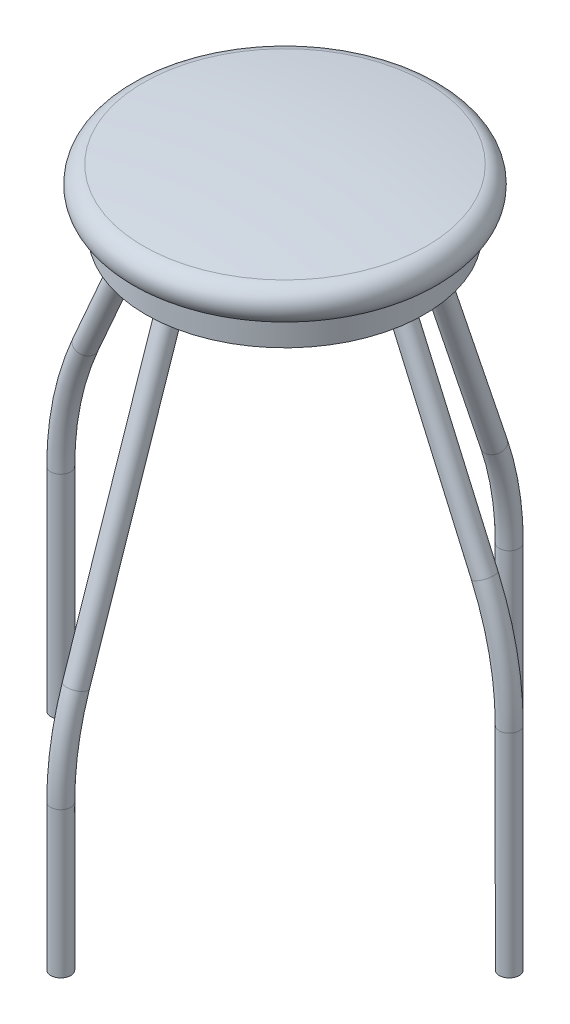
ISO-10303-21;
HEADER;
FILE_DESCRIPTION(('STEP AP214'),'2;1');
FILE_NAME('part.step','',(''),(''),'','','');
FILE_SCHEMA(('AUTOMOTIVE_DESIGN { 1 0 10303 214 1 1 1 1 }'));
ENDSEC;
DATA;
#1=APPLICATION_CONTEXT('core data for automotive mechanical design processes');
#2=APPLICATION_PROTOCOL_DEFINITION('international standard','automotive_design',2000,#1);
#3=PRODUCT_CONTEXT('',#1,'mechanical');
#4=PRODUCT('Part','Part','',(#3));
#5=PRODUCT_RELATED_PRODUCT_CATEGORY('part','',(#4));
#6=PRODUCT_DEFINITION_FORMATION('','',#4);
#7=PRODUCT_DEFINITION_CONTEXT('part definition',#1,'design');
#8=PRODUCT_DEFINITION('design','',#6,#7);
#9=PRODUCT_DEFINITION_SHAPE('','',#8);
#10=(LENGTH_UNIT() NAMED_UNIT(*) SI_UNIT(.MILLI.,.METRE.));
#11=(NAMED_UNIT(*) PLANE_ANGLE_UNIT() SI_UNIT($,.RADIAN.));
#12=(NAMED_UNIT(*) SI_UNIT($,.STERADIAN.) SOLID_ANGLE_UNIT());
#13=UNCERTAINTY_MEASURE_WITH_UNIT(LENGTH_MEASURE(1.E-05),#10,'distance_accuracy_value','');
#14=(GEOMETRIC_REPRESENTATION_CONTEXT(3) GLOBAL_UNCERTAINTY_ASSIGNED_CONTEXT((#13)) GLOBAL_UNIT_ASSIGNED_CONTEXT((#10,
#11,#12)) REPRESENTATION_CONTEXT('',''));
#15=CARTESIAN_POINT('',(0.,0.,0.));
#16=DIRECTION('',(0.,0.,1.));
#17=DIRECTION('',(1.,0.,0.));
#18=AXIS2_PLACEMENT_3D('',#15,#16,#17);
#19=CARTESIAN_POINT('',(-122.346245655,25.3999998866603,0.));
#20=DIRECTION('',(1.,0.,0.));
#21=DIRECTION('',(0.,1.,0.));
#22=AXIS2_PLACEMENT_3D('',#19,#20,#21);
#23=CYLINDRICAL_SURFACE('',#22,13.056189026);
#24=CARTESIAN_POINT('',(0.,25.3999999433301,0.));
#25=DIRECTION('',(0.707106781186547,0.,-0.707106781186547));
#26=DIRECTION('',(0.707106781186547,0.,0.707106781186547));
#27=AXIS2_PLACEMENT_3D('',#24,#25,#26);
#28=ELLIPSE('',#27,18.4642395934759,13.056189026);
#29=CARTESIAN_POINT('',(0.,12.3438109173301,0.));
#30=VERTEX_POINT('',#29);
#31=CARTESIAN_POINT('',(0.,38.4561889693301,0.));
#32=VERTEX_POINT('',#31);
#33=EDGE_CURVE('E112',#30,#32,#28,.F.);
#34=ORIENTED_EDGE('',*,*,#33,.F.);
#35=CARTESIAN_POINT('',(0.,25.3999999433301,0.));
#36=DIRECTION('',(0.707106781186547,0.,0.707106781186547));
#37=DIRECTION('',(0.707106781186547,0.,-0.707106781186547));
#38=AXIS2_PLACEMENT_3D('',#35,#36,#37);
#39=ELLIPSE('',#38,18.4642395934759,13.056189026);
#40=EDGE_CURVE('E55',#32,#30,#39,.F.);
#41=ORIENTED_EDGE('',*,*,#40,.F.);
#42=EDGE_LOOP('',(#34,#41));
#43=FACE_BOUND('',#42,.T.);
#44=CARTESIAN_POINT('',(122.346245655,25.3999998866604,0.));
#45=DIRECTION('',(1.,0.,0.));
#46=DIRECTION('',(0.,0.,1.));
#47=AXIS2_PLACEMENT_3D('',#44,#45,#46);
#48=CIRCLE('',#47,13.056189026);
#49=CARTESIAN_POINT('',(122.346245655,38.4561889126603,0.));
#50=VERTEX_POINT('',#49);
#51=EDGE_CURVE('E158',#50,#50,#48,.T.);
#52=ORIENTED_EDGE('',*,*,#51,.F.);
#53=EDGE_LOOP('',(#52));
#54=FACE_BOUND('',#53,.T.);
#55=ADVANCED_FACE('F36',(#43,#54),#23,.T.);
#56=CARTESIAN_POINT('',(-122.346245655,25.3999998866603,0.));
#57=DIRECTION('',(1.,0.,0.));
#58=DIRECTION('',(0.,1.,0.));
#59=AXIS2_PLACEMENT_3D('',#56,#57,#58);
#60=CYLINDRICAL_SURFACE('',#59,10.516189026);
#61=CARTESIAN_POINT('',(7.73781898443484,35.9161889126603,0.));
#62=CARTESIAN_POINT('',(7.73782399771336,35.9161868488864,-0.195682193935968));
#63=CARTESIAN_POINT('',(7.74527898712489,35.9107124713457,-0.391423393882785));
#64=CARTESIAN_POINT('',(7.77472738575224,35.888946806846,-0.781277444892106));
#65=CARTESIAN_POINT('',(7.79673005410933,35.8726486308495,-0.975389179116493));
#66=CARTESIAN_POINT('',(7.85426588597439,35.8295668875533,-1.36091211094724));
#67=CARTESIAN_POINT('',(7.88983369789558,35.8027564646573,-1.55231508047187));
#68=CARTESIAN_POINT('',(7.97294525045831,35.7391945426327,-1.93084233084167));
#69=CARTESIAN_POINT('',(8.02049326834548,35.7024394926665,-2.11796505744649));
#70=CARTESIAN_POINT('',(8.14446822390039,35.6048973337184,-2.55263951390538));
#71=CARTESIAN_POINT('',(8.22515767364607,35.5402097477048,-2.79810214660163));
#72=CARTESIAN_POINT('',(8.40092404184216,35.3950750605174,-3.27900433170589));
#73=CARTESIAN_POINT('',(8.49600757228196,35.3146207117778,-3.51443921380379));
#74=CARTESIAN_POINT('',(8.69691749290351,35.1388679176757,-3.97564106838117));
#75=CARTESIAN_POINT('',(8.80276879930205,35.0435347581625,-4.20138381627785));
#76=CARTESIAN_POINT('',(9.02176096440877,34.838981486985,-4.64273805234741));
#77=CARTESIAN_POINT('',(9.13490162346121,34.729761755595,-4.85834981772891));
#78=CARTESIAN_POINT('',(9.40895841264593,34.4546133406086,-5.35848818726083));
#79=CARTESIAN_POINT('',(9.57192218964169,34.2827491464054,-5.63864327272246));
#80=CARTESIAN_POINT('',(9.90087716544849,33.9145602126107,-6.18060144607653));
#81=CARTESIAN_POINT('',(10.0668694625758,33.7182264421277,-6.44239770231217));
#82=CARTESIAN_POINT('',(10.3970449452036,33.3016531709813,-6.94701694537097));
#83=CARTESIAN_POINT('',(10.5612295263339,33.0814337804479,-7.18985560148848));
#84=CARTESIAN_POINT('',(10.8837582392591,32.6171831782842,-7.65575427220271));
#85=CARTESIAN_POINT('',(11.0421043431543,32.3731601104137,-7.87882100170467));
#86=CARTESIAN_POINT('',(11.3184073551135,31.9126599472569,-8.26112932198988));
#87=CARTESIAN_POINT('',(11.4381135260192,31.7004184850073,-8.42421909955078));
#88=CARTESIAN_POINT('',(11.6693187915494,31.2611134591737,-8.73556125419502));
#89=CARTESIAN_POINT('',(11.7808194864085,31.0340528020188,-8.88381652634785));
#90=CARTESIAN_POINT('',(11.9934993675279,30.5658569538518,-9.16397754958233));
#91=CARTESIAN_POINT('',(12.094690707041,30.324738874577,-9.29590259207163));
#92=CARTESIAN_POINT('',(12.284881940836,29.8290157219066,-9.54204308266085));
#93=CARTESIAN_POINT('',(12.3738838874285,29.574412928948,-9.65626151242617));
#94=CARTESIAN_POINT('',(12.5243263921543,29.0956188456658,-9.84824119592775));
#95=CARTESIAN_POINT('',(12.5878940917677,28.873258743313,-9.92890992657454));
#96=CARTESIAN_POINT('',(12.7040163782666,28.4210119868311,-10.0757238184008));
#97=CARTESIAN_POINT('',(12.7565730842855,28.1911267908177,-10.1418717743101));
#98=CARTESIAN_POINT('',(12.8496755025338,27.7251531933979,-10.2587312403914));
#99=CARTESIAN_POINT('',(12.8902252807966,27.4890669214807,-10.3094479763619));
#100=CARTESIAN_POINT('',(12.9585135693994,27.0121473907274,-10.3947046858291));
#101=CARTESIAN_POINT('',(12.9862519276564,26.7713140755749,-10.4292444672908));
#102=CARTESIAN_POINT('',(13.02839383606,26.2857845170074,-10.4816721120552));
#103=CARTESIAN_POINT('',(13.0427486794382,26.0410774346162,-10.4994991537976));
#104=CARTESIAN_POINT('',(13.0576257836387,25.5505919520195,-10.5179741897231));
#105=CARTESIAN_POINT('',(13.0581480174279,25.3048135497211,-10.5186221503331));
#106=CARTESIAN_POINT('',(13.0453480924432,24.8141736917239,-10.5027276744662));
#107=CARTESIAN_POINT('',(13.0320256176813,24.5693122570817,-10.4861848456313));
#108=CARTESIAN_POINT('',(12.9918363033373,24.0824563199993,-10.436196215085));
#109=CARTESIAN_POINT('',(12.9649697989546,23.8404617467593,-10.4027508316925));
#110=CARTESIAN_POINT('',(12.9001773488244,23.3747596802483,-10.3218837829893));
#111=CARTESIAN_POINT('',(12.8629664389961,23.1507943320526,-10.2753641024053));
#112=CARTESIAN_POINT('',(12.7776894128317,22.7082487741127,-10.1684093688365));
#113=CARTESIAN_POINT('',(12.7296195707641,22.4896704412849,-10.1079695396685));
#114=CARTESIAN_POINT('',(12.6234664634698,22.0591443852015,-9.97395300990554));
#115=CARTESIAN_POINT('',(12.5653853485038,21.8471952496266,-9.90037913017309));
#116=CARTESIAN_POINT('',(12.44010025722,21.4307054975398,-9.74087726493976));
#117=CARTESIAN_POINT('',(12.3728929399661,21.2261676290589,-9.65494475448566));
#118=CARTESIAN_POINT('',(12.2236044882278,20.8063355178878,-9.46290972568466));
#119=CARTESIAN_POINT('',(12.1407182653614,20.5918474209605,-9.35566909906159));
#120=CARTESIAN_POINT('',(11.9664916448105,20.1732774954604,-9.1284379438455));
#121=CARTESIAN_POINT('',(11.8751477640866,19.9692000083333,-9.00844215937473));
#122=CARTESIAN_POINT('',(11.5903425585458,19.373262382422,-8.63074501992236));
#123=CARTESIAN_POINT('',(11.3860526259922,18.9975465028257,-8.35526400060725));
#124=CARTESIAN_POINT('',(11.0440702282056,18.431878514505,-7.88116932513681));
#125=CARTESIAN_POINT('',(10.9120748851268,18.2273219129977,-7.69536617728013));
#126=CARTESIAN_POINT('',(10.6436732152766,17.8347674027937,-7.30979699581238));
#127=CARTESIAN_POINT('',(10.5072661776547,17.6467721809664,-7.11002870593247));
#128=CARTESIAN_POINT('',(10.2323018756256,17.2873334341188,-6.69701041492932));
#129=CARTESIAN_POINT('',(10.0937421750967,17.1159105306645,-6.48374414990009));
#130=CARTESIAN_POINT('',(9.8172292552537,16.790022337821,-6.04428162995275));
#131=CARTESIAN_POINT('',(9.67927597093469,16.6355551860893,-5.81808679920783));
#132=CARTESIAN_POINT('',(9.41793963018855,16.3556575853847,-5.37157465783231));
#133=CARTESIAN_POINT('',(9.2942795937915,16.228889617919,-5.15225778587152));
#134=CARTESIAN_POINT('',(9.05269520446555,15.9903460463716,-4.70249394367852));
#135=CARTESIAN_POINT('',(8.93477161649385,15.8785724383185,-4.47204549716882));
#136=CARTESIAN_POINT('',(8.70820220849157,15.6709272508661,-4.00021354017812));
#137=CARTESIAN_POINT('',(8.59954092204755,15.5750288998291,-3.75884933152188));
#138=CARTESIAN_POINT('',(8.39535301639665,15.3999902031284,-3.26475857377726));
#139=CARTESIAN_POINT('',(8.29982001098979,15.320841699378,-3.01203762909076));
#140=CARTESIAN_POINT('',(8.1540456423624,15.2028713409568,-2.57726212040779));
#141=CARTESIAN_POINT('',(8.09903184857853,15.1592098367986,-2.39811377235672));
#142=CARTESIAN_POINT('',(7.999069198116,15.0809402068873,-2.03511367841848));
#143=CARTESIAN_POINT('',(7.95411700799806,15.0463290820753,-1.85126351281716));
#144=CARTESIAN_POINT('',(7.87597753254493,14.9867646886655,-1.47988370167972));
#145=CARTESIAN_POINT('',(7.84276807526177,14.9617932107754,-1.29236170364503));
#146=CARTESIAN_POINT('',(7.78941310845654,14.9219165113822,-0.914386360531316));
#147=CARTESIAN_POINT('',(7.76926727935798,14.9070110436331,-0.723933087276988));
#148=CARTESIAN_POINT('',(7.74291678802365,14.8875507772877,-0.340258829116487));
#149=CARTESIAN_POINT('',(7.73680472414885,14.8830647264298,-0.147027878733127));
#150=CARTESIAN_POINT('',(7.73910767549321,14.8847593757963,0.239294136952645));
#151=CARTESIAN_POINT('',(7.74752238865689,14.8909398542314,0.432385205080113));
#152=CARTESIAN_POINT('',(7.7784669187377,14.9138239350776,0.817011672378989));
#153=CARTESIAN_POINT('',(7.80101293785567,14.9305396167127,1.00854502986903));
#154=CARTESIAN_POINT('',(7.85915591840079,14.9741164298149,1.38843996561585));
#155=CARTESIAN_POINT('',(7.89475489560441,15.0009791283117,1.57680104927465));
#156=CARTESIAN_POINT('',(7.98741849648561,15.0719127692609,1.99390869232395));
#157=CARTESIAN_POINT('',(8.0475818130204,15.1185638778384,2.22152723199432));
#158=CARTESIAN_POINT('',(8.1824480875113,15.2255710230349,2.66912905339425));
#159=CARTESIAN_POINT('',(8.25715833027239,15.2859339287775,2.88910844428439));
#160=CARTESIAN_POINT('',(8.41813550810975,15.41951798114,3.32137245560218));
#161=CARTESIAN_POINT('',(8.50442974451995,15.492769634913,3.53363734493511));
#162=CARTESIAN_POINT('',(8.68561199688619,15.6512197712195,3.94982328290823));
#163=CARTESIAN_POINT('',(8.7805004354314,15.7364188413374,4.15374392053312));
#164=CARTESIAN_POINT('',(9.02351515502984,15.9618173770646,4.64936362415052));
#165=CARTESIAN_POINT('',(9.17532700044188,16.1087827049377,4.93619504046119));
#166=CARTESIAN_POINT('',(9.48615217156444,16.4263471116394,5.49239316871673));
#167=CARTESIAN_POINT('',(9.64516860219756,16.5969564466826,5.76175222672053));
#168=CARTESIAN_POINT('',(9.96554167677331,16.9613403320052,6.28335484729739));
#169=CARTESIAN_POINT('',(10.126900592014,17.1551388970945,6.53558023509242));
#170=CARTESIAN_POINT('',(10.4475558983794,17.5654323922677,7.02218160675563));
#171=CARTESIAN_POINT('',(10.6068526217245,17.7819236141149,7.25656049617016));
#172=CARTESIAN_POINT('',(10.9223744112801,18.2414497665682,7.71047894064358));
#173=CARTESIAN_POINT('',(11.0784977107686,18.4848812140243,7.92968908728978));
#174=CARTESIAN_POINT('',(11.3809887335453,18.9949177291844,8.34707890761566));
#175=CARTESIAN_POINT('',(11.527354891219,19.261526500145,8.54525520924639));
#176=CARTESIAN_POINT('',(11.8061545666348,19.8165442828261,8.91777167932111));
#177=CARTESIAN_POINT('',(11.9386248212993,20.1048921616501,9.09217508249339));
#178=CARTESIAN_POINT('',(12.1862448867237,20.7027633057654,9.41495818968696));
#179=CARTESIAN_POINT('',(12.3014043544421,21.0122746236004,9.56335241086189));
#180=CARTESIAN_POINT('',(12.4771024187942,21.5479791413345,9.78812755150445));
#181=CARTESIAN_POINT('',(12.5433145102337,21.7690630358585,9.87234168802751));
#182=CARTESIAN_POINT('',(12.6649107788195,22.2190601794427,10.0263835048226));
#183=CARTESIAN_POINT('',(12.720297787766,22.4479713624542,10.0962149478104));
#184=CARTESIAN_POINT('',(12.8191962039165,22.9123104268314,10.2205366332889));
#185=CARTESIAN_POINT('',(12.862713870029,23.1477348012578,10.2750349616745));
#186=CARTESIAN_POINT('',(12.9370393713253,23.6237393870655,10.367927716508));
#187=CARTESIAN_POINT('',(12.967846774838,23.8643197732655,10.4063215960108));
#188=CARTESIAN_POINT('',(13.0161859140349,24.3498856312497,10.4664979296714));
#189=CARTESIAN_POINT('',(13.0336631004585,24.5948850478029,10.4882121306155));
#190=CARTESIAN_POINT('',(13.054739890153,25.0864027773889,10.5143927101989));
#191=CARTESIAN_POINT('',(13.0583395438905,25.3329210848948,10.5188591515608));
#192=CARTESIAN_POINT('',(13.0515788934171,25.8254735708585,10.5104651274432));
#193=CARTESIAN_POINT('',(13.0412182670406,26.0715077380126,10.497604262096));
#194=CARTESIAN_POINT('',(13.0067725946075,26.5611023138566,10.4547814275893));
#195=CARTESIAN_POINT('',(12.9826879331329,26.8046627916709,10.4248199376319));
#196=CARTESIAN_POINT('',(12.9231847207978,27.2728763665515,10.3506193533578));
#197=CARTESIAN_POINT('',(12.8885380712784,27.497783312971,10.3073512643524));
#198=CARTESIAN_POINT('',(12.8082333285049,27.9424997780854,10.2067584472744));
#199=CARTESIAN_POINT('',(12.762571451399,28.1623075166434,10.1494288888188));
#200=CARTESIAN_POINT('',(12.6610479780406,28.5955329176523,10.0214675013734));
#201=CARTESIAN_POINT('',(12.6051885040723,28.8089518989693,9.95083844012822));
#202=CARTESIAN_POINT('',(12.4841411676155,29.2285769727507,9.79705003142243));
#203=CARTESIAN_POINT('',(12.4189498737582,29.4347803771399,9.71388607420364));
#204=CARTESIAN_POINT('',(12.2742605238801,29.8565083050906,9.52823694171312));
#205=CARTESIAN_POINT('',(12.1940149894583,30.0713156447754,9.4247064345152));
#206=CARTESIAN_POINT('',(12.0249109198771,30.4908519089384,9.20486701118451));
#207=CARTESIAN_POINT('',(11.9360488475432,30.6955766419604,9.08855284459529));
#208=CARTESIAN_POINT('',(11.7510077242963,31.0944023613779,8.8441347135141));
#209=CARTESIAN_POINT('',(11.6548282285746,31.288502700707,8.71603003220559));
#210=CARTESIAN_POINT('',(11.4564149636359,31.6657856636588,8.44888171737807));
#211=CARTESIAN_POINT('',(11.354180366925,31.8489667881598,8.30983658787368));
#212=CARTESIAN_POINT('',(11.1237052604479,32.2402275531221,7.99232234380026));
#213=CARTESIAN_POINT('',(10.9943931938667,32.4458299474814,7.81157420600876));
#214=CARTESIAN_POINT('',(10.731019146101,32.8408103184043,7.43631659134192));
#215=CARTESIAN_POINT('',(10.5969564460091,33.0301858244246,7.2418050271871));
#216=CARTESIAN_POINT('',(10.3261775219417,33.3928341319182,6.8394650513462));
#217=CARTESIAN_POINT('',(10.1894580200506,33.5660852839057,6.63161935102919));
#218=CARTESIAN_POINT('',(9.91599364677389,33.8960604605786,6.20324793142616));
#219=CARTESIAN_POINT('',(9.77924877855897,34.0527858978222,5.98272329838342));
#220=CARTESIAN_POINT('',(9.51378134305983,34.3436722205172,5.5379404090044));
#221=CARTESIAN_POINT('',(9.38495414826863,34.4784757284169,5.31416517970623));
#222=CARTESIAN_POINT('',(9.13268206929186,34.7322123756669,4.8547817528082));
#223=CARTESIAN_POINT('',(9.00923811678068,34.8511427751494,4.61917152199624));
#224=CARTESIAN_POINT('',(8.77144010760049,35.072240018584,4.13623529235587));
#225=CARTESIAN_POINT('',(8.657073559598,35.1744301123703,3.88892616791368));
#226=CARTESIAN_POINT('',(8.44159048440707,35.3611209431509,3.38217706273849));
#227=CARTESIAN_POINT('',(8.34046660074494,35.445631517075,3.12274392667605));
#228=CARTESIAN_POINT('',(8.18601700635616,35.5715156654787,2.67688031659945));
#229=CARTESIAN_POINT('',(8.12774313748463,35.6180442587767,2.49361183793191));
#230=CARTESIAN_POINT('',(8.02153960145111,35.7016281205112,2.12200975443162));
#231=CARTESIAN_POINT('',(7.97360620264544,35.7386868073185,1.93367800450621));
#232=CARTESIAN_POINT('',(7.88999471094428,35.8026355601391,1.55322089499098));
#233=CARTESIAN_POINT('',(7.85427903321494,35.8295568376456,1.36110912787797));
#234=CARTESIAN_POINT('',(7.79649956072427,35.872821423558,0.973735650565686));
#235=CARTESIAN_POINT('',(7.7744265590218,35.8891718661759,0.778476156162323));
#236=CARTESIAN_POINT('',(7.75244002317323,35.9054182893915,0.485624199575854));
#237=CARTESIAN_POINT('',(7.74696534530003,35.9094538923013,0.388639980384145));
#238=CARTESIAN_POINT('',(7.73965323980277,35.914839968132,0.194442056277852));
#239=CARTESIAN_POINT('',(7.73781649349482,35.9161899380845,0.0972283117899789));
#240=CARTESIAN_POINT('',(7.73781898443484,35.9161889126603,0.));
#241=B_SPLINE_CURVE_WITH_KNOTS('',3,(#61,#62,#63,#64,#65,#66,#67,#68,#69,#70,#71,#72,#73,#74,
#75,#76,#77,#78,#79,#80,#81,#82,#83,#84,#85,#86,#87,#88,#89,#90,#91,#92,#93,#94,#95,#96,#97,#98,
#99,#100,#101,#102,#103,#104,#105,#106,#107,#108,#109,#110,#111,#112,#113,#114,#115,#116,#117,
#118,#119,#120,#121,#122,#123,#124,#125,#126,#127,#128,#129,#130,#131,#132,#133,#134,#135,#136,
#137,#138,#139,#140,#141,#142,#143,#144,#145,#146,#147,#148,#149,#150,#151,#152,#153,#154,#155,
#156,#157,#158,#159,#160,#161,#162,#163,#164,#165,#166,#167,#168,#169,#170,#171,#172,#173,#174,
#175,#176,#177,#178,#179,#180,#181,#182,#183,#184,#185,#186,#187,#188,#189,#190,#191,#192,#193,
#194,#195,#196,#197,#198,#199,#200,#201,#202,#203,#204,#205,#206,#207,#208,#209,#210,#211,#212,
#213,#214,#215,#216,#217,#218,#219,#220,#221,#222,#223,#224,#225,#226,#227,#228,#229,#230,#231,
#232,#233,#234,#235,#236,#237,#238,#239,#240),.UNSPECIFIED.,.T.,.F.,(4,2,2,2,2,2,2,2,2,2,2,2,2,
2,2,2,2,2,2,2,2,2,2,2,2,2,2,2,2,2,2,2,2,2,2,2,2,2,2,2,2,2,2,2,2,2,2,2,2,2,2,2,2,2,2,2,2,2,2,2,2,
2,2,2,2,2,2,2,2,2,2,2,2,2,2,2,2,2,2,2,2,2,2,2,2,2,2,2,2,4),(0.,0.586935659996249,
1.17424524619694,1.76306510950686,2.35209549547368,3.14989979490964,3.94807168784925,
4.74813445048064,5.54817530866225,6.64731670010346,7.74686495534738,8.84549454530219,
9.94374957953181,10.8226061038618,11.701290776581,12.5789273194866,13.4564159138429,
14.1904789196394,14.9244005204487,15.6580733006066,16.3917547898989,17.1280960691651,
17.8644387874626,18.6007983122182,19.3371396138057,20.0316472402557,20.7263935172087,
21.4209907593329,22.1158429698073,22.8762602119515,23.6369920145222,25.1579354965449,
26.0760459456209,26.9943050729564,27.9136925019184,28.832978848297,29.678028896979,
30.5231913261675,31.3669136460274,32.2102240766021,32.7870380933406,33.3636607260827,
33.9391887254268,34.5147026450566,35.0940031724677,35.6732916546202,36.2532455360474,
36.8332890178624,37.552205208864,38.2714823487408,38.9924854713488,39.7135240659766,
40.7807812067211,41.8485027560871,42.917339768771,43.9860023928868,45.0732710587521,
46.1607137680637,47.2452050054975,48.329088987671,49.0654028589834,49.8015238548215,
50.5372559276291,51.2730129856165,52.0117649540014,52.7505142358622,53.4892805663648,
54.2280261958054,54.9221790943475,55.6165707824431,56.3108181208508,57.0053213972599,
57.7593848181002,58.5137591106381,59.2681792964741,60.0227028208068,60.9301340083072,
61.8377031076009,62.7464736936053,63.6551665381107,64.5283337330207,65.4016514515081,
66.2737457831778,67.1453535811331,67.7384512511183,68.3313345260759,68.9223771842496,
69.5130205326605,69.8045957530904,70.0962255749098),.UNSPECIFIED.);
#242=CARTESIAN_POINT('',(7.73781898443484,35.9161889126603,0.));
#243=VERTEX_POINT('',#242);
#244=EDGE_CURVE('E211',#243,#243,#241,.T.);
#245=ORIENTED_EDGE('',*,*,#244,.T.);
#246=EDGE_LOOP('',(#245));
#247=FACE_BOUND('',#246,.T.);
#248=CARTESIAN_POINT('',(122.346245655,25.3999998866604,0.));
#249=DIRECTION('',(1.,0.,0.));
#250=DIRECTION('',(0.,0.,1.));
#251=AXIS2_PLACEMENT_3D('',#248,#249,#250);
#252=CIRCLE('',#251,10.516189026);
#253=CARTESIAN_POINT('',(122.346245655,35.9161889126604,0.));
#254=VERTEX_POINT('',#253);
#255=EDGE_CURVE('E161',#254,#254,#252,.T.);
#256=ORIENTED_EDGE('',*,*,#255,.T.);
#257=EDGE_LOOP('',(#256));
#258=FACE_BOUND('',#257,.T.);
#259=ADVANCED_FACE('F259',(#247,#258),#60,.F.);
#260=CARTESIAN_POINT('',(0.,0.,0.));
#261=DIRECTION('',(0.,-1.,0.));
#262=DIRECTION('',(0.,0.,-1.));
#263=AXIS2_PLACEMENT_3D('',#260,#261,#262);
#264=PLANE('',#263);
#265=CARTESIAN_POINT('',(0.,0.,-149.133549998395));
#266=DIRECTION('',(0.,-1.,0.));
#267=DIRECTION('',(0.,0.,-1.));
#268=AXIS2_PLACEMENT_3D('',#265,#266,#267);
#269=ELLIPSE('',#268,13.7692955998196,13.056189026);
#270=CARTESIAN_POINT('',(-4.44148717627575,0.,-162.081636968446));
#271=VERTEX_POINT('',#270);
#272=CARTESIAN_POINT('',(4.44148717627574,0.,-162.081636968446));
#273=VERTEX_POINT('',#272);
#274=EDGE_CURVE('E111',#271,#273,#269,.T.);
#275=ORIENTED_EDGE('',*,*,#274,.F.);
#276=CARTESIAN_POINT('',(0.,0.,0.));
#277=DIRECTION('',(0.,-1.,0.));
#278=DIRECTION('',(0.,0.,-1.));
#279=AXIS2_PLACEMENT_3D('',#276,#277,#278);
#280=CIRCLE('',#279,162.142480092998);
#281=CARTESIAN_POINT('',(-161.983104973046,0.,-7.18731897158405));
#282=VERTEX_POINT('',#281);
#283=EDGE_CURVE('E121',#282,#271,#280,.T.);
#284=ORIENTED_EDGE('',*,*,#283,.F.);
#285=CARTESIAN_POINT('',(-150.081249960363,0.,0.));
#286=DIRECTION('',(0.,-1.,0.));
#287=DIRECTION('',(1.,0.,0.));
#288=AXIS2_PLACEMENT_3D('',#285,#286,#287);
#289=ELLIPSE('',#288,14.2564354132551,13.056189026);
#290=CARTESIAN_POINT('',(-161.983104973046,0.,7.18731897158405));
#291=VERTEX_POINT('',#290);
#292=EDGE_CURVE('E129',#291,#282,#289,.T.);
#293=ORIENTED_EDGE('',*,*,#292,.F.);
#294=CARTESIAN_POINT('',(-4.44148717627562,0.,162.081636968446));
#295=VERTEX_POINT('',#294);
#296=EDGE_CURVE('E110',#295,#291,#280,.T.);
#297=ORIENTED_EDGE('',*,*,#296,.F.);
#298=CARTESIAN_POINT('',(0.,0.,149.133549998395));
#299=DIRECTION('',(0.,-1.,0.));
#300=DIRECTION('',(0.,0.,-1.));
#301=AXIS2_PLACEMENT_3D('',#298,#299,#300);
#302=ELLIPSE('',#301,13.7692955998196,13.056189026);
#303=CARTESIAN_POINT('',(4.44148717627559,0.,162.081636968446));
#304=VERTEX_POINT('',#303);
#305=EDGE_CURVE('E98',#304,#295,#302,.T.);
#306=ORIENTED_EDGE('',*,*,#305,.F.);
#307=CARTESIAN_POINT('',(161.983104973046,0.,7.18731897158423));
#308=VERTEX_POINT('',#307);
#309=EDGE_CURVE('E108',#308,#304,#280,.T.);
#310=ORIENTED_EDGE('',*,*,#309,.F.);
#311=CARTESIAN_POINT('',(150.081249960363,0.,0.));
#312=DIRECTION('',(0.,-1.,0.));
#313=DIRECTION('',(1.,0.,0.));
#314=AXIS2_PLACEMENT_3D('',#311,#312,#313);
#315=ELLIPSE('',#314,14.2564354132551,13.056189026);
#316=CARTESIAN_POINT('',(161.983104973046,0.,-7.18731897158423));
#317=VERTEX_POINT('',#316);
#318=EDGE_CURVE('E127',#317,#308,#315,.T.);
#319=ORIENTED_EDGE('',*,*,#318,.F.);
#320=EDGE_CURVE('E122',#273,#317,#280,.T.);
#321=ORIENTED_EDGE('',*,*,#320,.F.);
#322=EDGE_LOOP('',(#275,#284,#293,#297,#306,#310,#319,#321));
#323=FACE_BOUND('',#322,.T.);
#324=CARTESIAN_POINT('',(0.,0.,0.));
#325=DIRECTION('',(0.,-1.,0.));
#326=DIRECTION('',(0.,0.,-1.));
#327=AXIS2_PLACEMENT_3D('',#324,#325,#326);
#328=CIRCLE('',#327,183.638340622);
#329=CARTESIAN_POINT('',(0.,0.,-183.638340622));
#330=VERTEX_POINT('',#329);
#331=EDGE_CURVE('E283',#330,#330,#328,.T.);
#332=ORIENTED_EDGE('',*,*,#331,.T.);
#333=EDGE_LOOP('',(#332));
#334=FACE_BOUND('',#333,.T.);
#335=ADVANCED_FACE('F38',(#323,#334),#264,.T.);
#336=CARTESIAN_POINT('',(0.,0.,0.));
#337=DIRECTION('',(0.,-1.,0.));
#338=DIRECTION('',(0.,0.,-1.));
#339=AXIS2_PLACEMENT_3D('',#336,#337,#338);
#340=CYLINDRICAL_SURFACE('',#339,183.638340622);
#341=CARTESIAN_POINT('',(0.,34.5698793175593,0.));
#342=DIRECTION('',(0.,-1.,0.));
#343=DIRECTION('',(0.,0.,-1.));
#344=AXIS2_PLACEMENT_3D('',#341,#342,#343);
#345=CIRCLE('',#344,183.638340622);
#346=CARTESIAN_POINT('',(0.,34.5698793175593,-183.638340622));
#347=VERTEX_POINT('',#346);
#348=EDGE_CURVE('E983',#347,#347,#345,.T.);
#349=ORIENTED_EDGE('',*,*,#348,.T.);
#350=EDGE_LOOP('',(#349));
#351=FACE_BOUND('',#350,.T.);
#352=ORIENTED_EDGE('',*,*,#331,.F.);
#353=EDGE_LOOP('',(#352));
#354=FACE_BOUND('',#353,.T.);
#355=ADVANCED_FACE('F306',(#351,#354),#340,.T.);
#356=CARTESIAN_POINT('',(0.,57.2033806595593,0.));
#357=DIRECTION('',(0.,-1.,0.));
#358=DIRECTION('',(0.,0.,-1.));
#359=AXIS2_PLACEMENT_3D('',#356,#357,#358);
#360=TOROIDAL_SURFACE('',#359,183.638340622,22.633501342);
#361=CARTESIAN_POINT('',(0.,79.6333054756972,0.));
#362=DIRECTION('',(0.,-1.,0.));
#363=DIRECTION('',(0.,0.,-1.));
#364=AXIS2_PLACEMENT_3D('',#361,#362,#363);
#365=CIRCLE('',#364,186.667177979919);
#366=CARTESIAN_POINT('',(0.,79.6333054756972,-186.667177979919));
#367=VERTEX_POINT('',#366);
#368=EDGE_CURVE('E124',#367,#367,#365,.T.);
#369=ORIENTED_EDGE('',*,*,#368,.T.);
#370=EDGE_LOOP('',(#369));
#371=FACE_BOUND('',#370,.T.);
#372=ORIENTED_EDGE('',*,*,#348,.F.);
#373=EDGE_LOOP('',(#372));
#374=FACE_BOUND('',#373,.T.);
#375=ADVANCED_FACE('F303',(#371,#374),#360,.T.);
#376=CARTESIAN_POINT('',(1.70820606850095E-13,-1302.722454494,0.));
#377=DIRECTION('',(0.,-1.,0.));
#378=DIRECTION('',(1.,0.,0.));
#379=AXIS2_PLACEMENT_3D('',#376,#377,#378);
#380=SPHERICAL_SURFACE('',#379,1394.902176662);
#381=ORIENTED_EDGE('',*,*,#368,.F.);
#382=EDGE_LOOP('',(#381));
#383=FACE_BOUND('',#382,.T.);
#384=ADVANCED_FACE('F295',(#383),#380,.T.);
#385=CARTESIAN_POINT('',(0.,43.18,0.));
#386=DIRECTION('',(0.,-1.,0.));
#387=DIRECTION('',(0.,0.,-1.));
#388=AXIS2_PLACEMENT_3D('',#385,#386,#387);
#389=CYLINDRICAL_SURFACE('',#388,162.142480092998);
#390=CARTESIAN_POINT('',(0.,43.18,0.));
#391=DIRECTION('',(0.,-1.,0.));
#392=DIRECTION('',(0.,0.,-1.));
#393=AXIS2_PLACEMENT_3D('',#390,#391,#392);
#394=CIRCLE('',#393,162.142480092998);
#395=CARTESIAN_POINT('',(0.,43.18,-162.142480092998));
#396=VERTEX_POINT('',#395);
#397=EDGE_CURVE('E119',#396,#396,#394,.T.);
#398=ORIENTED_EDGE('',*,*,#397,.F.);
#399=EDGE_LOOP('',(#398));
#400=FACE_BOUND('',#399,.T.);
#401=ORIENTED_EDGE('',*,*,#283,.T.);
#402=CARTESIAN_POINT('',(0.,2.26980123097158,-162.142480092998));
#403=CARTESIAN_POINT('',(0.142764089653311,2.26980992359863,-162.142480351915));
#404=CARTESIAN_POINT('',(0.285490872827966,2.26297771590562,-162.142291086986));
#405=CARTESIAN_POINT('',(0.569708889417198,2.23589125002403,-162.141541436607));
#406=CARTESIAN_POINT('',(0.711199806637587,2.21563365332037,-162.140980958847));
#407=CARTESIAN_POINT('',(0.991884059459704,2.16228628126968,-162.139507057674));
#408=CARTESIAN_POINT('',(1.13107460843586,2.12918198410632,-162.138593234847));
#409=CARTESIAN_POINT('',(1.40612876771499,2.05107341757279,-162.136441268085));
#410=CARTESIAN_POINT('',(1.5419904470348,2.00606241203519,-162.135202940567));
#411=CARTESIAN_POINT('',(1.84192217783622,1.89310700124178,-162.132102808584));
#412=CARTESIAN_POINT('',(2.00489456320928,1.82224976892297,-162.130162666));
#413=CARTESIAN_POINT('',(2.32387668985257,1.66616222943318,-162.12590457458));
#414=CARTESIAN_POINT('',(2.47988091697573,1.58092078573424,-162.123586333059));
#415=CARTESIAN_POINT('',(2.78475328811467,1.39814075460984,-162.118636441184));
#416=CARTESIAN_POINT('',(2.93361125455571,1.30058530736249,-162.116004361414));
#417=CARTESIAN_POINT('',(3.22397108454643,1.09523319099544,-162.110489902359));
#418=CARTESIAN_POINT('',(3.36547457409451,0.987438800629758,-162.107607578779));
#419=CARTESIAN_POINT('',(3.73754547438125,0.685171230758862,-162.099566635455));
#420=CARTESIAN_POINT('',(3.96154039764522,0.482595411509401,-162.094220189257));
#421=CARTESIAN_POINT('',(4.39126159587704,0.0589132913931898,-162.083148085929));
#422=CARTESIAN_POINT('',(4.59697380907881,-0.162207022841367,-162.077422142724));
#423=CARTESIAN_POINT('',(4.9925562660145,-0.618959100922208,-162.065719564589));
#424=CARTESIAN_POINT('',(5.18239002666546,-0.854622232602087,-162.05974239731));
#425=CARTESIAN_POINT('',(5.54757145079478,-1.33672338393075,-162.047652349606));
#426=CARTESIAN_POINT('',(5.72292302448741,-1.58315846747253,-162.041539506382));
#427=CARTESIAN_POINT('',(6.12335993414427,-2.17717831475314,-162.026979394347));
#428=CARTESIAN_POINT('',(6.34288910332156,-2.52850015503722,-162.018503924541));
#429=CARTESIAN_POINT('',(6.76176009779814,-3.24305903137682,-162.001562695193));
#430=CARTESIAN_POINT('',(6.9610929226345,-3.60630128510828,-161.993096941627));
#431=CARTESIAN_POINT('',(7.34261053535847,-4.34240409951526,-161.97625264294));
#432=CARTESIAN_POINT('',(7.52476621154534,-4.71527967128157,-161.967874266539));
#433=CARTESIAN_POINT('',(7.87377016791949,-5.4680239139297,-161.951283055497));
#434=CARTESIAN_POINT('',(8.04062070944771,-5.84789154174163,-161.94307019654));
#435=CARTESIAN_POINT('',(8.36153628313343,-6.61490886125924,-161.926818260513));
#436=CARTESIAN_POINT('',(8.5155426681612,-7.00208300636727,-161.918780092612));
#437=CARTESIAN_POINT('',(8.81143202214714,-7.78103375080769,-161.902947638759));
#438=CARTESIAN_POINT('',(8.95331471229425,-8.17281045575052,-161.895153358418));
#439=CARTESIAN_POINT('',(9.22602650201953,-8.95976257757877,-161.879840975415));
#440=CARTESIAN_POINT('',(9.35686613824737,-9.35493434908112,-161.872322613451));
#441=CARTESIAN_POINT('',(9.60863707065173,-10.1484209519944,-161.857572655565));
#442=CARTESIAN_POINT('',(9.72956823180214,-10.5467358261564,-161.850341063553));
#443=CARTESIAN_POINT('',(10.0184538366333,-11.5385883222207,-161.832766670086));
#444=CARTESIAN_POINT('',(10.1809876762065,-12.1337106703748,-161.822603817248));
#445=CARTESIAN_POINT('',(10.4883634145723,-13.3285473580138,-161.802972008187));
#446=CARTESIAN_POINT('',(10.6332035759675,-13.9282621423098,-161.793503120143));
#447=CARTESIAN_POINT('',(10.9069642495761,-15.1315464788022,-161.775278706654));
#448=CARTESIAN_POINT('',(11.0358788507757,-15.7351173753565,-161.766523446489));
#449=CARTESIAN_POINT('',(11.2791245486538,-16.9451693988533,-161.749745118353));
#450=CARTESIAN_POINT('',(11.393456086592,-17.5516504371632,-161.741722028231));
#451=CARTESIAN_POINT('',(11.6088930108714,-18.7681727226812,-161.726402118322));
#452=CARTESIAN_POINT('',(11.7099723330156,-19.3782185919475,-161.71910673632));
#453=CARTESIAN_POINT('',(11.8995814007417,-20.6002571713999,-161.70526521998));
#454=CARTESIAN_POINT('',(11.9881110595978,-21.21224989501,-161.698719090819));
#455=CARTESIAN_POINT('',(12.2360533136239,-23.0503757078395,-161.680211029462));
#456=CARTESIAN_POINT('',(12.3778658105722,-24.2789242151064,-161.669376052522));
#457=CARTESIAN_POINT('',(12.6198335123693,-26.7454220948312,-161.650667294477));
#458=CARTESIAN_POINT('',(12.7198056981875,-27.9833891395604,-161.642806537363));
#459=CARTESIAN_POINT('',(12.8804852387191,-30.4619132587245,-161.630082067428));
#460=CARTESIAN_POINT('',(12.9411910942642,-31.7024704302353,-161.625218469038));
#461=CARTESIAN_POINT('',(13.0254463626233,-34.1829456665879,-161.618449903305));
#462=CARTESIAN_POINT('',(13.0490521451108,-35.4228618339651,-161.616540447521));
#463=CARTESIAN_POINT('',(13.0605501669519,-37.902829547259,-161.61561152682));
#464=CARTESIAN_POINT('',(13.0484429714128,-39.142881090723,-161.616592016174));
#465=CARTESIAN_POINT('',(12.9863901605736,-41.731076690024,-161.621590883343));
#466=CARTESIAN_POINT('',(12.9332131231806,-43.0791440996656,-161.62586863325));
#467=CARTESIAN_POINT('',(12.7847467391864,-45.7730170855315,-161.637680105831));
#468=CARTESIAN_POINT('',(12.6894550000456,-47.1188225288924,-161.645214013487));
#469=CARTESIAN_POINT('',(12.4548387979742,-49.810385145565,-161.663461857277));
#470=CARTESIAN_POINT('',(12.3153932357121,-51.1561318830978,-161.674184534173));
#471=CARTESIAN_POINT('',(12.0709261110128,-53.1703192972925,-161.692557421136));
#472=CARTESIAN_POINT('',(11.9835586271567,-53.8409464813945,-161.699062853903));
#473=CARTESIAN_POINT('',(11.7964649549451,-55.1804618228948,-161.712819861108));
#474=CARTESIAN_POINT('',(11.6967390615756,-55.8493500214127,-161.720071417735));
#475=CARTESIAN_POINT('',(11.4844963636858,-57.183275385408,-161.735282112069));
#476=CARTESIAN_POINT('',(11.3720140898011,-57.8483180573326,-161.743239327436));
#477=CARTESIAN_POINT('',(11.1331431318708,-59.1759069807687,-161.759856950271));
#478=CARTESIAN_POINT('',(11.0067543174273,-59.8384532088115,-161.768517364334));
#479=CARTESIAN_POINT('',(10.7388509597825,-61.1609051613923,-161.786522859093));
#480=CARTESIAN_POINT('',(10.5973271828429,-61.8208090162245,-161.795868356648));
#481=CARTESIAN_POINT('',(10.2977685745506,-63.1368455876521,-161.815210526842));
#482=CARTESIAN_POINT('',(10.1397341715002,-63.7929784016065,-161.825207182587));
#483=CARTESIAN_POINT('',(9.80606041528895,-65.097501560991,-161.845768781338));
#484=CARTESIAN_POINT('',(9.63050676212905,-65.7459137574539,-161.856330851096));
#485=CARTESIAN_POINT('',(9.25874397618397,-67.0368856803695,-161.878022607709));
#486=CARTESIAN_POINT('',(9.06253245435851,-67.6794447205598,-161.889152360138));
#487=CARTESIAN_POINT('',(8.64647978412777,-68.9561289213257,-161.911907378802));
#488=CARTESIAN_POINT('',(8.42666618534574,-69.5902629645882,-161.923532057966));
#489=CARTESIAN_POINT('',(8.07577585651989,-70.5334730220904,-161.941283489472));
#490=CARTESIAN_POINT('',(7.95529868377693,-70.8465101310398,-161.947252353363));
#491=CARTESIAN_POINT('',(7.70653795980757,-71.4694581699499,-161.959280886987));
#492=CARTESIAN_POINT('',(7.57825487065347,-71.7793692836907,-161.96534055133));
#493=CARTESIAN_POINT('',(7.32682948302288,-72.3633739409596,-161.976898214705));
#494=CARTESIAN_POINT('',(7.20454356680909,-72.6378358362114,-161.982388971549));
#495=CARTESIAN_POINT('',(6.95224965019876,-73.1832089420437,-161.99341353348));
#496=CARTESIAN_POINT('',(6.82224139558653,-73.4541200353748,-161.998947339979));
#497=CARTESIAN_POINT('',(6.55334791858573,-73.9921554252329,-162.010047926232));
#498=CARTESIAN_POINT('',(6.41444636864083,-74.2592715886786,-162.01561474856));
#499=CARTESIAN_POINT('',(6.12688927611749,-74.7882048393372,-162.02674406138));
#500=CARTESIAN_POINT('',(5.97823429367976,-75.0500222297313,-162.032306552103));
#501=CARTESIAN_POINT('',(5.67182469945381,-75.5636830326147,-162.043319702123));
#502=CARTESIAN_POINT('',(5.51421428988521,-75.8156120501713,-162.048770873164));
#503=CARTESIAN_POINT('',(5.18651716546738,-76.3113852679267,-162.059590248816));
#504=CARTESIAN_POINT('',(5.01642687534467,-76.5552271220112,-162.064958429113));
#505=CARTESIAN_POINT('',(4.66240547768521,-77.0315520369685,-162.075529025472));
#506=CARTESIAN_POINT('',(4.4785185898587,-77.26406775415,-162.080731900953));
#507=CARTESIAN_POINT('',(4.09421849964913,-77.7149089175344,-162.090894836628));
#508=CARTESIAN_POINT('',(3.89381976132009,-77.9332464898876,-162.095855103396));
#509=CARTESIAN_POINT('',(3.57035113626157,-78.2546661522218,-162.103205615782));
#510=CARTESIAN_POINT('',(3.454074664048,-78.364597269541,-162.105729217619));
#511=CARTESIAN_POINT('',(3.2154392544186,-78.5777243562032,-162.110638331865));
#512=CARTESIAN_POINT('',(3.09307953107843,-78.6809194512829,-162.113023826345));
#513=CARTESIAN_POINT('',(2.84190474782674,-78.8791982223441,-162.117621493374));
#514=CARTESIAN_POINT('',(2.71308964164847,-78.9742818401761,-162.119833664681));
#515=CARTESIAN_POINT('',(2.44879383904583,-79.1546318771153,-162.124041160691));
#516=CARTESIAN_POINT('',(2.31331465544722,-79.2399005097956,-162.126036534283));
#517=CARTESIAN_POINT('',(1.95439404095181,-79.4451196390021,-162.130850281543));
#518=CARTESIAN_POINT('',(1.72576202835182,-79.5562675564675,-162.133469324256));
#519=CARTESIAN_POINT('',(1.25328674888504,-79.7399188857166,-162.137807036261));
#520=CARTESIAN_POINT('',(1.00946545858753,-79.8124767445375,-162.13952697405));
#521=CARTESIAN_POINT('',(0.635632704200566,-79.8864966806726,-162.141283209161));
#522=CARTESIAN_POINT('',(0.508937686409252,-79.9053731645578,-162.14173149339));
#523=CARTESIAN_POINT('',(0.254327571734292,-79.9305886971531,-162.142330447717));
#524=CARTESIAN_POINT('',(0.126413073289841,-79.9369336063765,-162.14248125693));
#525=CARTESIAN_POINT('',(-0.129420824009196,-79.9368350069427,-162.142478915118));
#526=CARTESIAN_POINT('',(-0.257340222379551,-79.9303904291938,-162.142325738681));
#527=CARTESIAN_POINT('',(-0.511888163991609,-79.9049782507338,-162.141722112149));
#528=CARTESIAN_POINT('',(-0.638516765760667,-79.8860112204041,-162.141271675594));
#529=CARTESIAN_POINT('',(-0.979187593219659,-79.8183232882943,-162.139665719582));
#530=CARTESIAN_POINT('',(-1.19100159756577,-79.7580249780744,-162.138236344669));
#531=CARTESIAN_POINT('',(-1.6035016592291,-79.6076911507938,-162.134682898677));
#532=CARTESIAN_POINT('',(-1.80418225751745,-79.5176411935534,-162.132558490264));
#533=CARTESIAN_POINT('',(-2.32502397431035,-79.2444927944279,-162.126138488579));
#534=CARTESIAN_POINT('',(-2.63383499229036,-79.0397226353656,-162.121347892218));
#535=CARTESIAN_POINT('',(-3.07087429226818,-78.6999376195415,-162.113463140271));
#536=CARTESIAN_POINT('',(-3.21244786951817,-78.5809668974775,-162.110712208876));
#537=CARTESIAN_POINT('',(-3.48756321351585,-78.3340516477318,-162.105026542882));
#538=CARTESIAN_POINT('',(-3.62110659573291,-78.2061089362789,-162.102091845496));
#539=CARTESIAN_POINT('',(-4.00570168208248,-77.8164313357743,-162.093193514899));
#540=CARTESIAN_POINT('',(-4.2462521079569,-77.5443578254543,-162.087031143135));
#541=CARTESIAN_POINT('',(-4.70383229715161,-76.9810390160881,-162.074396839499));
#542=CARTESIAN_POINT('',(-4.92083754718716,-76.689774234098,-162.067924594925));
#543=CARTESIAN_POINT('',(-5.33558366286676,-76.0929506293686,-162.05480096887));
#544=CARTESIAN_POINT('',(-5.53327991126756,-75.7873610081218,-162.048149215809));
#545=CARTESIAN_POINT('',(-5.81722154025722,-75.3215012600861,-162.038121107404));
#546=CARTESIAN_POINT('',(-5.90975171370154,-75.1649995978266,-162.034770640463));
#547=CARTESIAN_POINT('',(-6.09095709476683,-74.8497730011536,-162.02806029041));
#548=CARTESIAN_POINT('',(-6.17963223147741,-74.691048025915,-162.024700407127));
#549=CARTESIAN_POINT('',(-6.4094941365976,-74.2686045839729,-162.015810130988));
#550=CARTESIAN_POINT('',(-6.54764068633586,-74.0032297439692,-162.010278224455));
#551=CARTESIAN_POINT('',(-6.81537635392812,-73.468185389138,-161.999235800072));
#552=CARTESIAN_POINT('',(-6.94496445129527,-73.1985153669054,-161.993725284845));
#553=CARTESIAN_POINT('',(-7.3223679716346,-72.3839858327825,-161.977253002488));
#554=CARTESIAN_POINT('',(-7.5587211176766,-71.8337970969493,-161.966354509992));
#555=CARTESIAN_POINT('',(-8.00675673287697,-70.7223379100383,-161.944823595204));
#556=CARTESIAN_POINT('',(-8.21838959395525,-70.1610477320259,-161.934191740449));
#557=CARTESIAN_POINT('',(-8.62032485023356,-69.0310373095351,-161.913292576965));
#558=CARTESIAN_POINT('',(-8.81063151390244,-68.4623185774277,-161.903025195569));
#559=CARTESIAN_POINT('',(-9.1737482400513,-67.3162603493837,-161.882856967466));
#560=CARTESIAN_POINT('',(-9.34646729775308,-66.7388921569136,-161.872958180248));
#561=CARTESIAN_POINT('',(-9.67555847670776,-65.5795049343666,-161.853620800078));
#562=CARTESIAN_POINT('',(-9.83192999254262,-64.9974857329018,-161.844182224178));
#563=CARTESIAN_POINT('',(-10.1298672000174,-63.8303668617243,-161.825807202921));
#564=CARTESIAN_POINT('',(-10.2714491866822,-63.2452713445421,-161.816870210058));
#565=CARTESIAN_POINT('',(-10.5413485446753,-62.0720266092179,-161.799512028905));
#566=CARTESIAN_POINT('',(-10.6696657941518,-61.4838773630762,-161.791090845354));
#567=CARTESIAN_POINT('',(-10.9305906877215,-60.2255566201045,-161.773685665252));
#568=CARTESIAN_POINT('',(-11.0614431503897,-59.555020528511,-161.764778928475));
#569=CARTESIAN_POINT('',(-11.3086906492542,-58.211262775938,-161.747682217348));
#570=CARTESIAN_POINT('',(-11.4250851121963,-57.5380410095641,-161.739492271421));
#571=CARTESIAN_POINT('',(-11.644402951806,-56.1893060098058,-161.72385050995));
#572=CARTESIAN_POINT('',(-11.7473244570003,-55.5137924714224,-161.716398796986));
#573=CARTESIAN_POINT('',(-11.9404434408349,-54.160935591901,-161.702254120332));
#574=CARTESIAN_POINT('',(-12.0306405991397,-53.4835922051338,-161.695561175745));
#575=CARTESIAN_POINT('',(-12.2832779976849,-51.4478021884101,-161.676633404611));
#576=CARTESIAN_POINT('',(-12.4275302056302,-50.0870533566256,-161.665566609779));
#577=CARTESIAN_POINT('',(-12.6709176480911,-47.3616715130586,-161.646671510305));
#578=CARTESIAN_POINT('',(-12.7700561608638,-45.9970387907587,-161.638842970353));
#579=CARTESIAN_POINT('',(-12.9247284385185,-43.2695662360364,-161.626548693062));
#580=CARTESIAN_POINT('',(-12.9803973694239,-41.9067341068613,-161.622072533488));
#581=CARTESIAN_POINT('',(-13.0491374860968,-39.1799268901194,-161.616537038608));
#582=CARTESIAN_POINT('',(-13.0622067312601,-37.8159517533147,-161.61547785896));
#583=CARTESIAN_POINT('',(-13.0451034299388,-35.0893595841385,-161.616859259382));
#584=CARTESIAN_POINT('',(-13.0149654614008,-33.7267423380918,-161.619297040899));
#585=CARTESIAN_POINT('',(-12.9097250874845,-31.0033507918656,-161.627738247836));
#586=CARTESIAN_POINT('',(-12.8346276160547,-29.6425763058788,-161.633741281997));
#587=CARTESIAN_POINT('',(-12.6721158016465,-27.415543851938,-161.646544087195));
#588=CARTESIAN_POINT('',(-12.5989510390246,-26.5482233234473,-161.652272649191));
#589=CARTESIAN_POINT('',(-12.4317727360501,-24.8155834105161,-161.665215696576));
#590=CARTESIAN_POINT('',(-12.3377591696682,-23.9502640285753,-161.672430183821));
#591=CARTESIAN_POINT('',(-12.1274556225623,-22.2231868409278,-161.688341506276));
#592=CARTESIAN_POINT('',(-12.0111872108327,-21.3614264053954,-161.697036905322));
#593=CARTESIAN_POINT('',(-11.7543385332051,-19.6415520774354,-161.715911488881));
#594=CARTESIAN_POINT('',(-11.6137592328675,-18.7834380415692,-161.726090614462));
#595=CARTESIAN_POINT('',(-11.3508241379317,-17.3228017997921,-161.744720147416));
#596=CARTESIAN_POINT('',(-11.2351977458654,-16.7190605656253,-161.752803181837));
#597=CARTESIAN_POINT('',(-10.9893266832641,-15.5145785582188,-161.769693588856));
#598=CARTESIAN_POINT('',(-10.8590825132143,-14.9138376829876,-161.778500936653));
#599=CARTESIAN_POINT('',(-10.5823327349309,-13.7150908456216,-161.796839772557));
#600=CARTESIAN_POINT('',(-10.4358012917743,-13.1170908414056,-161.806372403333));
#601=CARTESIAN_POINT('',(-10.1248736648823,-11.9257618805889,-161.826126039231));
#602=CARTESIAN_POINT('',(-9.96047803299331,-11.3324327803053,-161.836347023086));
#603=CARTESIAN_POINT('',(-9.59673982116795,-10.1014792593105,-161.858340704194));
#604=CARTESIAN_POINT('',(-9.39561411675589,-9.46437971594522,-161.870171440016));
#605=CARTESIAN_POINT('',(-8.96591144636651,-8.19921300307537,-161.894542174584));
#606=CARTESIAN_POINT('',(-8.73732737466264,-7.57114821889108,-161.907082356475));
#607=CARTESIAN_POINT('',(-8.37043882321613,-6.63948619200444,-161.926324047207));
#608=CARTESIAN_POINT('',(-8.24432018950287,-6.33106588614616,-161.932801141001));
#609=CARTESIAN_POINT('',(-7.98319186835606,-5.71802453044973,-161.945884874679));
#610=CARTESIAN_POINT('',(-7.84818283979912,-5.41340320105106,-161.952491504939));
#611=CARTESIAN_POINT('',(-7.56839853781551,-4.80885585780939,-161.965807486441));
#612=CARTESIAN_POINT('',(-7.42362821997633,-4.50892755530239,-161.972516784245));
#613=CARTESIAN_POINT('',(-7.12314756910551,-3.91462951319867,-161.986009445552));
#614=CARTESIAN_POINT('',(-6.96743886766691,-3.62025895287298,-161.992792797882));
#615=CARTESIAN_POINT('',(-6.67931683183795,-3.10236812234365,-162.004896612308));
#616=CARTESIAN_POINT('',(-6.54931414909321,-2.87750745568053,-162.010210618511));
#617=CARTESIAN_POINT('',(-6.28104428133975,-2.43275511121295,-162.02083311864));
#618=CARTESIAN_POINT('',(-6.14277719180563,-2.21286337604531,-162.026141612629));
#619=CARTESIAN_POINT('',(-5.85680210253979,-1.77863961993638,-162.036731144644));
#620=CARTESIAN_POINT('',(-5.70907545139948,-1.56431983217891,-162.042012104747));
#621=CARTESIAN_POINT('',(-5.40340908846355,-1.14306272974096,-162.052492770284));
#622=CARTESIAN_POINT('',(-5.24546966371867,-0.936125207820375,-162.057692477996));
#623=CARTESIAN_POINT('',(-4.91644836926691,-0.529235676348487,-162.068009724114));
#624=CARTESIAN_POINT('',(-4.74524393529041,-0.329382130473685,-162.073125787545));
#625=CARTESIAN_POINT('',(-4.38980746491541,0.058585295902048,-162.083142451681));
#626=CARTESIAN_POINT('',(-4.20557165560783,0.246695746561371,-162.088042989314));
#627=CARTESIAN_POINT('',(-3.82326038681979,0.60731440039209,-162.097510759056));
#628=CARTESIAN_POINT('',(-3.6252255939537,0.779865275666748,-162.102078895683));
#629=CARTESIAN_POINT('',(-3.21383217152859,1.10542379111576,-162.110756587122));
#630=CARTESIAN_POINT('',(-3.00048796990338,1.25844946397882,-162.114866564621));
#631=CARTESIAN_POINT('',(-2.53084048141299,1.55651091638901,-162.122917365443));
#632=CARTESIAN_POINT('',(-2.27246199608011,1.69834322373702,-162.126777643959));
#633=CARTESIAN_POINT('',(-1.73700323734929,1.94039886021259,-162.133395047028));
#634=CARTESIAN_POINT('',(-1.45996644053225,2.04071527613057,-162.136154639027));
#635=CARTESIAN_POINT('',(-0.984491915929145,2.16586271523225,-162.139605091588));
#636=CARTESIAN_POINT('',(-0.789687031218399,2.2046219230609,-162.140676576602));
#637=CARTESIAN_POINT('',(-0.396564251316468,2.25658587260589,-162.142113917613));
#638=CARTESIAN_POINT('',(-0.198246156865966,2.26978916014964,-162.142479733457));
#639=CARTESIAN_POINT('',(0.,2.26980123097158,-162.142480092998));
#640=B_SPLINE_CURVE_WITH_KNOTS('',3,(#402,#403,#404,#405,#406,#407,#408,#409,#410,#411,#412,
#413,#414,#415,#416,#417,#418,#419,#420,#421,#422,#423,#424,#425,#426,#427,#428,#429,#430,#431,
#432,#433,#434,#435,#436,#437,#438,#439,#440,#441,#442,#443,#444,#445,#446,#447,#448,#449,#450,
#451,#452,#453,#454,#455,#456,#457,#458,#459,#460,#461,#462,#463,#464,#465,#466,#467,#468,#469,
#470,#471,#472,#473,#474,#475,#476,#477,#478,#479,#480,#481,#482,#483,#484,#485,#486,#487,#488,
#489,#490,#491,#492,#493,#494,#495,#496,#497,#498,#499,#500,#501,#502,#503,#504,#505,#506,#507,
#508,#509,#510,#511,#512,#513,#514,#515,#516,#517,#518,#519,#520,#521,#522,#523,#524,#525,#526,
#527,#528,#529,#530,#531,#532,#533,#534,#535,#536,#537,#538,#539,#540,#541,#542,#543,#544,#545,
#546,#547,#548,#549,#550,#551,#552,#553,#554,#555,#556,#557,#558,#559,#560,#561,#562,#563,#564,
#565,#566,#567,#568,#569,#570,#571,#572,#573,#574,#575,#576,#577,#578,#579,#580,#581,#582,#583,
#584,#585,#586,#587,#588,#589,#590,#591,#592,#593,#594,#595,#596,#597,#598,#599,#600,#601,#602,
#603,#604,#605,#606,#607,#608,#609,#610,#611,#612,#613,#614,#615,#616,#617,#618,#619,#620,#621,
#622,#623,#624,#625,#626,#627,#628,#629,#630,#631,#632,#633,#634,#635,#636,#637,#638,#639),
.UNSPECIFIED.,.T.,.F.,(4,2,2,2,2,2,2,2,2,2,2,2,2,2,2,2,2,2,2,2,2,2,2,2,2,2,2,2,2,2,2,2,2,2,2,2,
2,2,2,2,2,2,2,2,2,2,2,2,2,2,2,2,2,2,2,2,2,2,2,2,2,2,2,2,2,2,2,2,2,2,2,2,2,2,2,2,2,2,2,2,2,2,2,2,
2,2,2,2,2,2,2,2,2,2,2,2,2,2,2,2,2,2,2,2,2,2,2,2,2,2,2,2,2,2,2,2,2,2,4),(0.,0.42806728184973,
0.856241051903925,1.28490024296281,1.71380246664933,2.24612649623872,2.77886456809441,
3.31234011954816,3.84569721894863,4.75034213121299,5.65567691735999,6.56303775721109,
7.47015280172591,8.7123559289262,9.95511022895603,11.199934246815,12.4445740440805,
13.6946169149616,14.9446885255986,16.1935535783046,17.4424356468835,19.2931103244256,
21.1439665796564,22.9955077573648,24.8469928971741,26.7020665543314,28.5571530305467,
32.2665110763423,35.991929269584,39.7174896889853,43.4373840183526,47.1572194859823,
51.2039212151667,55.2508528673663,59.308981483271,61.3378646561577,63.3666994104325,
65.390167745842,67.4136550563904,69.4383840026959,71.4630604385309,73.4782775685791,
75.4937280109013,77.5068509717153,78.5131883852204,79.5194662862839,80.4209272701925,
81.3224179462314,82.2256139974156,83.1287582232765,84.0201069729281,84.9117120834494,
85.8005724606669,86.6886623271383,87.1685603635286,87.6485205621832,88.12848420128,
88.6083393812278,89.3682481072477,90.1270818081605,90.5108288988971,90.8943964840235,
91.2779961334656,91.6615783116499,92.3193941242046,92.9775296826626,94.0823473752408,
94.6369785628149,95.1914977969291,96.279294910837,97.3682138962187,98.4595922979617,
99.0050717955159,99.5505613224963,100.448060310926,101.345666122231,103.141523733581,
104.940925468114,106.739966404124,108.547887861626,110.355876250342,112.161851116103,
113.967842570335,116.017393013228,118.067024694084,120.116940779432,122.166908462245,
126.271270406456,130.375334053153,134.466584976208,138.558022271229,142.646187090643,
146.733903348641,149.344946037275,151.955991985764,154.56452005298,157.172944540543,
159.017088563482,160.861169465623,162.70821836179,164.555210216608,166.55930003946,
168.563909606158,169.563616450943,170.563249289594,171.562378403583,172.561358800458,
173.340578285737,174.119788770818,174.90058598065,175.681361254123,176.470492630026,
177.259853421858,178.046979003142,178.833372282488,179.714853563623,180.59434753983,
181.188739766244,181.783165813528),.UNSPECIFIED.);
#641=EDGE_CURVE('E11',#271,#273,#640,.T.);
#642=ORIENTED_EDGE('',*,*,#641,.T.);
#643=ORIENTED_EDGE('',*,*,#320,.T.);
#644=CARTESIAN_POINT('',(161.983104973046,0.,-7.18731897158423));
#645=CARTESIAN_POINT('',(161.986874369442,0.130886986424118,-7.10236199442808));
#646=CARTESIAN_POINT('',(161.990645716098,0.260768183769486,-7.01586194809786));
#647=CARTESIAN_POINT('',(161.998183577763,0.518321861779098,-6.83960252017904));
#648=CARTESIAN_POINT('',(162.00195009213,0.645994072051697,-6.74984274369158));
#649=CARTESIAN_POINT('',(162.013242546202,1.02584642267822,-6.47508932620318));
#650=CARTESIAN_POINT('',(162.020746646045,1.27435089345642,-6.28495115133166));
#651=CARTESIAN_POINT('',(162.035724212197,1.76335633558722,-5.88628993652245));
#652=CARTESIAN_POINT('',(162.043194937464,2.00364646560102,-5.67750716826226));
#653=CARTESIAN_POINT('',(162.057832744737,2.46828880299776,-5.2430815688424));
#654=CARTESIAN_POINT('',(162.065000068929,2.69265382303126,-5.0174525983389));
#655=CARTESIAN_POINT('',(162.076819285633,3.05831550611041,-4.61692082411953));
#656=CARTESIAN_POINT('',(162.081591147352,3.20463953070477,-4.44660954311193));
#657=CARTESIAN_POINT('',(162.090820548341,3.48550459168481,-4.09639333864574));
#658=CARTESIAN_POINT('',(162.095278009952,3.62004271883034,-3.91648606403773));
#659=CARTESIAN_POINT('',(162.103765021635,3.87448142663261,-3.54782241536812));
#660=CARTESIAN_POINT('',(162.107796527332,3.99444931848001,-3.35911278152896));
#661=CARTESIAN_POINT('',(162.115350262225,4.2179430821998,-2.97227638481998));
#662=CARTESIAN_POINT('',(162.118872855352,4.32148070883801,-2.77415648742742));
#663=CARTESIAN_POINT('',(162.1245556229,4.48773638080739,-2.4158996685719));
#664=CARTESIAN_POINT('',(162.126842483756,4.554357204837,-2.25757329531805));
#665=CARTESIAN_POINT('',(162.130998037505,4.67506045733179,-1.93626305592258));
#666=CARTESIAN_POINT('',(162.132866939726,4.72914916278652,-1.7732815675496));
#667=CARTESIAN_POINT('',(162.136139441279,4.82365251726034,-1.44337873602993));
#668=CARTESIAN_POINT('',(162.137543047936,4.86406738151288,-1.2764574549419));
#669=CARTESIAN_POINT('',(162.139844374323,4.93023853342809,-0.939712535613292));
#670=CARTESIAN_POINT('',(162.140742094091,4.95599482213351,-0.769888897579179));
#671=CARTESIAN_POINT('',(162.142006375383,4.99224768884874,-0.42779575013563));
#672=CARTESIAN_POINT('',(162.142370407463,5.00267159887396,-0.255518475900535));
#673=CARTESIAN_POINT('',(162.142547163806,5.00773440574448,0.0892697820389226));
#674=CARTESIAN_POINT('',(162.142359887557,5.00237328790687,0.261780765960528));
#675=CARTESIAN_POINT('',(162.141440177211,4.9760151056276,0.605639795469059));
#676=CARTESIAN_POINT('',(162.140707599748,4.95501392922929,0.776987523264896));
#677=CARTESIAN_POINT('',(162.138720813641,4.89794667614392,1.11713779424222));
#678=CARTESIAN_POINT('',(162.137466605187,4.86188060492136,1.28594033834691));
#679=CARTESIAN_POINT('',(162.134570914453,4.77838560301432,1.60908998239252));
#680=CARTESIAN_POINT('',(162.132959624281,4.73183947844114,1.76366726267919));
#681=CARTESIAN_POINT('',(162.129351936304,4.62729347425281,2.0689172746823));
#682=CARTESIAN_POINT('',(162.127355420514,4.56929008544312,2.21958879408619));
#683=CARTESIAN_POINT('',(162.120852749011,4.37967273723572,2.66475084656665));
#684=CARTESIAN_POINT('',(162.115831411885,4.23239279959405,2.95260745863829));
#685=CARTESIAN_POINT('',(162.100992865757,3.79271861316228,3.69739758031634));
#686=CARTESIAN_POINT('',(162.090236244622,3.46974655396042,4.13620784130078));
#687=CARTESIAN_POINT('',(162.072918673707,2.93823183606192,4.75346840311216));
#688=CARTESIAN_POINT('',(162.06693042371,2.75262549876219,4.95290136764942));
#689=CARTESIAN_POINT('',(162.054675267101,2.36843610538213,5.33884907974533));
#690=CARTESIAN_POINT('',(162.048408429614,2.16985626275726,5.52536700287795));
#691=CARTESIAN_POINT('',(162.03241495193,1.65681704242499,5.97959459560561));
#692=CARTESIAN_POINT('',(162.022572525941,1.33546323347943,6.23950478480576));
#693=CARTESIAN_POINT('',(162.007753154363,0.841644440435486,6.60959228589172));
#694=CARTESIAN_POINT('',(162.002830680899,0.675994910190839,6.72906832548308));
#695=CARTESIAN_POINT('',(161.99297267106,0.340804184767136,6.96234552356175));
#696=CARTESIAN_POINT('',(161.988037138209,0.17126396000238,7.07614807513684));
#697=CARTESIAN_POINT('',(161.983104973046,0.,7.18731897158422));
#698=B_SPLINE_CURVE_WITH_KNOTS('',3,(#644,#645,#646,#647,#648,#649,#650,#651,#652,#653,#654,
#655,#656,#657,#658,#659,#660,#661,#662,#663,#664,#665,#666,#667,#668,#669,#670,#671,#672,#673,
#674,#675,#676,#677,#678,#679,#680,#681,#682,#683,#684,#685,#686,#687,#688,#689,#690,#691,#692,
#693,#694,#695,#696,#697),.UNSPECIFIED.,.F.,.F.,(4,2,2,2,2,2,2,2,2,2,2,2,2,2,2,2,2,2,2,2,2,2,2,
2,2,2,4),(0.,0.468240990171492,0.936538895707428,1.87495817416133,2.82949918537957,
3.78326329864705,4.45659108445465,5.130084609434,5.80033775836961,6.47010920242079,
6.98500423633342,7.4996408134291,8.01426928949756,8.52889772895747,9.04595748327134,
9.56301771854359,10.0802139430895,10.5974099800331,11.0812514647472,11.5652413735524,
12.5325486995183,14.1575843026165,14.9747355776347,15.7916852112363,17.0304222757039,
17.6432373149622,18.2559011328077),.UNSPECIFIED.);
#699=EDGE_CURVE('E118',#317,#308,#698,.T.);
#700=ORIENTED_EDGE('',*,*,#699,.T.);
#701=ORIENTED_EDGE('',*,*,#309,.T.);
#702=CARTESIAN_POINT('',(0.,2.26980123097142,162.142480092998));
#703=CARTESIAN_POINT('',(-0.142764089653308,2.26980992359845,162.142480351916));
#704=CARTESIAN_POINT('',(-0.285490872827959,2.2629777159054,162.142291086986));
#705=CARTESIAN_POINT('',(-0.569708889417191,2.2358912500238,162.141541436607));
#706=CARTESIAN_POINT('',(-0.711199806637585,2.21563365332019,162.140980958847));
#707=CARTESIAN_POINT('',(-0.991884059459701,2.16228628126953,162.139507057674));
#708=CARTESIAN_POINT('',(-1.13107460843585,2.12918198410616,162.138593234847));
#709=CARTESIAN_POINT('',(-1.40612876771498,2.05107341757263,162.136441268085));
#710=CARTESIAN_POINT('',(-1.54199044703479,2.00606241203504,162.135202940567));
#711=CARTESIAN_POINT('',(-1.84192217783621,1.89310700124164,162.132102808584));
#712=CARTESIAN_POINT('',(-2.00489456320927,1.82224976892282,162.130162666));
#713=CARTESIAN_POINT('',(-2.32387668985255,1.66616222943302,162.12590457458));
#714=CARTESIAN_POINT('',(-2.47988091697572,1.58092078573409,162.123586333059));
#715=CARTESIAN_POINT('',(-2.78475328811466,1.39814075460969,162.118636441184));
#716=CARTESIAN_POINT('',(-2.93361125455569,1.30058530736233,162.116004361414));
#717=CARTESIAN_POINT('',(-3.22397108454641,1.09523319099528,162.110489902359));
#718=CARTESIAN_POINT('',(-3.36547457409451,0.987438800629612,162.107607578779));
#719=CARTESIAN_POINT('',(-3.73754547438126,0.68517123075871,162.099566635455));
#720=CARTESIAN_POINT('',(-3.96154039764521,0.48259541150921,162.094220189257));
#721=CARTESIAN_POINT('',(-4.39126159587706,0.0589132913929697,162.083148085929));
#722=CARTESIAN_POINT('',(-4.59697380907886,-0.162207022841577,162.077422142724));
#723=CARTESIAN_POINT('',(-4.99255626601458,-0.618959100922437,162.065719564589));
#724=CARTESIAN_POINT('',(-5.18239002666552,-0.854622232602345,162.05974239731));
#725=CARTESIAN_POINT('',(-5.54757145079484,-1.33672338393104,162.047652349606));
#726=CARTESIAN_POINT('',(-5.72292302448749,-1.58315846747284,162.041539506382));
#727=CARTESIAN_POINT('',(-6.12335993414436,-2.17717831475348,162.026979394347));
#728=CARTESIAN_POINT('',(-6.34288910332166,-2.52850015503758,162.018503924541));
#729=CARTESIAN_POINT('',(-6.76176009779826,-3.2430590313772,162.001562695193));
#730=CARTESIAN_POINT('',(-6.96109292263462,-3.60630128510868,161.993096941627));
#731=CARTESIAN_POINT('',(-7.34261053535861,-4.34240409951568,161.97625264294));
#732=CARTESIAN_POINT('',(-7.52476621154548,-4.71527967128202,161.967874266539));
#733=CARTESIAN_POINT('',(-7.87377016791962,-5.46802391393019,161.951283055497));
#734=CARTESIAN_POINT('',(-8.04062070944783,-5.84789154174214,161.94307019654));
#735=CARTESIAN_POINT('',(-8.36153628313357,-6.61490886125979,161.926818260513));
#736=CARTESIAN_POINT('',(-8.51554266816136,-7.00208300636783,161.918780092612));
#737=CARTESIAN_POINT('',(-8.8114320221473,-7.78103375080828,161.902947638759));
#738=CARTESIAN_POINT('',(-8.9533147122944,-8.17281045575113,161.895153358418));
#739=CARTESIAN_POINT('',(-9.22602650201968,-8.95976257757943,161.879840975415));
#740=CARTESIAN_POINT('',(-9.35686613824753,-9.35493434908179,161.872322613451));
#741=CARTESIAN_POINT('',(-9.60863707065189,-10.1484209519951,161.857572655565));
#742=CARTESIAN_POINT('',(-9.72956823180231,-10.5467358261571,161.850341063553));
#743=CARTESIAN_POINT('',(-10.0184538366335,-11.5385883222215,161.832766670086));
#744=CARTESIAN_POINT('',(-10.1809876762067,-12.1337106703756,161.822603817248));
#745=CARTESIAN_POINT('',(-10.4883634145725,-13.3285473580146,161.802972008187));
#746=CARTESIAN_POINT('',(-10.6332035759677,-13.9282621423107,161.793503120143));
#747=CARTESIAN_POINT('',(-10.9069642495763,-15.1315464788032,161.775278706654));
#748=CARTESIAN_POINT('',(-11.0358788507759,-15.7351173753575,161.766523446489));
#749=CARTESIAN_POINT('',(-11.279124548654,-16.9451693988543,161.749745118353));
#750=CARTESIAN_POINT('',(-11.3934560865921,-17.5516504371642,161.741722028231));
#751=CARTESIAN_POINT('',(-11.6088930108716,-18.7681727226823,161.726402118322));
#752=CARTESIAN_POINT('',(-11.7099723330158,-19.3782185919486,161.71910673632));
#753=CARTESIAN_POINT('',(-11.8995814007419,-20.600257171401,161.70526521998));
#754=CARTESIAN_POINT('',(-11.9881110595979,-21.2122498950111,161.698719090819));
#755=CARTESIAN_POINT('',(-12.236053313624,-23.0503757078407,161.680211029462));
#756=CARTESIAN_POINT('',(-12.3778658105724,-24.2789242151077,161.669376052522));
#757=CARTESIAN_POINT('',(-12.6198335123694,-26.7454220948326,161.650667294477));
#758=CARTESIAN_POINT('',(-12.7198056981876,-27.9833891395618,161.642806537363));
#759=CARTESIAN_POINT('',(-12.8804852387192,-30.461913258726,161.630082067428));
#760=CARTESIAN_POINT('',(-12.9411910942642,-31.7024704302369,161.625218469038));
#761=CARTESIAN_POINT('',(-13.0254463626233,-34.1829456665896,161.618449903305));
#762=CARTESIAN_POINT('',(-13.0490521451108,-35.4228618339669,161.616540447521));
#763=CARTESIAN_POINT('',(-13.0605501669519,-37.9028295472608,161.61561152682));
#764=CARTESIAN_POINT('',(-13.0484429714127,-39.1428810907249,161.616592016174));
#765=CARTESIAN_POINT('',(-12.9863901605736,-41.7310766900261,161.621590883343));
#766=CARTESIAN_POINT('',(-12.9332131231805,-43.0791440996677,161.62586863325));
#767=CARTESIAN_POINT('',(-12.7847467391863,-45.7730170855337,161.637680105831));
#768=CARTESIAN_POINT('',(-12.6894550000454,-47.1188225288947,161.645214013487));
#769=CARTESIAN_POINT('',(-12.4548387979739,-49.8103851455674,161.663461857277));
#770=CARTESIAN_POINT('',(-12.3153932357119,-51.1561318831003,161.674184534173));
#771=CARTESIAN_POINT('',(-12.0709261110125,-53.1703192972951,161.692557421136));
#772=CARTESIAN_POINT('',(-11.9835586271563,-53.8409464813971,161.699062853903));
#773=CARTESIAN_POINT('',(-11.7964649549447,-55.1804618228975,161.712819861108));
#774=CARTESIAN_POINT('',(-11.6967390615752,-55.8493500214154,161.720071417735));
#775=CARTESIAN_POINT('',(-11.4844963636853,-57.1832753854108,161.735282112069));
#776=CARTESIAN_POINT('',(-11.3720140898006,-57.8483180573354,161.743239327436));
#777=CARTESIAN_POINT('',(-11.1331431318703,-59.1759069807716,161.759856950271));
#778=CARTESIAN_POINT('',(-11.0067543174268,-59.8384532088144,161.768517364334));
#779=CARTESIAN_POINT('',(-10.7388509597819,-61.1609051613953,161.786522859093));
#780=CARTESIAN_POINT('',(-10.5973271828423,-61.8208090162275,161.795868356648));
#781=CARTESIAN_POINT('',(-10.2977685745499,-63.1368455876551,161.815210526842));
#782=CARTESIAN_POINT('',(-10.1397341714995,-63.7929784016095,161.825207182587));
#783=CARTESIAN_POINT('',(-9.80606041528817,-65.0975015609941,161.845768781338));
#784=CARTESIAN_POINT('',(-9.63050676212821,-65.7459137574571,161.856330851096));
#785=CARTESIAN_POINT('',(-9.25874397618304,-67.0368856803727,161.878022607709));
#786=CARTESIAN_POINT('',(-9.06253245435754,-67.679444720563,161.889152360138));
#787=CARTESIAN_POINT('',(-8.64647978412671,-68.956128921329,161.911907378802));
#788=CARTESIAN_POINT('',(-8.42666618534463,-69.5902629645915,161.923532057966));
#789=CARTESIAN_POINT('',(-8.07577585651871,-70.5334730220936,161.941283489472));
#790=CARTESIAN_POINT('',(-7.95529868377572,-70.846510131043,161.947252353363));
#791=CARTESIAN_POINT('',(-7.70653795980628,-71.4694581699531,161.959280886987));
#792=CARTESIAN_POINT('',(-7.57825487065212,-71.779369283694,161.96534055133));
#793=CARTESIAN_POINT('',(-7.32682948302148,-72.3633739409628,161.976898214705));
#794=CARTESIAN_POINT('',(-7.20454356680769,-72.6378358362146,161.982388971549));
#795=CARTESIAN_POINT('',(-6.95224965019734,-73.1832089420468,161.99341353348));
#796=CARTESIAN_POINT('',(-6.82224139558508,-73.4541200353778,161.998947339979));
#797=CARTESIAN_POINT('',(-6.55334791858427,-73.9921554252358,162.010047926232));
#798=CARTESIAN_POINT('',(-6.41444636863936,-74.2592715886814,162.01561474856));
#799=CARTESIAN_POINT('',(-6.12688927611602,-74.7882048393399,162.02674406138));
#800=CARTESIAN_POINT('',(-5.97823429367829,-75.0500222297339,162.032306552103));
#801=CARTESIAN_POINT('',(-5.67182469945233,-75.5636830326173,162.043319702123));
#802=CARTESIAN_POINT('',(-5.51421428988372,-75.8156120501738,162.048770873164));
#803=CARTESIAN_POINT('',(-5.18651716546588,-76.311385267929,162.059590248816));
#804=CARTESIAN_POINT('',(-5.01642687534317,-76.5552271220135,162.064958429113));
#805=CARTESIAN_POINT('',(-4.66240547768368,-77.0315520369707,162.075529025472));
#806=CARTESIAN_POINT('',(-4.47851858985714,-77.2640677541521,162.080731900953));
#807=CARTESIAN_POINT('',(-4.09421849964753,-77.7149089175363,162.090894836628));
#808=CARTESIAN_POINT('',(-3.89381976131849,-77.9332464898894,162.095855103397));
#809=CARTESIAN_POINT('',(-3.57035113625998,-78.2546661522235,162.103205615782));
#810=CARTESIAN_POINT('',(-3.45407466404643,-78.3645972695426,162.105729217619));
#811=CARTESIAN_POINT('',(-3.21543925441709,-78.5777243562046,162.110638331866));
#812=CARTESIAN_POINT('',(-3.09307953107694,-78.6809194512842,162.113023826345));
#813=CARTESIAN_POINT('',(-2.84190474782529,-78.8791982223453,162.117621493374));
#814=CARTESIAN_POINT('',(-2.71308964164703,-78.9742818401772,162.119833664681));
#815=CARTESIAN_POINT('',(-2.44879383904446,-79.1546318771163,162.124041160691));
#816=CARTESIAN_POINT('',(-2.31331465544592,-79.2399005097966,162.126036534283));
#817=CARTESIAN_POINT('',(-1.9543940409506,-79.4451196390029,162.130850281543));
#818=CARTESIAN_POINT('',(-1.72576202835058,-79.5562675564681,162.133469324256));
#819=CARTESIAN_POINT('',(-1.25328674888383,-79.739918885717,162.137807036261));
#820=CARTESIAN_POINT('',(-1.00946545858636,-79.8124767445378,162.13952697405));
#821=CARTESIAN_POINT('',(-0.635632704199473,-79.8864966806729,162.141283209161));
#822=CARTESIAN_POINT('',(-0.508937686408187,-79.9053731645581,162.14173149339));
#823=CARTESIAN_POINT('',(-0.254327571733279,-79.9305886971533,162.142330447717));
#824=CARTESIAN_POINT('',(-0.12641307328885,-79.9369336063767,162.14248125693));
#825=CARTESIAN_POINT('',(0.129420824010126,-79.9368350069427,162.142478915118));
#826=CARTESIAN_POINT('',(0.257340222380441,-79.9303904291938,162.142325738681));
#827=CARTESIAN_POINT('',(0.51188816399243,-79.9049782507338,162.141722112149));
#828=CARTESIAN_POINT('',(0.638516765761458,-79.8860112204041,162.141271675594));
#829=CARTESIAN_POINT('',(0.979187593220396,-79.8183232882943,162.139665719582));
#830=CARTESIAN_POINT('',(1.19100159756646,-79.7580249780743,162.138236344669));
#831=CARTESIAN_POINT('',(1.60350165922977,-79.6076911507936,162.134682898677));
#832=CARTESIAN_POINT('',(1.80418225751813,-79.5176411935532,162.132558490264));
#833=CARTESIAN_POINT('',(2.32502397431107,-79.2444927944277,162.126138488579));
#834=CARTESIAN_POINT('',(2.63383499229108,-79.0397226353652,162.121347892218));
#835=CARTESIAN_POINT('',(3.07087429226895,-78.699937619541,162.113463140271));
#836=CARTESIAN_POINT('',(3.21244786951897,-78.5809668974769,162.110712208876));
#837=CARTESIAN_POINT('',(3.48756321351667,-78.3340516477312,162.105026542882));
#838=CARTESIAN_POINT('',(3.62110659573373,-78.2061089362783,162.102091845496));
#839=CARTESIAN_POINT('',(4.00570168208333,-77.8164313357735,162.093193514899));
#840=CARTESIAN_POINT('',(4.24625210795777,-77.5443578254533,162.087031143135));
#841=CARTESIAN_POINT('',(4.70383229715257,-76.9810390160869,162.074396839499));
#842=CARTESIAN_POINT('',(4.92083754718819,-76.6897742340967,162.067924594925));
#843=CARTESIAN_POINT('',(5.3355836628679,-76.0929506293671,162.05480096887));
#844=CARTESIAN_POINT('',(5.53327991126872,-75.7873610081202,162.048149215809));
#845=CARTESIAN_POINT('',(5.81722154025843,-75.3215012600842,162.038121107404));
#846=CARTESIAN_POINT('',(5.90975171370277,-75.1649995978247,162.034770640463));
#847=CARTESIAN_POINT('',(6.09095709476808,-74.8497730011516,162.02806029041));
#848=CARTESIAN_POINT('',(6.17963223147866,-74.6910480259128,162.024700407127));
#849=CARTESIAN_POINT('',(6.40949413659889,-74.2686045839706,162.015810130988));
#850=CARTESIAN_POINT('',(6.54764068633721,-74.0032297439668,162.010278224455));
#851=CARTESIAN_POINT('',(6.81537635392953,-73.4681853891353,161.999235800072));
#852=CARTESIAN_POINT('',(6.94496445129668,-73.1985153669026,161.993725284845));
#853=CARTESIAN_POINT('',(7.32236797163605,-72.3839858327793,161.977253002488));
#854=CARTESIAN_POINT('',(7.5587211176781,-71.8337970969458,161.966354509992));
#855=CARTESIAN_POINT('',(8.00675673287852,-70.7223379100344,161.944823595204));
#856=CARTESIAN_POINT('',(8.21838959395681,-70.1610477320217,161.934191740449));
#857=CARTESIAN_POINT('',(8.62032485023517,-69.0310373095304,161.913292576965));
#858=CARTESIAN_POINT('',(8.81063151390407,-68.4623185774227,161.903025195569));
#859=CARTESIAN_POINT('',(9.173748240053,-67.3162603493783,161.882856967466));
#860=CARTESIAN_POINT('',(9.3464672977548,-66.738892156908,161.872958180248));
#861=CARTESIAN_POINT('',(9.6755584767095,-65.5795049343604,161.853620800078));
#862=CARTESIAN_POINT('',(9.83192999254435,-64.9974857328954,161.844182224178));
#863=CARTESIAN_POINT('',(10.1298672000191,-63.8303668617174,161.825807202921));
#864=CARTESIAN_POINT('',(10.2714491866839,-63.2452713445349,161.816870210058));
#865=CARTESIAN_POINT('',(10.541348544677,-62.0720266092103,161.799512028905));
#866=CARTESIAN_POINT('',(10.6696657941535,-61.4838773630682,161.791090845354));
#867=CARTESIAN_POINT('',(10.9305906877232,-60.2255566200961,161.773685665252));
#868=CARTESIAN_POINT('',(11.0614431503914,-59.5550205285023,161.764778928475));
#869=CARTESIAN_POINT('',(11.3086906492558,-58.2112627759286,161.747682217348));
#870=CARTESIAN_POINT('',(11.425085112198,-57.5380410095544,161.739492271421));
#871=CARTESIAN_POINT('',(11.6444029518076,-56.1893060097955,161.72385050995));
#872=CARTESIAN_POINT('',(11.7473244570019,-55.5137924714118,161.716398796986));
#873=CARTESIAN_POINT('',(11.9404434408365,-54.1609355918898,161.702254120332));
#874=CARTESIAN_POINT('',(12.0306405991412,-53.4835922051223,161.695561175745));
#875=CARTESIAN_POINT('',(12.2832779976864,-51.4478021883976,161.676633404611));
#876=CARTESIAN_POINT('',(12.4275302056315,-50.0870533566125,161.665566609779));
#877=CARTESIAN_POINT('',(12.6709176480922,-47.3616715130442,161.646671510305));
#878=CARTESIAN_POINT('',(12.7700561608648,-45.9970387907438,161.638842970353));
#879=CARTESIAN_POINT('',(12.9247284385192,-43.2695662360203,161.626548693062));
#880=CARTESIAN_POINT('',(12.9803973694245,-41.9067341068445,161.622072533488));
#881=CARTESIAN_POINT('',(13.049137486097,-39.1799268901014,161.616537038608));
#882=CARTESIAN_POINT('',(13.0622067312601,-37.815951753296,161.61547785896));
#883=CARTESIAN_POINT('',(13.0451034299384,-35.0893595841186,161.616859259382));
#884=CARTESIAN_POINT('',(13.0149654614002,-33.7267423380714,161.619297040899));
#885=CARTESIAN_POINT('',(12.9097250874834,-31.0033507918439,161.627738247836));
#886=CARTESIAN_POINT('',(12.8346276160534,-29.6425763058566,161.633741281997));
#887=CARTESIAN_POINT('',(12.6721158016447,-27.4155438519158,161.646544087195));
#888=CARTESIAN_POINT('',(12.5989510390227,-26.5482233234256,161.652272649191));
#889=CARTESIAN_POINT('',(12.4317727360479,-24.8155834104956,161.665215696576));
#890=CARTESIAN_POINT('',(12.3377591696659,-23.9502640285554,161.672430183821));
#891=CARTESIAN_POINT('',(12.1274556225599,-22.223186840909,161.688341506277));
#892=CARTESIAN_POINT('',(12.0111872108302,-21.3614264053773,161.697036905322));
#893=CARTESIAN_POINT('',(11.7543385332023,-19.6415520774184,161.715911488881));
#894=CARTESIAN_POINT('',(11.6137592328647,-18.7834380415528,161.726090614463));
#895=CARTESIAN_POINT('',(11.3508241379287,-17.3228017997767,161.744720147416));
#896=CARTESIAN_POINT('',(11.2351977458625,-16.7190605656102,161.752803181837));
#897=CARTESIAN_POINT('',(10.989326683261,-15.5145785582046,161.769693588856));
#898=CARTESIAN_POINT('',(10.8590825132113,-14.9138376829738,161.778500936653));
#899=CARTESIAN_POINT('',(10.5823327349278,-13.7150908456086,161.796839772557));
#900=CARTESIAN_POINT('',(10.4358012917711,-13.117090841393,161.806372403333));
#901=CARTESIAN_POINT('',(10.1248736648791,-11.9257618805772,161.826126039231));
#902=CARTESIAN_POINT('',(9.96047803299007,-11.332432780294,161.836347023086));
#903=CARTESIAN_POINT('',(9.59673982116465,-10.1014792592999,161.858340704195));
#904=CARTESIAN_POINT('',(9.39561411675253,-9.46437971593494,161.870171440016));
#905=CARTESIAN_POINT('',(8.96591144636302,-8.19921300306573,161.894542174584));
#906=CARTESIAN_POINT('',(8.73732737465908,-7.57114821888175,161.907082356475));
#907=CARTESIAN_POINT('',(8.37043882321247,-6.6394861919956,161.926324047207));
#908=CARTESIAN_POINT('',(8.24432018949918,-6.33106588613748,161.932801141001));
#909=CARTESIAN_POINT('',(7.98319186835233,-5.71802453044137,161.945884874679));
#910=CARTESIAN_POINT('',(7.84818283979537,-5.41340320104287,161.952491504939));
#911=CARTESIAN_POINT('',(7.56839853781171,-4.80885585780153,161.965807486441));
#912=CARTESIAN_POINT('',(7.42362821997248,-4.50892755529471,161.972516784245));
#913=CARTESIAN_POINT('',(7.12314756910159,-3.91462951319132,161.986009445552));
#914=CARTESIAN_POINT('',(6.96743886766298,-3.62025895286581,161.992792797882));
#915=CARTESIAN_POINT('',(6.67931683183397,-3.10236812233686,162.004896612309));
#916=CARTESIAN_POINT('',(6.54931414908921,-2.87750745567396,162.010210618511));
#917=CARTESIAN_POINT('',(6.28104428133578,-2.43275511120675,162.02083311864));
#918=CARTESIAN_POINT('',(6.1427771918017,-2.21286337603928,162.02614161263));
#919=CARTESIAN_POINT('',(5.8568021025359,-1.77863961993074,162.036731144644));
#920=CARTESIAN_POINT('',(5.70907545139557,-1.56431983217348,162.042012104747));
#921=CARTESIAN_POINT('',(5.40340908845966,-1.14306272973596,162.052492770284));
#922=CARTESIAN_POINT('',(5.2454696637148,-0.936125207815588,162.057692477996));
#923=CARTESIAN_POINT('',(4.91644836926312,-0.529235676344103,162.068009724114));
#924=CARTESIAN_POINT('',(4.74524393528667,-0.329382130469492,162.073125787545));
#925=CARTESIAN_POINT('',(4.38980746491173,0.0585852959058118,162.083142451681));
#926=CARTESIAN_POINT('',(4.20557165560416,0.246695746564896,162.088042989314));
#927=CARTESIAN_POINT('',(3.82326038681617,0.607314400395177,162.097510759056));
#928=CARTESIAN_POINT('',(3.62522559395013,0.779865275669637,162.102078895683));
#929=CARTESIAN_POINT('',(3.21383217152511,1.10542379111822,162.110756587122));
#930=CARTESIAN_POINT('',(3.00048796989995,1.25844946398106,162.114866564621));
#931=CARTESIAN_POINT('',(2.5308404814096,1.55651091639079,162.122917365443));
#932=CARTESIAN_POINT('',(2.27246199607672,1.69834322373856,162.126777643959));
#933=CARTESIAN_POINT('',(1.73700323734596,1.94039886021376,162.133395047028));
#934=CARTESIAN_POINT('',(1.45996644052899,2.04071527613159,162.136154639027));
#935=CARTESIAN_POINT('',(0.98449191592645,2.16586271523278,162.139605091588));
#936=CARTESIAN_POINT('',(0.789687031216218,2.20462192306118,162.140676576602));
#937=CARTESIAN_POINT('',(0.396564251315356,2.25658587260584,162.142113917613));
#938=CARTESIAN_POINT('',(0.198246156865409,2.26978916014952,162.142479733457));
#939=CARTESIAN_POINT('',(0.,2.26980123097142,162.142480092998));
#940=B_SPLINE_CURVE_WITH_KNOTS('',3,(#702,#703,#704,#705,#706,#707,#708,#709,#710,#711,#712,
#713,#714,#715,#716,#717,#718,#719,#720,#721,#722,#723,#724,#725,#726,#727,#728,#729,#730,#731,
#732,#733,#734,#735,#736,#737,#738,#739,#740,#741,#742,#743,#744,#745,#746,#747,#748,#749,#750,
#751,#752,#753,#754,#755,#756,#757,#758,#759,#760,#761,#762,#763,#764,#765,#766,#767,#768,#769,
#770,#771,#772,#773,#774,#775,#776,#777,#778,#779,#780,#781,#782,#783,#784,#785,#786,#787,#788,
#789,#790,#791,#792,#793,#794,#795,#796,#797,#798,#799,#800,#801,#802,#803,#804,#805,#806,#807,
#808,#809,#810,#811,#812,#813,#814,#815,#816,#817,#818,#819,#820,#821,#822,#823,#824,#825,#826,
#827,#828,#829,#830,#831,#832,#833,#834,#835,#836,#837,#838,#839,#840,#841,#842,#843,#844,#845,
#846,#847,#848,#849,#850,#851,#852,#853,#854,#855,#856,#857,#858,#859,#860,#861,#862,#863,#864,
#865,#866,#867,#868,#869,#870,#871,#872,#873,#874,#875,#876,#877,#878,#879,#880,#881,#882,#883,
#884,#885,#886,#887,#888,#889,#890,#891,#892,#893,#894,#895,#896,#897,#898,#899,#900,#901,#902,
#903,#904,#905,#906,#907,#908,#909,#910,#911,#912,#913,#914,#915,#916,#917,#918,#919,#920,#921,
#922,#923,#924,#925,#926,#927,#928,#929,#930,#931,#932,#933,#934,#935,#936,#937,#938,#939),
.UNSPECIFIED.,.T.,.F.,(4,2,2,2,2,2,2,2,2,2,2,2,2,2,2,2,2,2,2,2,2,2,2,2,2,2,2,2,2,2,2,2,2,2,2,2,
2,2,2,2,2,2,2,2,2,2,2,2,2,2,2,2,2,2,2,2,2,2,2,2,2,2,2,2,2,2,2,2,2,2,2,2,2,2,2,2,2,2,2,2,2,2,2,2,
2,2,2,2,2,2,2,2,2,2,2,2,2,2,2,2,2,2,2,2,2,2,2,2,2,2,2,2,2,2,2,2,2,2,4),(0.,0.428067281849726,
0.856241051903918,1.2849002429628,1.71380246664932,2.24612649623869,2.77886456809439,
3.31234011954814,3.84569721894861,4.75034213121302,5.65567691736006,6.56303775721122,
7.47015280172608,8.71235592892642,9.95511022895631,11.1999342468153,12.4445740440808,
13.694616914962,14.9446885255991,16.1935535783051,17.4424356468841,19.2931103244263,
21.1439665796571,22.9955077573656,24.846992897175,26.7020665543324,28.5571530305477,
32.2665110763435,35.9919292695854,39.7174896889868,43.4373840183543,47.1572194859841,
51.2039212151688,55.2508528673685,59.3089814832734,61.3378646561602,63.3666994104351,
65.3901677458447,67.4136550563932,69.4383840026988,71.4630604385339,73.4782775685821,
75.4937280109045,77.5068509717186,78.5131883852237,79.5194662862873,80.4209272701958,
81.3224179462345,82.2256139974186,83.1287582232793,84.0201069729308,84.9117120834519,
85.8005724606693,86.6886623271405,87.1685603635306,87.648520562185,88.1284842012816,
88.6083393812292,89.3682481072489,90.1270818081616,90.5108288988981,90.8943964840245,
91.2779961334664,91.6615783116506,92.3193941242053,92.9775296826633,94.0823473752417,
94.6369785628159,95.1914977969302,96.2792949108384,97.3682138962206,98.4595922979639,
99.0050717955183,99.550561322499,100.448060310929,101.345666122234,103.141523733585,
104.940925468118,106.739966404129,108.547887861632,110.355876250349,112.16185111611,
113.967842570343,116.017393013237,118.067024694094,120.116940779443,122.166908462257,
126.27127040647,130.375334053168,134.466584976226,138.558022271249,142.646187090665,
146.733903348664,149.344946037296,151.955991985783,154.564520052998,157.172944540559,
159.017088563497,160.861169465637,162.708218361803,164.55521021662,166.559300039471,
168.563909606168,169.563616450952,170.563249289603,171.562378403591,172.561358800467,
173.340578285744,174.119788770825,174.900585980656,175.681361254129,176.470492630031,
177.259853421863,178.046979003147,178.833372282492,179.714853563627,180.594347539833,
181.188739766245,181.783165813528),.UNSPECIFIED.);
#941=EDGE_CURVE('E49',#304,#295,#940,.T.);
#942=ORIENTED_EDGE('',*,*,#941,.T.);
#943=ORIENTED_EDGE('',*,*,#296,.T.);
#944=CARTESIAN_POINT('',(-161.983104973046,0.,7.18731897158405));
#945=CARTESIAN_POINT('',(-161.986874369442,0.130886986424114,7.10236199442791));
#946=CARTESIAN_POINT('',(-161.990645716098,0.260768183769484,7.0158619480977));
#947=CARTESIAN_POINT('',(-161.998183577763,0.518321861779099,6.83960252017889));
#948=CARTESIAN_POINT('',(-162.00195009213,0.645994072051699,6.74984274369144));
#949=CARTESIAN_POINT('',(-162.013242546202,1.0258464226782,6.47508932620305));
#950=CARTESIAN_POINT('',(-162.020746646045,1.27435089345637,6.28495115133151));
#951=CARTESIAN_POINT('',(-162.035724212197,1.76335633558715,5.8862899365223));
#952=CARTESIAN_POINT('',(-162.043194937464,2.00364646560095,5.67750716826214));
#953=CARTESIAN_POINT('',(-162.057832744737,2.46828880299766,5.2430815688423));
#954=CARTESIAN_POINT('',(-162.065000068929,2.69265382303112,5.01745259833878));
#955=CARTESIAN_POINT('',(-162.076819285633,3.05831550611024,4.6169208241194));
#956=CARTESIAN_POINT('',(-162.081591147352,3.20463953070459,4.4466095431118));
#957=CARTESIAN_POINT('',(-162.090820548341,3.48550459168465,4.09639333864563));
#958=CARTESIAN_POINT('',(-162.095278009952,3.62004271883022,3.91648606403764));
#959=CARTESIAN_POINT('',(-162.103765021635,3.87448142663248,3.54782241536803));
#960=CARTESIAN_POINT('',(-162.107796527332,3.99444931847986,3.35911278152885));
#961=CARTESIAN_POINT('',(-162.115350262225,4.21794308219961,2.97227638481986));
#962=CARTESIAN_POINT('',(-162.118872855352,4.32148070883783,2.7741564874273));
#963=CARTESIAN_POINT('',(-162.1245556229,4.48773638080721,2.41589966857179));
#964=CARTESIAN_POINT('',(-162.126842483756,4.55435720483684,2.25757329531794));
#965=CARTESIAN_POINT('',(-162.130998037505,4.67506045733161,1.93626305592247));
#966=CARTESIAN_POINT('',(-162.132866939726,4.72914916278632,1.77328156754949));
#967=CARTESIAN_POINT('',(-162.136139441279,4.82365251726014,1.44337873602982));
#968=CARTESIAN_POINT('',(-162.137543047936,4.8640673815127,1.27645745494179));
#969=CARTESIAN_POINT('',(-162.139844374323,4.93023853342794,0.939712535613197));
#970=CARTESIAN_POINT('',(-162.140742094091,4.95599482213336,0.769888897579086));
#971=CARTESIAN_POINT('',(-162.142006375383,4.99224768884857,0.427795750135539));
#972=CARTESIAN_POINT('',(-162.142370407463,5.00267159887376,0.255518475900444));
#973=CARTESIAN_POINT('',(-162.142547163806,5.00773440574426,-0.0892697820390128));
#974=CARTESIAN_POINT('',(-162.142359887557,5.00237328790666,-0.261780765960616));
#975=CARTESIAN_POINT('',(-162.141440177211,4.97601510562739,-0.605639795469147));
#976=CARTESIAN_POINT('',(-162.140707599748,4.95501392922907,-0.776987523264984));
#977=CARTESIAN_POINT('',(-162.138720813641,4.89794667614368,-1.11713779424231));
#978=CARTESIAN_POINT('',(-162.137466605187,4.86188060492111,-1.28594033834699));
#979=CARTESIAN_POINT('',(-162.134570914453,4.77838560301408,-1.60908998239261));
#980=CARTESIAN_POINT('',(-162.132959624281,4.73183947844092,-1.76366726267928));
#981=CARTESIAN_POINT('',(-162.129351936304,4.62729347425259,-2.06891727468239));
#982=CARTESIAN_POINT('',(-162.127355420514,4.56929008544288,-2.21958879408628));
#983=CARTESIAN_POINT('',(-162.120852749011,4.37967273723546,-2.66475084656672));
#984=CARTESIAN_POINT('',(-162.115831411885,4.23239279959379,-2.95260745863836));
#985=CARTESIAN_POINT('',(-162.100992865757,3.79271861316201,-3.69739758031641));
#986=CARTESIAN_POINT('',(-162.090236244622,3.46974655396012,-4.13620784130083));
#987=CARTESIAN_POINT('',(-162.072918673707,2.93823183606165,-4.75346840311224));
#988=CARTESIAN_POINT('',(-162.06693042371,2.75262549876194,-4.95290136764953));
#989=CARTESIAN_POINT('',(-162.054675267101,2.36843610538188,-5.33884907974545));
#990=CARTESIAN_POINT('',(-162.048408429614,2.16985626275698,-5.52536700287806));
#991=CARTESIAN_POINT('',(-162.03241495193,1.65681704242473,-5.97959459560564));
#992=CARTESIAN_POINT('',(-162.022572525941,1.33546323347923,-6.23950478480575));
#993=CARTESIAN_POINT('',(-162.007753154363,0.84164444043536,-6.60959228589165));
#994=CARTESIAN_POINT('',(-162.002830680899,0.675994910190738,-6.72906832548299));
#995=CARTESIAN_POINT('',(-161.99297267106,0.340804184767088,-6.96234552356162));
#996=CARTESIAN_POINT('',(-161.988037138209,0.171263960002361,-7.0761480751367));
#997=CARTESIAN_POINT('',(-161.983104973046,0.,-7.18731897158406));
#998=B_SPLINE_CURVE_WITH_KNOTS('',3,(#944,#945,#946,#947,#948,#949,#950,#951,#952,#953,#954,
#955,#956,#957,#958,#959,#960,#961,#962,#963,#964,#965,#966,#967,#968,#969,#970,#971,#972,#973,
#974,#975,#976,#977,#978,#979,#980,#981,#982,#983,#984,#985,#986,#987,#988,#989,#990,#991,#992,
#993,#994,#995,#996,#997),.UNSPECIFIED.,.F.,.F.,(4,2,2,2,2,2,2,2,2,2,2,2,2,2,2,2,2,2,2,2,2,2,2,
2,2,2,4),(0.,0.468240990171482,0.936538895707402,1.87495817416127,2.82949918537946,
3.7832632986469,4.45659108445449,5.13008460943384,5.80033775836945,6.47010920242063,
6.98500423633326,7.49964081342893,8.01426928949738,8.52889772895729,9.04595748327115,
9.5630177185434,10.0802139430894,10.5974099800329,11.081251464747,11.5652413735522,
12.5325486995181,14.1575843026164,14.9747355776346,15.7916852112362,17.0304222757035,
17.6432373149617,18.2559011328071),.UNSPECIFIED.);
#999=EDGE_CURVE('E276',#291,#282,#998,.T.);
#1000=ORIENTED_EDGE('',*,*,#999,.T.);
#1001=EDGE_LOOP('',(#401,#642,#643,#700,#701,#942,#943,#1000));
#1002=FACE_BOUND('',#1001,.T.);
#1003=ADVANCED_FACE('F116',(#400,#1002),#389,.F.);
#1004=CARTESIAN_POINT('',(0.,43.18,0.));
#1005=DIRECTION('',(0.,-1.,0.));
#1006=DIRECTION('',(0.,0.,-1.));
#1007=AXIS2_PLACEMENT_3D('',#1004,#1005,#1006);
#1008=PLANE('',#1007);
#1009=ORIENTED_EDGE('',*,*,#397,.T.);
#1010=EDGE_LOOP('',(#1009));
#1011=FACE_BOUND('',#1010,.T.);
#1012=ADVANCED_FACE('F294',(#1011),#1008,.T.);
#1013=CARTESIAN_POINT('',(295.569261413,-412.684952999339,0.));
#1014=DIRECTION('',(0.,-1.,0.));
#1015=DIRECTION('',(1.,0.,0.));
#1016=AXIS2_PLACEMENT_3D('',#1013,#1014,#1015);
#1017=CYLINDRICAL_SURFACE('',#1016,13.056189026);
#1018=CARTESIAN_POINT('',(295.569261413,-412.684952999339,0.));
#1019=DIRECTION('',(0.,-1.,0.));
#1020=DIRECTION('',(0.,0.,1.));
#1021=AXIS2_PLACEMENT_3D('',#1018,#1019,#1020);
#1022=CIRCLE('',#1021,13.056189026);
#1023=CARTESIAN_POINT('',(308.625450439,-412.684952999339,0.));
#1024=VERTEX_POINT('',#1023);
#1025=EDGE_CURVE('E140',#1024,#1024,#1022,.T.);
#1026=ORIENTED_EDGE('',*,*,#1025,.T.);
#1027=EDGE_LOOP('',(#1026));
#1028=FACE_BOUND('',#1027,.T.);
#1029=CARTESIAN_POINT('',(295.569261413,-692.084952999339,0.));
#1030=DIRECTION('',(0.,-1.,0.));
#1031=DIRECTION('',(0.,0.,1.));
#1032=AXIS2_PLACEMENT_3D('',#1029,#1030,#1031);
#1033=CIRCLE('',#1032,13.056189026);
#1034=CARTESIAN_POINT('',(295.569261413,-692.084952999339,13.056189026));
#1035=VERTEX_POINT('',#1034);
#1036=EDGE_CURVE('E132',#1035,#1035,#1033,.T.);
#1037=ORIENTED_EDGE('',*,*,#1036,.F.);
#1038=EDGE_LOOP('',(#1037));
#1039=FACE_BOUND('',#1038,.T.);
#1040=ADVANCED_FACE('F826',(#1028,#1039),#1017,.T.);
#1041=CARTESIAN_POINT('',(295.569261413,-412.684952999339,0.));
#1042=DIRECTION('',(0.,-1.,0.));
#1043=DIRECTION('',(1.,0.,0.));
#1044=AXIS2_PLACEMENT_3D('',#1041,#1042,#1043);
#1045=CYLINDRICAL_SURFACE('',#1044,10.516189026);
#1046=CARTESIAN_POINT('',(295.569261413,-412.684952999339,0.));
#1047=DIRECTION('',(0.,-1.,0.));
#1048=DIRECTION('',(0.,0.,1.));
#1049=AXIS2_PLACEMENT_3D('',#1046,#1047,#1048);
#1050=CIRCLE('',#1049,10.516189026);
#1051=CARTESIAN_POINT('',(306.085450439,-412.684952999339,0.));
#1052=VERTEX_POINT('',#1051);
#1053=EDGE_CURVE('E143',#1052,#1052,#1050,.T.);
#1054=ORIENTED_EDGE('',*,*,#1053,.F.);
#1055=EDGE_LOOP('',(#1054));
#1056=FACE_BOUND('',#1055,.T.);
#1057=CARTESIAN_POINT('',(295.569261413,-692.084952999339,0.));
#1058=DIRECTION('',(0.,-1.,0.));
#1059=DIRECTION('',(0.,0.,1.));
#1060=AXIS2_PLACEMENT_3D('',#1057,#1058,#1059);
#1061=CIRCLE('',#1060,10.516189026);
#1062=CARTESIAN_POINT('',(295.569261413,-692.084952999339,10.516189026));
#1063=VERTEX_POINT('',#1062);
#1064=EDGE_CURVE('E137',#1063,#1063,#1061,.T.);
#1065=ORIENTED_EDGE('',*,*,#1064,.T.);
#1066=EDGE_LOOP('',(#1065));
#1067=FACE_BOUND('',#1066,.T.);
#1068=ADVANCED_FACE('F851',(#1056,#1067),#1045,.F.);
#1069=CARTESIAN_POINT('',(-90.4579523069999,-412.684952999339,0.));
#1070=DIRECTION('',(0.,0.,-1.));
#1071=DIRECTION('',(-1.,0.,0.));
#1072=AXIS2_PLACEMENT_3D('',#1069,#1070,#1071);
#1073=TOROIDAL_SURFACE('',#1072,386.02721372,13.056189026);
#1074=CARTESIAN_POINT('',(263.069709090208,-257.652045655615,0.));
#1075=DIRECTION('',(0.401611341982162,-0.915810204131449,0.));
#1076=DIRECTION('',(0.,0.,1.));
#1077=AXIS2_PLACEMENT_3D('',#1074,#1075,#1076);
#1078=CIRCLE('',#1077,13.056189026);
#1079=CARTESIAN_POINT('',(275.026700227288,-252.408532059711,0.));
#1080=VERTEX_POINT('',#1079);
#1081=EDGE_CURVE('E146',#1080,#1080,#1078,.T.);
#1082=CARTESIAN_POINT('',(-90.4579523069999,-412.684952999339,0.));
#1083=DIRECTION('',(0.,0.,-1.));
#1084=DIRECTION('',(-1.,0.,0.));
#1085=AXIS2_PLACEMENT_3D('',#1082,#1083,#1084);
#1086=CIRCLE('',#1085,399.083402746);
#1087=EDGE_CURVE('',#1080,#1024,#1086,.T.);
#1088=ORIENTED_EDGE('',*,*,#1081,.T.);
#1089=ORIENTED_EDGE('',*,*,#1025,.F.);
#1090=ORIENTED_EDGE('',*,*,#1087,.T.);
#1091=ORIENTED_EDGE('',*,*,#1087,.F.);
#1092=EDGE_LOOP('',(#1088,#1090,#1089,#1091));
#1093=FACE_BOUND('',#1092,.T.);
#1094=ADVANCED_FACE('F858',(#1093),#1073,.T.);
#1095=CARTESIAN_POINT('',(-90.4579523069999,-412.684952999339,0.));
#1096=DIRECTION('',(0.,0.,-1.));
#1097=DIRECTION('',(-1.,0.,0.));
#1098=AXIS2_PLACEMENT_3D('',#1095,#1096,#1097);
#1099=TOROIDAL_SURFACE('',#1098,386.02721372,10.516189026);
#1100=CARTESIAN_POINT('',(263.069709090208,-257.652045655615,0.));
#1101=DIRECTION('',(0.401611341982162,-0.915810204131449,0.));
#1102=DIRECTION('',(0.,0.,1.));
#1103=AXIS2_PLACEMENT_3D('',#1100,#1101,#1102);
#1104=CIRCLE('',#1103,10.516189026);
#1105=CARTESIAN_POINT('',(272.700542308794,-253.428624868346,0.));
#1106=VERTEX_POINT('',#1105);
#1107=EDGE_CURVE('E149',#1106,#1106,#1104,.T.);
#1108=CARTESIAN_POINT('',(-90.4579523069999,-412.684952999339,0.));
#1109=DIRECTION('',(0.,0.,-1.));
#1110=DIRECTION('',(-1.,0.,0.));
#1111=AXIS2_PLACEMENT_3D('',#1108,#1109,#1110);
#1112=CIRCLE('',#1111,396.543402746);
#1113=EDGE_CURVE('',#1106,#1052,#1112,.T.);
#1114=ORIENTED_EDGE('',*,*,#1107,.F.);
#1115=ORIENTED_EDGE('',*,*,#1053,.T.);
#1116=ORIENTED_EDGE('',*,*,#1113,.T.);
#1117=ORIENTED_EDGE('',*,*,#1113,.F.);
#1118=EDGE_LOOP('',(#1114,#1116,#1115,#1117));
#1119=FACE_BOUND('',#1118,.T.);
#1120=ADVANCED_FACE('F866',(#1119),#1099,.F.);
#1121=CARTESIAN_POINT('',(145.607824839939,10.2009279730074,0.));
#1122=DIRECTION('',(0.401611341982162,-0.915810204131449,0.));
#1123=DIRECTION('',(0.915810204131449,0.401611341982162,0.));
#1124=AXIS2_PLACEMENT_3D('',#1121,#1122,#1123);
#1125=CYLINDRICAL_SURFACE('',#1124,13.056189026);
#1126=ORIENTED_EDGE('',*,*,#699,.F.);
#1127=ORIENTED_EDGE('',*,*,#318,.T.);
#1128=EDGE_LOOP('',(#1126,#1127));
#1129=FACE_BOUND('',#1128,.T.);
#1130=CARTESIAN_POINT('',(145.607824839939,10.2009279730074,0.));
#1131=DIRECTION('',(0.401611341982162,-0.915810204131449,0.));
#1132=DIRECTION('',(0.,0.,1.));
#1133=AXIS2_PLACEMENT_3D('',#1130,#1131,#1132);
#1134=CIRCLE('',#1133,13.056189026);
#1135=CARTESIAN_POINT('',(157.564815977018,15.444441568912,0.));
#1136=VERTEX_POINT('',#1135);
#1137=EDGE_CURVE('E152',#1136,#1136,#1134,.T.);
#1138=ORIENTED_EDGE('',*,*,#1137,.T.);
#1139=EDGE_LOOP('',(#1138));
#1140=FACE_BOUND('',#1139,.T.);
#1141=ORIENTED_EDGE('',*,*,#1081,.F.);
#1142=EDGE_LOOP('',(#1141));
#1143=FACE_BOUND('',#1142,.T.);
#1144=ADVANCED_FACE('F874',(#1129,#1140,#1143),#1125,.T.);
#1145=CARTESIAN_POINT('',(145.607824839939,10.2009279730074,0.));
#1146=DIRECTION('',(0.401611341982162,-0.915810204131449,0.));
#1147=DIRECTION('',(0.915810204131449,0.401611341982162,0.));
#1148=AXIS2_PLACEMENT_3D('',#1145,#1146,#1147);
#1149=CYLINDRICAL_SURFACE('',#1148,10.516189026);
#1150=CARTESIAN_POINT('',(145.607824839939,10.2009279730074,0.));
#1151=DIRECTION('',(0.401611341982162,-0.915810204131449,0.));
#1152=DIRECTION('',(0.,0.,1.));
#1153=AXIS2_PLACEMENT_3D('',#1150,#1151,#1152);
#1154=CIRCLE('',#1153,10.516189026);
#1155=CARTESIAN_POINT('',(155.238658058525,14.4243487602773,0.));
#1156=VERTEX_POINT('',#1155);
#1157=EDGE_CURVE('E155',#1156,#1156,#1154,.T.);
#1158=ORIENTED_EDGE('',*,*,#1157,.F.);
#1159=EDGE_LOOP('',(#1158));
#1160=FACE_BOUND('',#1159,.T.);
#1161=ORIENTED_EDGE('',*,*,#1107,.T.);
#1162=EDGE_LOOP('',(#1161));
#1163=FACE_BOUND('',#1162,.T.);
#1164=ADVANCED_FACE('F882',(#1160,#1163),#1149,.F.);
#1165=CARTESIAN_POINT('',(122.346245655,-1.13339327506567E-07,0.));
#1166=DIRECTION('',(0.,0.,-1.));
#1167=DIRECTION('',(-1.,0.,0.));
#1168=AXIS2_PLACEMENT_3D('',#1165,#1166,#1167);
#1169=TOROIDAL_SURFACE('',#1168,25.3999999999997,13.056189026);
#1170=CARTESIAN_POINT('',(122.346245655,-1.13339327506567E-07,0.));
#1171=DIRECTION('',(0.,0.,-1.));
#1172=DIRECTION('',(-1.,0.,0.));
#1173=AXIS2_PLACEMENT_3D('',#1170,#1171,#1172);
#1174=CIRCLE('',#1173,38.4561890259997);
#1175=EDGE_CURVE('',#50,#1136,#1174,.T.);
#1176=ORIENTED_EDGE('',*,*,#51,.T.);
#1177=ORIENTED_EDGE('',*,*,#1137,.F.);
#1178=ORIENTED_EDGE('',*,*,#1175,.T.);
#1179=ORIENTED_EDGE('',*,*,#1175,.F.);
#1180=EDGE_LOOP('',(#1176,#1178,#1177,#1179));
#1181=FACE_BOUND('',#1180,.T.);
#1182=ADVANCED_FACE('F333',(#1181),#1169,.T.);
#1183=CARTESIAN_POINT('',(122.346245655,-1.13339327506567E-07,0.));
#1184=DIRECTION('',(0.,0.,-1.));
#1185=DIRECTION('',(-1.,0.,0.));
#1186=AXIS2_PLACEMENT_3D('',#1183,#1184,#1185);
#1187=TOROIDAL_SURFACE('',#1186,25.3999999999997,10.516189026);
#1188=CARTESIAN_POINT('',(122.346245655,-1.13339327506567E-07,0.));
#1189=DIRECTION('',(0.,0.,-1.));
#1190=DIRECTION('',(-1.,0.,0.));
#1191=AXIS2_PLACEMENT_3D('',#1188,#1189,#1190);
#1192=CIRCLE('',#1191,35.9161890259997);
#1193=EDGE_CURVE('',#254,#1156,#1192,.T.);
#1194=ORIENTED_EDGE('',*,*,#255,.F.);
#1195=ORIENTED_EDGE('',*,*,#1157,.T.);
#1196=ORIENTED_EDGE('',*,*,#1193,.T.);
#1197=ORIENTED_EDGE('',*,*,#1193,.F.);
#1198=EDGE_LOOP('',(#1194,#1196,#1195,#1197));
#1199=FACE_BOUND('',#1198,.T.);
#1200=ADVANCED_FACE('F328',(#1199),#1187,.F.);
#1201=CARTESIAN_POINT('',(0.,25.3999999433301,0.));
#1202=DIRECTION('',(0.707106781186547,0.,-0.707106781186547));
#1203=DIRECTION('',(0.707106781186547,0.,0.707106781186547));
#1204=AXIS2_PLACEMENT_3D('',#1201,#1202,#1203);
#1205=ELLIPSE('',#1204,18.4642395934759,13.056189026);
#1206=EDGE_CURVE('E197',#30,#32,#1205,.T.);
#1207=ORIENTED_EDGE('',*,*,#1206,.F.);
#1208=CARTESIAN_POINT('',(0.,25.3999999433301,0.));
#1209=DIRECTION('',(0.707106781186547,0.,0.707106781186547));
#1210=DIRECTION('',(0.707106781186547,0.,-0.707106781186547));
#1211=AXIS2_PLACEMENT_3D('',#1208,#1209,#1210);
#1212=ELLIPSE('',#1211,18.4642395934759,13.056189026);
#1213=EDGE_CURVE('E199',#32,#30,#1212,.T.);
#1214=ORIENTED_EDGE('',*,*,#1213,.F.);
#1215=EDGE_LOOP('',(#1207,#1214));
#1216=FACE_BOUND('',#1215,.T.);
#1217=CARTESIAN_POINT('',(-122.346245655,25.3999998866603,0.));
#1218=DIRECTION('',(1.,0.,0.));
#1219=DIRECTION('',(0.,0.,1.));
#1220=AXIS2_PLACEMENT_3D('',#1217,#1218,#1219);
#1221=CIRCLE('',#1220,13.056189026);
#1222=CARTESIAN_POINT('',(-122.346245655,38.4561889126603,0.));
#1223=VERTEX_POINT('',#1222);
#1224=EDGE_CURVE('E164',#1223,#1223,#1221,.T.);
#1225=ORIENTED_EDGE('',*,*,#1224,.T.);
#1226=EDGE_LOOP('',(#1225));
#1227=FACE_BOUND('',#1226,.T.);
#1228=ADVANCED_FACE('F216',(#1216,#1227),#23,.T.);
#1229=CARTESIAN_POINT('',(-7.73781898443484,35.9161889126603,0.));
#1230=CARTESIAN_POINT('',(-7.73782399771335,35.9161868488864,0.195682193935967));
#1231=CARTESIAN_POINT('',(-7.74527898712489,35.9107124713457,0.391423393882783));
#1232=CARTESIAN_POINT('',(-7.77472738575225,35.888946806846,0.781277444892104));
#1233=CARTESIAN_POINT('',(-7.79673005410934,35.8726486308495,0.97538917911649));
#1234=CARTESIAN_POINT('',(-7.8542658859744,35.8295668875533,1.36091211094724));
#1235=CARTESIAN_POINT('',(-7.88983369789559,35.8027564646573,1.55231508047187));
#1236=CARTESIAN_POINT('',(-7.97294525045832,35.7391945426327,1.93084233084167));
#1237=CARTESIAN_POINT('',(-8.02049326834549,35.7024394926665,2.1179650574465));
#1238=CARTESIAN_POINT('',(-8.14446822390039,35.6048973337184,2.55263951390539));
#1239=CARTESIAN_POINT('',(-8.22515767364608,35.5402097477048,2.79810214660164));
#1240=CARTESIAN_POINT('',(-8.40092404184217,35.3950750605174,3.27900433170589));
#1241=CARTESIAN_POINT('',(-8.49600757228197,35.3146207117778,3.5144392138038));
#1242=CARTESIAN_POINT('',(-8.69691749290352,35.1388679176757,3.97564106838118));
#1243=CARTESIAN_POINT('',(-8.80276879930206,35.0435347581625,4.20138381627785));
#1244=CARTESIAN_POINT('',(-9.02176096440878,34.838981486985,4.64273805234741));
#1245=CARTESIAN_POINT('',(-9.13490162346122,34.729761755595,4.85834981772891));
#1246=CARTESIAN_POINT('',(-9.40895841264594,34.4546133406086,5.35848818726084));
#1247=CARTESIAN_POINT('',(-9.5719221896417,34.2827491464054,5.63864327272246));
#1248=CARTESIAN_POINT('',(-9.9008771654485,33.9145602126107,6.18060144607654));
#1249=CARTESIAN_POINT('',(-10.0668694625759,33.7182264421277,6.44239770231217));
#1250=CARTESIAN_POINT('',(-10.3970449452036,33.3016531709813,6.94701694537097));
#1251=CARTESIAN_POINT('',(-10.5612295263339,33.0814337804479,7.18985560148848));
#1252=CARTESIAN_POINT('',(-10.8837582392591,32.6171831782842,7.65575427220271));
#1253=CARTESIAN_POINT('',(-11.0421043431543,32.3731601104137,7.87882100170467));
#1254=CARTESIAN_POINT('',(-11.3184073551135,31.9126599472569,8.26112932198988));
#1255=CARTESIAN_POINT('',(-11.4381135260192,31.7004184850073,8.42421909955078));
#1256=CARTESIAN_POINT('',(-11.6693187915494,31.2611134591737,8.73556125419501));
#1257=CARTESIAN_POINT('',(-11.7808194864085,31.0340528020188,8.88381652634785));
#1258=CARTESIAN_POINT('',(-11.9934993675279,30.5658569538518,9.16397754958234));
#1259=CARTESIAN_POINT('',(-12.094690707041,30.324738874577,9.29590259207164));
#1260=CARTESIAN_POINT('',(-12.284881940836,29.8290157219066,9.54204308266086));
#1261=CARTESIAN_POINT('',(-12.3738838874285,29.574412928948,9.65626151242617));
#1262=CARTESIAN_POINT('',(-12.5243263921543,29.0956188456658,9.84824119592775));
#1263=CARTESIAN_POINT('',(-12.5878940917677,28.873258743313,9.92890992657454));
#1264=CARTESIAN_POINT('',(-12.7040163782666,28.4210119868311,10.0757238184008));
#1265=CARTESIAN_POINT('',(-12.7565730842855,28.1911267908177,10.1418717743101));
#1266=CARTESIAN_POINT('',(-12.8496755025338,27.7251531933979,10.2587312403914));
#1267=CARTESIAN_POINT('',(-12.8902252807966,27.4890669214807,10.3094479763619));
#1268=CARTESIAN_POINT('',(-12.9585135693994,27.0121473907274,10.3947046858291));
#1269=CARTESIAN_POINT('',(-12.9862519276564,26.7713140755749,10.4292444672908));
#1270=CARTESIAN_POINT('',(-13.02839383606,26.2857845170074,10.4816721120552));
#1271=CARTESIAN_POINT('',(-13.0427486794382,26.0410774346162,10.4994991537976));
#1272=CARTESIAN_POINT('',(-13.0576257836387,25.5505919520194,10.5179741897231));
#1273=CARTESIAN_POINT('',(-13.0581480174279,25.3048135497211,10.5186221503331));
#1274=CARTESIAN_POINT('',(-13.0453480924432,24.8141736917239,10.5027276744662));
#1275=CARTESIAN_POINT('',(-13.0320256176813,24.5693122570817,10.4861848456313));
#1276=CARTESIAN_POINT('',(-12.9918363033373,24.0824563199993,10.436196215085));
#1277=CARTESIAN_POINT('',(-12.9649697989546,23.8404617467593,10.4027508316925));
#1278=CARTESIAN_POINT('',(-12.9001773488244,23.3747596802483,10.3218837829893));
#1279=CARTESIAN_POINT('',(-12.8629664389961,23.1507943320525,10.2753641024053));
#1280=CARTESIAN_POINT('',(-12.7776894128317,22.7082487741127,10.1684093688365));
#1281=CARTESIAN_POINT('',(-12.7296195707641,22.4896704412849,10.1079695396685));
#1282=CARTESIAN_POINT('',(-12.6234664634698,22.0591443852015,9.97395300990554));
#1283=CARTESIAN_POINT('',(-12.5653853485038,21.8471952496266,9.90037913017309));
#1284=CARTESIAN_POINT('',(-12.44010025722,21.4307054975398,9.74087726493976));
#1285=CARTESIAN_POINT('',(-12.3728929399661,21.2261676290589,9.65494475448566));
#1286=CARTESIAN_POINT('',(-12.2236044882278,20.8063355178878,9.46290972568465));
#1287=CARTESIAN_POINT('',(-12.1407182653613,20.5918474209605,9.35566909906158));
#1288=CARTESIAN_POINT('',(-11.9664916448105,20.1732774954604,9.12843794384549));
#1289=CARTESIAN_POINT('',(-11.8751477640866,19.9692000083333,9.00844215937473));
#1290=CARTESIAN_POINT('',(-11.5903425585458,19.373262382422,8.63074501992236));
#1291=CARTESIAN_POINT('',(-11.3860526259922,18.9975465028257,8.35526400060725));
#1292=CARTESIAN_POINT('',(-11.0440702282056,18.431878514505,7.88116932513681));
#1293=CARTESIAN_POINT('',(-10.9120748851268,18.2273219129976,7.69536617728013));
#1294=CARTESIAN_POINT('',(-10.6436732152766,17.8347674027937,7.30979699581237));
#1295=CARTESIAN_POINT('',(-10.5072661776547,17.6467721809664,7.11002870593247));
#1296=CARTESIAN_POINT('',(-10.2323018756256,17.2873334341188,6.69701041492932));
#1297=CARTESIAN_POINT('',(-10.0937421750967,17.1159105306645,6.48374414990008));
#1298=CARTESIAN_POINT('',(-9.81722925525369,16.790022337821,6.04428162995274));
#1299=CARTESIAN_POINT('',(-9.67927597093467,16.6355551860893,5.81808679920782));
#1300=CARTESIAN_POINT('',(-9.41793963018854,16.3556575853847,5.3715746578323));
#1301=CARTESIAN_POINT('',(-9.29427959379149,16.2288896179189,5.15225778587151));
#1302=CARTESIAN_POINT('',(-9.05269520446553,15.9903460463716,4.70249394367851));
#1303=CARTESIAN_POINT('',(-8.93477161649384,15.8785724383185,4.47204549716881));
#1304=CARTESIAN_POINT('',(-8.70820220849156,15.6709272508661,4.00021354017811));
#1305=CARTESIAN_POINT('',(-8.59954092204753,15.5750288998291,3.75884933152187));
#1306=CARTESIAN_POINT('',(-8.39535301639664,15.3999902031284,3.26475857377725));
#1307=CARTESIAN_POINT('',(-8.29982001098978,15.320841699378,3.01203762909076));
#1308=CARTESIAN_POINT('',(-8.15404564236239,15.2028713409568,2.57726212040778));
#1309=CARTESIAN_POINT('',(-8.09903184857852,15.1592098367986,2.39811377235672));
#1310=CARTESIAN_POINT('',(-7.99906919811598,15.0809402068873,2.03511367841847));
#1311=CARTESIAN_POINT('',(-7.95411700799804,15.0463290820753,1.85126351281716));
#1312=CARTESIAN_POINT('',(-7.87597753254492,14.9867646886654,1.47988370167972));
#1313=CARTESIAN_POINT('',(-7.84276807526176,14.9617932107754,1.29236170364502));
#1314=CARTESIAN_POINT('',(-7.78941310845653,14.9219165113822,0.914386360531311));
#1315=CARTESIAN_POINT('',(-7.76926727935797,14.9070110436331,0.723933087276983));
#1316=CARTESIAN_POINT('',(-7.74291678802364,14.8875507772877,0.340258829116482));
#1317=CARTESIAN_POINT('',(-7.73680472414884,14.8830647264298,0.147027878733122));
#1318=CARTESIAN_POINT('',(-7.7391076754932,14.8847593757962,-0.239294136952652));
#1319=CARTESIAN_POINT('',(-7.74752238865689,14.8909398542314,-0.432385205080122));
#1320=CARTESIAN_POINT('',(-7.77846691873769,14.9138239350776,-0.817011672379));
#1321=CARTESIAN_POINT('',(-7.80101293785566,14.9305396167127,-1.00854502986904));
#1322=CARTESIAN_POINT('',(-7.85915591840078,14.9741164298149,-1.38843996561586));
#1323=CARTESIAN_POINT('',(-7.8947548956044,15.0009791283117,-1.57680104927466));
#1324=CARTESIAN_POINT('',(-7.98741849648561,15.0719127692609,-1.99390869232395));
#1325=CARTESIAN_POINT('',(-8.0475818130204,15.1185638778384,-2.22152723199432));
#1326=CARTESIAN_POINT('',(-8.1824480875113,15.2255710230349,-2.66912905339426));
#1327=CARTESIAN_POINT('',(-8.25715833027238,15.2859339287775,-2.8891084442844));
#1328=CARTESIAN_POINT('',(-8.41813550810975,15.41951798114,-3.32137245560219));
#1329=CARTESIAN_POINT('',(-8.50442974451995,15.492769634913,-3.53363734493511));
#1330=CARTESIAN_POINT('',(-8.68561199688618,15.6512197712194,-3.94982328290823));
#1331=CARTESIAN_POINT('',(-8.7805004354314,15.7364188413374,-4.15374392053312));
#1332=CARTESIAN_POINT('',(-9.02351515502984,15.9618173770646,-4.64936362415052));
#1333=CARTESIAN_POINT('',(-9.17532700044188,16.1087827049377,-4.93619504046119));
#1334=CARTESIAN_POINT('',(-9.48615217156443,16.4263471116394,-5.49239316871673));
#1335=CARTESIAN_POINT('',(-9.64516860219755,16.5969564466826,-5.76175222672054));
#1336=CARTESIAN_POINT('',(-9.9655416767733,16.9613403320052,-6.28335484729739));
#1337=CARTESIAN_POINT('',(-10.126900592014,17.1551388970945,-6.53558023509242));
#1338=CARTESIAN_POINT('',(-10.4475558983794,17.5654323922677,-7.02218160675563));
#1339=CARTESIAN_POINT('',(-10.6068526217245,17.7819236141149,-7.25656049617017));
#1340=CARTESIAN_POINT('',(-10.9223744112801,18.2414497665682,-7.71047894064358));
#1341=CARTESIAN_POINT('',(-11.0784977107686,18.4848812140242,-7.92968908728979));
#1342=CARTESIAN_POINT('',(-11.3809887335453,18.9949177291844,-8.34707890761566));
#1343=CARTESIAN_POINT('',(-11.527354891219,19.261526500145,-8.54525520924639));
#1344=CARTESIAN_POINT('',(-11.8061545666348,19.8165442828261,-8.91777167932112));
#1345=CARTESIAN_POINT('',(-11.9386248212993,20.1048921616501,-9.09217508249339));
#1346=CARTESIAN_POINT('',(-12.1862448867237,20.7027633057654,-9.41495818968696));
#1347=CARTESIAN_POINT('',(-12.3014043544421,21.0122746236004,-9.56335241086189));
#1348=CARTESIAN_POINT('',(-12.4771024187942,21.5479791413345,-9.78812755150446));
#1349=CARTESIAN_POINT('',(-12.5433145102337,21.7690630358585,-9.87234168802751));
#1350=CARTESIAN_POINT('',(-12.6649107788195,22.2190601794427,-10.0263835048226));
#1351=CARTESIAN_POINT('',(-12.720297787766,22.4479713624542,-10.0962149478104));
#1352=CARTESIAN_POINT('',(-12.8191962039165,22.9123104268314,-10.2205366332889));
#1353=CARTESIAN_POINT('',(-12.862713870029,23.1477348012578,-10.2750349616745));
#1354=CARTESIAN_POINT('',(-12.9370393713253,23.6237393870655,-10.367927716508));
#1355=CARTESIAN_POINT('',(-12.967846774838,23.8643197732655,-10.4063215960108));
#1356=CARTESIAN_POINT('',(-13.0161859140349,24.3498856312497,-10.4664979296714));
#1357=CARTESIAN_POINT('',(-13.0336631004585,24.5948850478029,-10.4882121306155));
#1358=CARTESIAN_POINT('',(-13.054739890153,25.0864027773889,-10.5143927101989));
#1359=CARTESIAN_POINT('',(-13.0583395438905,25.3329210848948,-10.5188591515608));
#1360=CARTESIAN_POINT('',(-13.0515788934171,25.8254735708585,-10.5104651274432));
#1361=CARTESIAN_POINT('',(-13.0412182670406,26.0715077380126,-10.497604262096));
#1362=CARTESIAN_POINT('',(-13.0067725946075,26.5611023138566,-10.4547814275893));
#1363=CARTESIAN_POINT('',(-12.9826879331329,26.8046627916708,-10.4248199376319));
#1364=CARTESIAN_POINT('',(-12.9231847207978,27.2728763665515,-10.3506193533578));
#1365=CARTESIAN_POINT('',(-12.8885380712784,27.497783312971,-10.3073512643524));
#1366=CARTESIAN_POINT('',(-12.8082333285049,27.9424997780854,-10.2067584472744));
#1367=CARTESIAN_POINT('',(-12.762571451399,28.1623075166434,-10.1494288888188));
#1368=CARTESIAN_POINT('',(-12.6610479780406,28.5955329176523,-10.0214675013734));
#1369=CARTESIAN_POINT('',(-12.6051885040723,28.8089518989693,-9.95083844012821));
#1370=CARTESIAN_POINT('',(-12.4841411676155,29.2285769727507,-9.79705003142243));
#1371=CARTESIAN_POINT('',(-12.4189498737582,29.4347803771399,-9.71388607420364));
#1372=CARTESIAN_POINT('',(-12.2742605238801,29.8565083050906,-9.52823694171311));
#1373=CARTESIAN_POINT('',(-12.1940149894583,30.0713156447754,-9.4247064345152));
#1374=CARTESIAN_POINT('',(-12.0249109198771,30.4908519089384,-9.20486701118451));
#1375=CARTESIAN_POINT('',(-11.9360488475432,30.6955766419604,-9.08855284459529));
#1376=CARTESIAN_POINT('',(-11.7510077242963,31.0944023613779,-8.8441347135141));
#1377=CARTESIAN_POINT('',(-11.6548282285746,31.2885027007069,-8.7160300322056));
#1378=CARTESIAN_POINT('',(-11.4564149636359,31.6657856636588,-8.44888171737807));
#1379=CARTESIAN_POINT('',(-11.354180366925,31.8489667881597,-8.30983658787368));
#1380=CARTESIAN_POINT('',(-11.1237052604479,32.2402275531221,-7.99232234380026));
#1381=CARTESIAN_POINT('',(-10.9943931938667,32.4458299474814,-7.81157420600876));
#1382=CARTESIAN_POINT('',(-10.731019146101,32.8408103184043,-7.43631659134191));
#1383=CARTESIAN_POINT('',(-10.5969564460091,33.0301858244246,-7.24180502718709));
#1384=CARTESIAN_POINT('',(-10.3261775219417,33.3928341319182,-6.83946505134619));
#1385=CARTESIAN_POINT('',(-10.1894580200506,33.5660852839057,-6.63161935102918));
#1386=CARTESIAN_POINT('',(-9.91599364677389,33.8960604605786,-6.20324793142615));
#1387=CARTESIAN_POINT('',(-9.77924877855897,34.0527858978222,-5.98272329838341));
#1388=CARTESIAN_POINT('',(-9.51378134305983,34.3436722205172,-5.53794040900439));
#1389=CARTESIAN_POINT('',(-9.38495414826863,34.4784757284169,-5.31416517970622));
#1390=CARTESIAN_POINT('',(-9.13268206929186,34.7322123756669,-4.85478175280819));
#1391=CARTESIAN_POINT('',(-9.00923811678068,34.8511427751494,-4.61917152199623));
#1392=CARTESIAN_POINT('',(-8.77144010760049,35.072240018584,-4.13623529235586));
#1393=CARTESIAN_POINT('',(-8.657073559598,35.1744301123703,-3.88892616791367));
#1394=CARTESIAN_POINT('',(-8.44159048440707,35.3611209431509,-3.38217706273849));
#1395=CARTESIAN_POINT('',(-8.34046660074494,35.445631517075,-3.12274392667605));
#1396=CARTESIAN_POINT('',(-8.18601700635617,35.5715156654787,-2.67688031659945));
#1397=CARTESIAN_POINT('',(-8.12774313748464,35.6180442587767,-2.49361183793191));
#1398=CARTESIAN_POINT('',(-8.02153960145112,35.7016281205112,-2.12200975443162));
#1399=CARTESIAN_POINT('',(-7.97360620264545,35.7386868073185,-1.93367800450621));
#1400=CARTESIAN_POINT('',(-7.88999471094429,35.8026355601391,-1.55322089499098));
#1401=CARTESIAN_POINT('',(-7.85427903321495,35.8295568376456,-1.36110912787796));
#1402=CARTESIAN_POINT('',(-7.79649956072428,35.872821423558,-0.973735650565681));
#1403=CARTESIAN_POINT('',(-7.77442655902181,35.8891718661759,-0.778476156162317));
#1404=CARTESIAN_POINT('',(-7.75244002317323,35.9054182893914,-0.485624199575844));
#1405=CARTESIAN_POINT('',(-7.74696534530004,35.9094538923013,-0.388639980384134));
#1406=CARTESIAN_POINT('',(-7.73965323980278,35.914839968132,-0.194442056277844));
#1407=CARTESIAN_POINT('',(-7.73781649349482,35.9161899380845,-0.0972283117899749));
#1408=CARTESIAN_POINT('',(-7.73781898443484,35.9161889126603,0.));
#1409=B_SPLINE_CURVE_WITH_KNOTS('',3,(#1229,#1230,#1231,#1232,#1233,#1234,#1235,#1236,#1237,
#1238,#1239,#1240,#1241,#1242,#1243,#1244,#1245,#1246,#1247,#1248,#1249,#1250,#1251,#1252,#1253,
#1254,#1255,#1256,#1257,#1258,#1259,#1260,#1261,#1262,#1263,#1264,#1265,#1266,#1267,#1268,#1269,
#1270,#1271,#1272,#1273,#1274,#1275,#1276,#1277,#1278,#1279,#1280,#1281,#1282,#1283,#1284,#1285,
#1286,#1287,#1288,#1289,#1290,#1291,#1292,#1293,#1294,#1295,#1296,#1297,#1298,#1299,#1300,#1301,
#1302,#1303,#1304,#1305,#1306,#1307,#1308,#1309,#1310,#1311,#1312,#1313,#1314,#1315,#1316,#1317,
#1318,#1319,#1320,#1321,#1322,#1323,#1324,#1325,#1326,#1327,#1328,#1329,#1330,#1331,#1332,#1333,
#1334,#1335,#1336,#1337,#1338,#1339,#1340,#1341,#1342,#1343,#1344,#1345,#1346,#1347,#1348,#1349,
#1350,#1351,#1352,#1353,#1354,#1355,#1356,#1357,#1358,#1359,#1360,#1361,#1362,#1363,#1364,#1365,
#1366,#1367,#1368,#1369,#1370,#1371,#1372,#1373,#1374,#1375,#1376,#1377,#1378,#1379,#1380,#1381,
#1382,#1383,#1384,#1385,#1386,#1387,#1388,#1389,#1390,#1391,#1392,#1393,#1394,#1395,#1396,#1397,
#1398,#1399,#1400,#1401,#1402,#1403,#1404,#1405,#1406,#1407,#1408),.UNSPECIFIED.,.T.,.F.,(4,2,2,
2,2,2,2,2,2,2,2,2,2,2,2,2,2,2,2,2,2,2,2,2,2,2,2,2,2,2,2,2,2,2,2,2,2,2,2,2,2,2,2,2,2,2,2,2,2,2,2,
2,2,2,2,2,2,2,2,2,2,2,2,2,2,2,2,2,2,2,2,2,2,2,2,2,2,2,2,2,2,2,2,2,2,2,2,2,2,4),(0.,
0.586935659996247,1.17424524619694,1.76306510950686,2.35209549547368,3.14989979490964,
3.94807168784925,4.74813445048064,5.54817530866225,6.64731670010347,7.74686495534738,
8.84549454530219,9.9437495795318,10.8226061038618,11.701290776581,12.5789273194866,
13.4564159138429,14.1904789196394,14.9244005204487,15.6580733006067,16.3917547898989,
17.1280960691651,17.8644387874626,18.6007983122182,19.3371396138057,20.0316472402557,
20.7263935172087,21.4209907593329,22.1158429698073,22.8762602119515,23.6369920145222,
25.1579354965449,26.0760459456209,26.9943050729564,27.9136925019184,28.832978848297,
29.678028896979,30.5231913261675,31.3669136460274,32.2102240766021,32.7870380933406,
33.3636607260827,33.9391887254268,34.5147026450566,35.0940031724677,35.6732916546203,
36.2532455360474,36.8332890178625,37.552205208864,38.2714823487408,38.9924854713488,
39.7135240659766,40.7807812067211,41.8485027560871,42.9173397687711,43.9860023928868,
45.0732710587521,46.1607137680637,47.2452050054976,48.329088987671,49.0654028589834,
49.8015238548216,50.5372559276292,51.2730129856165,52.0117649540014,52.7505142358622,
53.4892805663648,54.2280261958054,54.9221790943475,55.6165707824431,56.3108181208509,
57.0053213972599,57.7593848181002,58.5137591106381,59.2681792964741,60.0227028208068,
60.9301340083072,61.8377031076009,62.7464736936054,63.6551665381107,64.5283337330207,
65.4016514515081,66.2737457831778,67.1453535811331,67.7384512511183,68.3313345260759,
68.9223771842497,69.5130205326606,69.8045957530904,70.0962255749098),.UNSPECIFIED.);
#1410=CARTESIAN_POINT('',(-7.73781898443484,35.9161889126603,0.));
#1411=VERTEX_POINT('',#1410);
#1412=EDGE_CURVE('E203',#1411,#1411,#1409,.T.);
#1413=ORIENTED_EDGE('',*,*,#1412,.T.);
#1414=EDGE_LOOP('',(#1413));
#1415=FACE_BOUND('',#1414,.T.);
#1416=CARTESIAN_POINT('',(-122.346245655,25.3999998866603,0.));
#1417=DIRECTION('',(1.,0.,0.));
#1418=DIRECTION('',(0.,0.,1.));
#1419=AXIS2_PLACEMENT_3D('',#1416,#1417,#1418);
#1420=CIRCLE('',#1419,10.516189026);
#1421=CARTESIAN_POINT('',(-122.346245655,35.9161889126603,0.));
#1422=VERTEX_POINT('',#1421);
#1423=EDGE_CURVE('E167',#1422,#1422,#1420,.T.);
#1424=ORIENTED_EDGE('',*,*,#1423,.F.);
#1425=EDGE_LOOP('',(#1424));
#1426=FACE_BOUND('',#1425,.T.);
#1427=ADVANCED_FACE('F252',(#1415,#1426),#60,.F.);
#1428=CARTESIAN_POINT('',(-122.346245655,-1.1333935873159E-07,0.));
#1429=DIRECTION('',(0.,0.,-1.));
#1430=DIRECTION('',(-1.,0.,0.));
#1431=AXIS2_PLACEMENT_3D('',#1428,#1429,#1430);
#1432=TOROIDAL_SURFACE('',#1431,25.3999999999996,13.056189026);
#1433=CARTESIAN_POINT('',(-145.607824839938,10.2009279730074,0.));
#1434=DIRECTION('',(0.401611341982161,0.91581020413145,0.));
#1435=DIRECTION('',(0.,0.,1.));
#1436=AXIS2_PLACEMENT_3D('',#1433,#1434,#1435);
#1437=CIRCLE('',#1436,13.056189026);
#1438=CARTESIAN_POINT('',(-157.564815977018,15.4444415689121,0.));
#1439=VERTEX_POINT('',#1438);
#1440=EDGE_CURVE('E170',#1439,#1439,#1437,.T.);
#1441=CARTESIAN_POINT('',(-122.346245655,-1.1333935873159E-07,0.));
#1442=DIRECTION('',(0.,0.,-1.));
#1443=DIRECTION('',(-1.,0.,0.));
#1444=AXIS2_PLACEMENT_3D('',#1441,#1442,#1443);
#1445=CIRCLE('',#1444,38.4561890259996);
#1446=EDGE_CURVE('',#1439,#1223,#1445,.T.);
#1447=ORIENTED_EDGE('',*,*,#1440,.T.);
#1448=ORIENTED_EDGE('',*,*,#1224,.F.);
#1449=ORIENTED_EDGE('',*,*,#1446,.T.);
#1450=ORIENTED_EDGE('',*,*,#1446,.F.);
#1451=EDGE_LOOP('',(#1447,#1449,#1448,#1450));
#1452=FACE_BOUND('',#1451,.T.);
#1453=ADVANCED_FACE('F256',(#1452),#1432,.T.);
#1454=CARTESIAN_POINT('',(-122.346245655,-1.1333935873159E-07,0.));
#1455=DIRECTION('',(0.,0.,-1.));
#1456=DIRECTION('',(-1.,0.,0.));
#1457=AXIS2_PLACEMENT_3D('',#1454,#1455,#1456);
#1458=TOROIDAL_SURFACE('',#1457,25.3999999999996,10.516189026);
#1459=CARTESIAN_POINT('',(-145.607824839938,10.2009279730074,0.));
#1460=DIRECTION('',(0.401611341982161,0.91581020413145,0.));
#1461=DIRECTION('',(0.,0.,1.));
#1462=AXIS2_PLACEMENT_3D('',#1459,#1460,#1461);
#1463=CIRCLE('',#1462,10.516189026);
#1464=CARTESIAN_POINT('',(-155.238658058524,14.4243487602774,0.));
#1465=VERTEX_POINT('',#1464);
#1466=EDGE_CURVE('E173',#1465,#1465,#1463,.T.);
#1467=CARTESIAN_POINT('',(-122.346245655,-1.1333935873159E-07,0.));
#1468=DIRECTION('',(0.,0.,-1.));
#1469=DIRECTION('',(-1.,0.,0.));
#1470=AXIS2_PLACEMENT_3D('',#1467,#1468,#1469);
#1471=CIRCLE('',#1470,35.9161890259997);
#1472=EDGE_CURVE('',#1465,#1422,#1471,.T.);
#1473=ORIENTED_EDGE('',*,*,#1466,.F.);
#1474=ORIENTED_EDGE('',*,*,#1423,.T.);
#1475=ORIENTED_EDGE('',*,*,#1472,.T.);
#1476=ORIENTED_EDGE('',*,*,#1472,.F.);
#1477=EDGE_LOOP('',(#1473,#1475,#1474,#1476));
#1478=FACE_BOUND('',#1477,.T.);
#1479=ADVANCED_FACE('F263',(#1478),#1458,.F.);
#1480=CARTESIAN_POINT('',(-263.069709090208,-257.652045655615,0.));
#1481=DIRECTION('',(0.401611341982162,0.91581020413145,0.));
#1482=DIRECTION('',(-0.91581020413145,0.401611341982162,0.));
#1483=AXIS2_PLACEMENT_3D('',#1480,#1481,#1482);
#1484=CYLINDRICAL_SURFACE('',#1483,13.056189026);
#1485=ORIENTED_EDGE('',*,*,#999,.F.);
#1486=ORIENTED_EDGE('',*,*,#292,.T.);
#1487=EDGE_LOOP('',(#1485,#1486));
#1488=FACE_BOUND('',#1487,.T.);
#1489=CARTESIAN_POINT('',(-263.069709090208,-257.652045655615,0.));
#1490=DIRECTION('',(0.401611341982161,0.91581020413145,0.));
#1491=DIRECTION('',(0.,0.,1.));
#1492=AXIS2_PLACEMENT_3D('',#1489,#1490,#1491);
#1493=CIRCLE('',#1492,13.056189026);
#1494=CARTESIAN_POINT('',(-275.026700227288,-252.408532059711,0.));
#1495=VERTEX_POINT('',#1494);
#1496=EDGE_CURVE('E176',#1495,#1495,#1493,.T.);
#1497=ORIENTED_EDGE('',*,*,#1496,.T.);
#1498=EDGE_LOOP('',(#1497));
#1499=FACE_BOUND('',#1498,.T.);
#1500=ORIENTED_EDGE('',*,*,#1440,.F.);
#1501=EDGE_LOOP('',(#1500));
#1502=FACE_BOUND('',#1501,.T.);
#1503=ADVANCED_FACE('F267',(#1488,#1499,#1502),#1484,.T.);
#1504=CARTESIAN_POINT('',(-263.069709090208,-257.652045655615,0.));
#1505=DIRECTION('',(0.401611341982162,0.91581020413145,0.));
#1506=DIRECTION('',(-0.91581020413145,0.401611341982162,0.));
#1507=AXIS2_PLACEMENT_3D('',#1504,#1505,#1506);
#1508=CYLINDRICAL_SURFACE('',#1507,10.516189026);
#1509=CARTESIAN_POINT('',(-263.069709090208,-257.652045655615,0.));
#1510=DIRECTION('',(0.401611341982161,0.91581020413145,0.));
#1511=DIRECTION('',(0.,0.,1.));
#1512=AXIS2_PLACEMENT_3D('',#1509,#1510,#1511);
#1513=CIRCLE('',#1512,10.516189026);
#1514=CARTESIAN_POINT('',(-272.700542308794,-253.428624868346,0.));
#1515=VERTEX_POINT('',#1514);
#1516=EDGE_CURVE('E179',#1515,#1515,#1513,.T.);
#1517=ORIENTED_EDGE('',*,*,#1516,.F.);
#1518=EDGE_LOOP('',(#1517));
#1519=FACE_BOUND('',#1518,.T.);
#1520=ORIENTED_EDGE('',*,*,#1466,.T.);
#1521=EDGE_LOOP('',(#1520));
#1522=FACE_BOUND('',#1521,.T.);
#1523=ADVANCED_FACE('F272',(#1519,#1522),#1508,.F.);
#1524=CARTESIAN_POINT('',(90.457952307,-412.684952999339,0.));
#1525=DIRECTION('',(0.,0.,-1.));
#1526=DIRECTION('',(-1.,0.,0.));
#1527=AXIS2_PLACEMENT_3D('',#1524,#1525,#1526);
#1528=TOROIDAL_SURFACE('',#1527,386.02721372,13.056189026);
#1529=CARTESIAN_POINT('',(-295.569261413,-412.684952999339,0.));
#1530=DIRECTION('',(0.,1.,0.));
#1531=DIRECTION('',(0.,0.,1.));
#1532=AXIS2_PLACEMENT_3D('',#1529,#1530,#1531);
#1533=CIRCLE('',#1532,13.056189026);
#1534=CARTESIAN_POINT('',(-308.625450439,-412.684952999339,0.));
#1535=VERTEX_POINT('',#1534);
#1536=EDGE_CURVE('E182',#1535,#1535,#1533,.T.);
#1537=CARTESIAN_POINT('',(90.457952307,-412.684952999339,0.));
#1538=DIRECTION('',(0.,0.,-1.));
#1539=DIRECTION('',(-1.,0.,0.));
#1540=AXIS2_PLACEMENT_3D('',#1537,#1538,#1539);
#1541=CIRCLE('',#1540,399.083402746);
#1542=EDGE_CURVE('',#1535,#1495,#1541,.T.);
#1543=ORIENTED_EDGE('',*,*,#1536,.T.);
#1544=ORIENTED_EDGE('',*,*,#1496,.F.);
#1545=ORIENTED_EDGE('',*,*,#1542,.T.);
#1546=ORIENTED_EDGE('',*,*,#1542,.F.);
#1547=EDGE_LOOP('',(#1543,#1545,#1544,#1546));
#1548=FACE_BOUND('',#1547,.T.);
#1549=ADVANCED_FACE('F498',(#1548),#1528,.T.);
#1550=CARTESIAN_POINT('',(90.457952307,-412.684952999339,0.));
#1551=DIRECTION('',(0.,0.,-1.));
#1552=DIRECTION('',(-1.,0.,0.));
#1553=AXIS2_PLACEMENT_3D('',#1550,#1551,#1552);
#1554=TOROIDAL_SURFACE('',#1553,386.02721372,10.516189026);
#1555=CARTESIAN_POINT('',(-295.569261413,-412.684952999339,0.));
#1556=DIRECTION('',(0.,1.,0.));
#1557=DIRECTION('',(0.,0.,1.));
#1558=AXIS2_PLACEMENT_3D('',#1555,#1556,#1557);
#1559=CIRCLE('',#1558,10.516189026);
#1560=CARTESIAN_POINT('',(-306.085450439,-412.684952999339,0.));
#1561=VERTEX_POINT('',#1560);
#1562=EDGE_CURVE('E186',#1561,#1561,#1559,.T.);
#1563=CARTESIAN_POINT('',(90.457952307,-412.684952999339,0.));
#1564=DIRECTION('',(0.,0.,-1.));
#1565=DIRECTION('',(-1.,0.,0.));
#1566=AXIS2_PLACEMENT_3D('',#1563,#1564,#1565);
#1567=CIRCLE('',#1566,396.543402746);
#1568=EDGE_CURVE('',#1561,#1515,#1567,.T.);
#1569=ORIENTED_EDGE('',*,*,#1562,.F.);
#1570=ORIENTED_EDGE('',*,*,#1516,.T.);
#1571=ORIENTED_EDGE('',*,*,#1568,.T.);
#1572=ORIENTED_EDGE('',*,*,#1568,.F.);
#1573=EDGE_LOOP('',(#1569,#1571,#1570,#1572));
#1574=FACE_BOUND('',#1573,.T.);
#1575=ADVANCED_FACE('F495',(#1574),#1554,.F.);
#1576=CARTESIAN_POINT('',(-295.569261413,-412.684952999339,0.));
#1577=DIRECTION('',(0.,-1.,0.));
#1578=DIRECTION('',(0.,0.,-1.));
#1579=AXIS2_PLACEMENT_3D('',#1576,#1577,#1578);
#1580=CYLINDRICAL_SURFACE('',#1579,10.516189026);
#1581=ORIENTED_EDGE('',*,*,#1562,.T.);
#1582=EDGE_LOOP('',(#1581));
#1583=FACE_BOUND('',#1582,.T.);
#1584=CARTESIAN_POINT('',(-295.569261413,-692.084952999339,0.));
#1585=DIRECTION('',(0.,1.,0.));
#1586=DIRECTION('',(0.,0.,1.));
#1587=AXIS2_PLACEMENT_3D('',#1584,#1585,#1586);
#1588=CIRCLE('',#1587,10.516189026);
#1589=CARTESIAN_POINT('',(-295.569261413,-692.084952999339,10.516189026));
#1590=VERTEX_POINT('',#1589);
#1591=EDGE_CURVE('E187',#1590,#1590,#1588,.T.);
#1592=ORIENTED_EDGE('',*,*,#1591,.F.);
#1593=EDGE_LOOP('',(#1592));
#1594=FACE_BOUND('',#1593,.T.);
#1595=ADVANCED_FACE('F491',(#1583,#1594),#1580,.F.);
#1596=CARTESIAN_POINT('',(-295.569261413,-412.684952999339,0.));
#1597=DIRECTION('',(0.,-1.,0.));
#1598=DIRECTION('',(0.,0.,-1.));
#1599=AXIS2_PLACEMENT_3D('',#1596,#1597,#1598);
#1600=CYLINDRICAL_SURFACE('',#1599,13.056189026);
#1601=ORIENTED_EDGE('',*,*,#1536,.F.);
#1602=EDGE_LOOP('',(#1601));
#1603=FACE_BOUND('',#1602,.T.);
#1604=CARTESIAN_POINT('',(-295.569261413,-692.084952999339,0.));
#1605=DIRECTION('',(0.,1.,0.));
#1606=DIRECTION('',(0.,0.,1.));
#1607=AXIS2_PLACEMENT_3D('',#1604,#1605,#1606);
#1608=CIRCLE('',#1607,13.056189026);
#1609=CARTESIAN_POINT('',(-295.569261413,-692.084952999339,13.056189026));
#1610=VERTEX_POINT('',#1609);
#1611=EDGE_CURVE('E183',#1610,#1610,#1608,.T.);
#1612=ORIENTED_EDGE('',*,*,#1611,.T.);
#1613=EDGE_LOOP('',(#1612));
#1614=FACE_BOUND('',#1613,.T.);
#1615=ADVANCED_FACE('F484',(#1603,#1614),#1600,.T.);
#1616=CARTESIAN_POINT('',(295.569261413,-692.084952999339,0.));
#1617=DIRECTION('',(0.,-1.,0.));
#1618=DIRECTION('',(0.,0.,1.));
#1619=AXIS2_PLACEMENT_3D('',#1616,#1617,#1618);
#1620=PLANE('',#1619);
#1621=ORIENTED_EDGE('',*,*,#1064,.F.);
#1622=EDGE_LOOP('',(#1621));
#1623=FACE_BOUND('',#1622,.T.);
#1624=ORIENTED_EDGE('',*,*,#1036,.T.);
#1625=EDGE_LOOP('',(#1624));
#1626=FACE_BOUND('',#1625,.T.);
#1627=ADVANCED_FACE('F480',(#1623,#1626),#1620,.T.);
#1628=CARTESIAN_POINT('',(-295.569261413,-692.084952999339,0.));
#1629=DIRECTION('',(0.,1.,0.));
#1630=DIRECTION('',(0.,0.,1.));
#1631=AXIS2_PLACEMENT_3D('',#1628,#1629,#1630);
#1632=PLANE('',#1631);
#1633=ORIENTED_EDGE('',*,*,#1591,.T.);
#1634=EDGE_LOOP('',(#1633));
#1635=FACE_BOUND('',#1634,.T.);
#1636=ORIENTED_EDGE('',*,*,#1611,.F.);
#1637=EDGE_LOOP('',(#1636));
#1638=FACE_BOUND('',#1637,.T.);
#1639=ADVANCED_FACE('F483',(#1635,#1638),#1632,.F.);
#1640=CARTESIAN_POINT('',(0.,25.3999999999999,122.346245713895));
#1641=DIRECTION('',(0.,0.,-1.));
#1642=DIRECTION('',(0.,1.,0.));
#1643=AXIS2_PLACEMENT_3D('',#1640,#1641,#1642);
#1644=CYLINDRICAL_SURFACE('',#1643,13.056189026);
#1645=ORIENTED_EDGE('',*,*,#244,.F.);
#1646=EDGE_LOOP('',(#1645));
#1647=FACE_BOUND('',#1646,.T.);
#1648=ADVANCED_FACE('F237',(#1647),#1644,.T.);
#1649=ORIENTED_EDGE('',*,*,#1412,.F.);
#1650=EDGE_LOOP('',(#1649));
#1651=FACE_BOUND('',#1650,.T.);
#1652=ADVANCED_FACE('F451',(#1651),#1644,.T.);
#1653=CARTESIAN_POINT('',(0.,-692.084952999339,-295.569261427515));
#1654=DIRECTION('',(0.,-1.,0.));
#1655=DIRECTION('',(0.,0.,-1.));
#1656=AXIS2_PLACEMENT_3D('',#1653,#1654,#1655);
#1657=PLANE('',#1656);
#1658=CARTESIAN_POINT('',(0.,-692.084952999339,-295.569261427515));
#1659=DIRECTION('',(0.,-1.,0.));
#1660=DIRECTION('',(0.,0.,-1.));
#1661=AXIS2_PLACEMENT_3D('',#1658,#1659,#1660);
#1662=CIRCLE('',#1661,10.516189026);
#1663=CARTESIAN_POINT('',(0.,-692.084952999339,-306.085450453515));
#1664=VERTEX_POINT('',#1663);
#1665=EDGE_CURVE('E351',#1664,#1664,#1662,.T.);
#1666=ORIENTED_EDGE('',*,*,#1665,.F.);
#1667=EDGE_LOOP('',(#1666));
#1668=FACE_BOUND('',#1667,.T.);
#1669=CARTESIAN_POINT('',(0.,-692.084952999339,-295.569261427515));
#1670=DIRECTION('',(0.,-1.,0.));
#1671=DIRECTION('',(0.,0.,-1.));
#1672=AXIS2_PLACEMENT_3D('',#1669,#1670,#1671);
#1673=CIRCLE('',#1672,13.056189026);
#1674=CARTESIAN_POINT('',(0.,-692.084952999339,-308.625450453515));
#1675=VERTEX_POINT('',#1674);
#1676=EDGE_CURVE('E349',#1675,#1675,#1673,.T.);
#1677=ORIENTED_EDGE('',*,*,#1676,.T.);
#1678=EDGE_LOOP('',(#1677));
#1679=FACE_BOUND('',#1678,.T.);
#1680=ADVANCED_FACE('F448',(#1668,#1679),#1657,.T.);
#1681=CARTESIAN_POINT('',(0.,-500.071040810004,-295.569261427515));
#1682=DIRECTION('',(0.,-1.,0.));
#1683=DIRECTION('',(0.,0.,-1.));
#1684=AXIS2_PLACEMENT_3D('',#1681,#1682,#1683);
#1685=CYLINDRICAL_SURFACE('',#1684,13.056189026);
#1686=CARTESIAN_POINT('',(0.,-500.071040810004,-295.569261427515));
#1687=DIRECTION('',(0.,-1.,0.));
#1688=DIRECTION('',(0.,0.,-1.));
#1689=AXIS2_PLACEMENT_3D('',#1686,#1687,#1688);
#1690=CIRCLE('',#1689,13.056189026);
#1691=CARTESIAN_POINT('',(0.,-500.071040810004,-308.625450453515));
#1692=VERTEX_POINT('',#1691);
#1693=EDGE_CURVE('E355',#1692,#1692,#1690,.T.);
#1694=ORIENTED_EDGE('',*,*,#1693,.T.);
#1695=EDGE_LOOP('',(#1694));
#1696=FACE_BOUND('',#1695,.T.);
#1697=ORIENTED_EDGE('',*,*,#1676,.F.);
#1698=EDGE_LOOP('',(#1697));
#1699=FACE_BOUND('',#1698,.T.);
#1700=ADVANCED_FACE('F450',(#1696,#1699),#1685,.T.);
#1701=CARTESIAN_POINT('',(0.,-500.071040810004,90.4579522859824));
#1702=DIRECTION('',(-1.,0.,0.));
#1703=DIRECTION('',(0.,0.,1.));
#1704=AXIS2_PLACEMENT_3D('',#1701,#1702,#1703);
#1705=TOROIDAL_SURFACE('',#1704,386.027213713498,13.056189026);
#1706=CARTESIAN_POINT('',(0.,-377.452199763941,-275.577059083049));
#1707=DIRECTION('',(0.,-0.948210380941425,-0.317642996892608));
#1708=DIRECTION('',(0.,0.317642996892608,-0.948210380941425));
#1709=AXIS2_PLACEMENT_3D('',#1706,#1707,#1708);
#1710=CIRCLE('',#1709,13.056189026);
#1711=CARTESIAN_POINT('',(0.,-373.304992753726,-287.957073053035));
#1712=VERTEX_POINT('',#1711);
#1713=EDGE_CURVE('E363',#1712,#1712,#1710,.T.);
#1714=CARTESIAN_POINT('',(0.,-500.071040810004,90.4579522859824));
#1715=DIRECTION('',(-1.,0.,0.));
#1716=DIRECTION('',(0.,0.,1.));
#1717=AXIS2_PLACEMENT_3D('',#1714,#1715,#1716);
#1718=CIRCLE('',#1717,399.083402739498);
#1719=EDGE_CURVE('',#1712,#1692,#1718,.T.);
#1720=ORIENTED_EDGE('',*,*,#1713,.T.);
#1721=ORIENTED_EDGE('',*,*,#1693,.F.);
#1722=ORIENTED_EDGE('',*,*,#1719,.T.);
#1723=ORIENTED_EDGE('',*,*,#1719,.F.);
#1724=EDGE_LOOP('',(#1720,#1722,#1721,#1723));
#1725=FACE_BOUND('',#1724,.T.);
#1726=ADVANCED_FACE('F457',(#1725),#1705,.T.);
#1727=CARTESIAN_POINT('',(0.,8.06813212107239,-146.430789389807));
#1728=DIRECTION('',(0.,-0.948210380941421,-0.317642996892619));
#1729=DIRECTION('',(0.,0.317642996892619,-0.948210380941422));
#1730=AXIS2_PLACEMENT_3D('',#1727,#1728,#1729);
#1731=CYLINDRICAL_SURFACE('',#1730,13.056189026);
#1732=ORIENTED_EDGE('',*,*,#641,.F.);
#1733=ORIENTED_EDGE('',*,*,#274,.T.);
#1734=EDGE_LOOP('',(#1732,#1733));
#1735=FACE_BOUND('',#1734,.T.);
#1736=CARTESIAN_POINT('',(0.,8.06813212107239,-146.430789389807));
#1737=DIRECTION('',(0.,-0.948210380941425,-0.317642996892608));
#1738=DIRECTION('',(0.,0.317642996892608,-0.948210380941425));
#1739=AXIS2_PLACEMENT_3D('',#1736,#1737,#1738);
#1740=CIRCLE('',#1739,13.056189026);
#1741=CARTESIAN_POINT('',(0.,12.2153391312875,-158.810803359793));
#1742=VERTEX_POINT('',#1741);
#1743=EDGE_CURVE('E369',#1742,#1742,#1740,.T.);
#1744=ORIENTED_EDGE('',*,*,#1743,.T.);
#1745=EDGE_LOOP('',(#1744));
#1746=FACE_BOUND('',#1745,.T.);
#1747=ORIENTED_EDGE('',*,*,#1713,.F.);
#1748=EDGE_LOOP('',(#1747));
#1749=FACE_BOUND('',#1748,.T.);
#1750=ADVANCED_FACE('F580',(#1735,#1746,#1749),#1731,.T.);
#1751=CARTESIAN_POINT('',(0.,0.,-122.346245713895));
#1752=DIRECTION('',(-1.,0.,0.));
#1753=DIRECTION('',(0.,0.,1.));
#1754=AXIS2_PLACEMENT_3D('',#1751,#1752,#1753);
#1755=TOROIDAL_SURFACE('',#1754,25.3999999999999,13.056189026);
#1756=CARTESIAN_POINT('',(0.,25.3999999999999,-122.346245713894));
#1757=DIRECTION('',(0.,0.,-1.));
#1758=DIRECTION('',(0.,1.,0.));
#1759=AXIS2_PLACEMENT_3D('',#1756,#1757,#1758);
#1760=CIRCLE('',#1759,13.056189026);
#1761=CARTESIAN_POINT('',(0.,38.4561890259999,-122.346245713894));
#1762=VERTEX_POINT('',#1761);
#1763=EDGE_CURVE('E375',#1762,#1762,#1760,.T.);
#1764=CARTESIAN_POINT('',(0.,0.,-122.346245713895));
#1765=DIRECTION('',(-1.,0.,0.));
#1766=DIRECTION('',(0.,0.,1.));
#1767=AXIS2_PLACEMENT_3D('',#1764,#1765,#1766);
#1768=CIRCLE('',#1767,38.4561890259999);
#1769=EDGE_CURVE('',#1762,#1742,#1768,.T.);
#1770=ORIENTED_EDGE('',*,*,#1763,.T.);
#1771=ORIENTED_EDGE('',*,*,#1743,.F.);
#1772=ORIENTED_EDGE('',*,*,#1769,.T.);
#1773=ORIENTED_EDGE('',*,*,#1769,.F.);
#1774=EDGE_LOOP('',(#1770,#1772,#1771,#1773));
#1775=FACE_BOUND('',#1774,.T.);
#1776=ADVANCED_FACE('F475',(#1775),#1755,.T.);
#1777=ORIENTED_EDGE('',*,*,#1763,.F.);
#1778=EDGE_LOOP('',(#1777));
#1779=FACE_BOUND('',#1778,.T.);
#1780=ORIENTED_EDGE('',*,*,#40,.T.);
#1781=ORIENTED_EDGE('',*,*,#1206,.T.);
#1782=EDGE_LOOP('',(#1780,#1781));
#1783=FACE_BOUND('',#1782,.T.);
#1784=ADVANCED_FACE('F236',(#1779,#1783),#1644,.T.);
#1785=CARTESIAN_POINT('',(0.,-500.071040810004,-295.569261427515));
#1786=DIRECTION('',(0.,-1.,0.));
#1787=DIRECTION('',(0.,0.,-1.));
#1788=AXIS2_PLACEMENT_3D('',#1785,#1786,#1787);
#1789=CYLINDRICAL_SURFACE('',#1788,10.516189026);
#1790=CARTESIAN_POINT('',(0.,-500.071040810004,-295.569261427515));
#1791=DIRECTION('',(0.,-1.,0.));
#1792=DIRECTION('',(0.,0.,-1.));
#1793=AXIS2_PLACEMENT_3D('',#1790,#1791,#1792);
#1794=CIRCLE('',#1793,10.516189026);
#1795=CARTESIAN_POINT('',(0.,-500.071040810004,-306.085450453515));
#1796=VERTEX_POINT('',#1795);
#1797=EDGE_CURVE('E360',#1796,#1796,#1794,.T.);
#1798=ORIENTED_EDGE('',*,*,#1797,.F.);
#1799=EDGE_LOOP('',(#1798));
#1800=FACE_BOUND('',#1799,.T.);
#1801=ORIENTED_EDGE('',*,*,#1665,.T.);
#1802=EDGE_LOOP('',(#1801));
#1803=FACE_BOUND('',#1802,.T.);
#1804=ADVANCED_FACE('F463',(#1800,#1803),#1789,.F.);
#1805=CARTESIAN_POINT('',(0.,-500.071040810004,90.4579522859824));
#1806=DIRECTION('',(-1.,0.,0.));
#1807=DIRECTION('',(0.,0.,1.));
#1808=AXIS2_PLACEMENT_3D('',#1805,#1806,#1807);
#1809=TOROIDAL_SURFACE('',#1808,386.027213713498,10.516189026);
#1810=CARTESIAN_POINT('',(0.,-377.452199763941,-275.577059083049));
#1811=DIRECTION('',(0.,-0.948210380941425,-0.317642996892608));
#1812=DIRECTION('',(0.,0.317642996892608,-0.948210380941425));
#1813=AXIS2_PLACEMENT_3D('',#1810,#1811,#1812);
#1814=CIRCLE('',#1813,10.516189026);
#1815=CARTESIAN_POINT('',(0.,-374.111805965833,-285.548618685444));
#1816=VERTEX_POINT('',#1815);
#1817=EDGE_CURVE('E366',#1816,#1816,#1814,.T.);
#1818=CARTESIAN_POINT('',(0.,-500.071040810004,90.4579522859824));
#1819=DIRECTION('',(-1.,0.,0.));
#1820=DIRECTION('',(0.,0.,1.));
#1821=AXIS2_PLACEMENT_3D('',#1818,#1819,#1820);
#1822=CIRCLE('',#1821,396.543402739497);
#1823=EDGE_CURVE('',#1816,#1796,#1822,.T.);
#1824=ORIENTED_EDGE('',*,*,#1817,.F.);
#1825=ORIENTED_EDGE('',*,*,#1797,.T.);
#1826=ORIENTED_EDGE('',*,*,#1823,.T.);
#1827=ORIENTED_EDGE('',*,*,#1823,.F.);
#1828=EDGE_LOOP('',(#1824,#1826,#1825,#1827));
#1829=FACE_BOUND('',#1828,.T.);
#1830=ADVANCED_FACE('F465',(#1829),#1809,.F.);
#1831=CARTESIAN_POINT('',(0.,8.06813212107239,-146.430789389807));
#1832=DIRECTION('',(0.,-0.948210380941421,-0.317642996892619));
#1833=DIRECTION('',(0.,0.317642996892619,-0.948210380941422));
#1834=AXIS2_PLACEMENT_3D('',#1831,#1832,#1833);
#1835=CYLINDRICAL_SURFACE('',#1834,10.516189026);
#1836=CARTESIAN_POINT('',(0.,8.06813212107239,-146.430789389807));
#1837=DIRECTION('',(0.,-0.948210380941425,-0.317642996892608));
#1838=DIRECTION('',(0.,0.317642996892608,-0.948210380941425));
#1839=AXIS2_PLACEMENT_3D('',#1836,#1837,#1838);
#1840=CIRCLE('',#1839,10.516189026);
#1841=CARTESIAN_POINT('',(0.,11.4085259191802,-156.402348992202));
#1842=VERTEX_POINT('',#1841);
#1843=EDGE_CURVE('E372',#1842,#1842,#1840,.T.);
#1844=CARTESIAN_POINT('',(0.,11.4085259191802,-156.402348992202));
#1845=CARTESIAN_POINT('',(0.,7.3926891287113,-157.74762263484));
#1846=CARTESIAN_POINT('',(0.,3.37685233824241,-159.092896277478));
#1847=CARTESIAN_POINT('',(0.,-4.65482124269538,-161.783443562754));
#1848=CARTESIAN_POINT('',(0.,-8.67065803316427,-163.128717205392));
#1849=CARTESIAN_POINT('',(0.,-16.702331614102,-165.819264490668));
#1850=CARTESIAN_POINT('',(0.,-20.7181684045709,-167.164538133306));
#1851=CARTESIAN_POINT('',(0.,-28.7498419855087,-169.855085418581));
#1852=CARTESIAN_POINT('',(0.,-32.7656787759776,-171.200359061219));
#1853=CARTESIAN_POINT('',(0.,-40.7973523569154,-173.890906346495));
#1854=CARTESIAN_POINT('',(0.,-44.8131891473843,-175.236179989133));
#1855=CARTESIAN_POINT('',(0.,-52.8448627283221,-177.926727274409));
#1856=CARTESIAN_POINT('',(0.,-56.860699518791,-179.272000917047));
#1857=CARTESIAN_POINT('',(0.,-64.8923730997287,-181.962548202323));
#1858=CARTESIAN_POINT('',(0.,-68.9082098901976,-183.307821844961));
#1859=CARTESIAN_POINT('',(0.,-76.9398834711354,-185.998369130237));
#1860=CARTESIAN_POINT('',(0.,-80.9557202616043,-187.343642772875));
#1861=CARTESIAN_POINT('',(0.,-88.9873938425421,-190.034190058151));
#1862=CARTESIAN_POINT('',(0.,-93.003230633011,-191.379463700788));
#1863=CARTESIAN_POINT('',(0.,-101.034904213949,-194.070010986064));
#1864=CARTESIAN_POINT('',(0.,-105.050741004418,-195.415284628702));
#1865=CARTESIAN_POINT('',(0.,-113.082414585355,-198.105831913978));
#1866=CARTESIAN_POINT('',(0.,-117.098251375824,-199.451105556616));
#1867=CARTESIAN_POINT('',(0.,-125.129924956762,-202.141652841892));
#1868=CARTESIAN_POINT('',(0.,-129.145761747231,-203.48692648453));
#1869=CARTESIAN_POINT('',(0.,-137.177435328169,-206.177473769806));
#1870=CARTESIAN_POINT('',(0.,-141.193272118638,-207.522747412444));
#1871=CARTESIAN_POINT('',(0.,-149.224945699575,-210.21329469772));
#1872=CARTESIAN_POINT('',(0.,-153.240782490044,-211.558568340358));
#1873=CARTESIAN_POINT('',(0.,-161.272456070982,-214.249115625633));
#1874=CARTESIAN_POINT('',(0.,-165.288292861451,-215.594389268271));
#1875=CARTESIAN_POINT('',(0.,-173.319966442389,-218.284936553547));
#1876=CARTESIAN_POINT('',(0.,-177.335803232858,-219.630210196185));
#1877=CARTESIAN_POINT('',(0.,-185.367476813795,-222.320757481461));
#1878=CARTESIAN_POINT('',(0.,-189.383313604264,-223.666031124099));
#1879=CARTESIAN_POINT('',(0.,-197.414987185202,-226.356578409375));
#1880=CARTESIAN_POINT('',(0.,-201.430823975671,-227.701852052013));
#1881=CARTESIAN_POINT('',(0.,-209.462497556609,-230.392399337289));
#1882=CARTESIAN_POINT('',(0.,-213.478334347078,-231.737672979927));
#1883=CARTESIAN_POINT('',(0.,-221.510007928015,-234.428220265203));
#1884=CARTESIAN_POINT('',(0.,-225.525844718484,-235.77349390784));
#1885=CARTESIAN_POINT('',(0.,-233.557518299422,-238.464041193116));
#1886=CARTESIAN_POINT('',(0.,-237.573355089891,-239.809314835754));
#1887=CARTESIAN_POINT('',(0.,-245.605028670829,-242.49986212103));
#1888=CARTESIAN_POINT('',(0.,-249.620865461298,-243.845135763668));
#1889=CARTESIAN_POINT('',(0.,-257.652539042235,-246.535683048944));
#1890=CARTESIAN_POINT('',(0.,-261.668375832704,-247.880956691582));
#1891=CARTESIAN_POINT('',(0.,-269.700049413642,-250.571503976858));
#1892=CARTESIAN_POINT('',(0.,-273.715886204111,-251.916777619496));
#1893=CARTESIAN_POINT('',(0.,-281.747559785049,-254.607324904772));
#1894=CARTESIAN_POINT('',(0.,-285.763396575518,-255.95259854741));
#1895=CARTESIAN_POINT('',(0.,-293.795070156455,-258.643145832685));
#1896=CARTESIAN_POINT('',(0.,-297.810906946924,-259.988419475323));
#1897=CARTESIAN_POINT('',(0.,-305.842580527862,-262.678966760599));
#1898=CARTESIAN_POINT('',(0.,-309.858417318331,-264.024240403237));
#1899=CARTESIAN_POINT('',(0.,-317.890090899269,-266.714787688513));
#1900=CARTESIAN_POINT('',(0.,-321.905927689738,-268.060061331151));
#1901=CARTESIAN_POINT('',(0.,-329.937601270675,-270.750608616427));
#1902=CARTESIAN_POINT('',(0.,-333.953438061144,-272.095882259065));
#1903=CARTESIAN_POINT('',(0.,-341.985111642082,-274.786429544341));
#1904=CARTESIAN_POINT('',(0.,-346.000948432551,-276.131703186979));
#1905=CARTESIAN_POINT('',(0.,-354.032622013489,-278.822250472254));
#1906=CARTESIAN_POINT('',(0.,-358.048458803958,-280.167524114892));
#1907=CARTESIAN_POINT('',(0.,-366.080132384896,-282.858071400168));
#1908=CARTESIAN_POINT('',(0.,-370.095969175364,-284.203345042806));
#1909=CARTESIAN_POINT('',(0.,-374.111805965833,-285.548618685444));
#1910=B_SPLINE_CURVE_WITH_KNOTS('',3,(#1844,#1845,#1846,#1847,#1848,#1849,#1850,#1851,#1852,
#1853,#1854,#1855,#1856,#1857,#1858,#1859,#1860,#1861,#1862,#1863,#1864,#1865,#1866,#1867,#1868,
#1869,#1870,#1871,#1872,#1873,#1874,#1875,#1876,#1877,#1878,#1879,#1880,#1881,#1882,#1883,#1884,
#1885,#1886,#1887,#1888,#1889,#1890,#1891,#1892,#1893,#1894,#1895,#1896,#1897,#1898,#1899,#1900,
#1901,#1902,#1903,#1904,#1905,#1906,#1907,#1908,#1909),.UNSPECIFIED.,.F.,.F.,(4,2,2,2,2,2,2,2,2,
2,2,2,2,2,2,2,2,2,2,2,2,2,2,2,2,2,2,2,2,2,2,2,4),(0.,12.7055246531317,25.4110493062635,
38.1165739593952,50.822098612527,63.5276232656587,76.2331479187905,88.9386725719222,
101.644197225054,114.349721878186,127.055246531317,139.760771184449,152.466295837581,
165.171820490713,177.877345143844,190.582869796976,203.288394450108,215.99391910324,
228.699443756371,241.404968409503,254.110493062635,266.816017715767,279.521542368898,
292.22706702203,304.932591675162,317.638116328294,330.343640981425,343.049165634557,
355.754690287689,368.46021494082,381.165739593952,393.871264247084,406.576788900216),.UNSPECIFIED.);
#1911=EDGE_CURVE('BSEAM472',#1842,#1816,#1910,.T.);
#1912=ORIENTED_EDGE('',*,*,#1843,.F.);
#1913=ORIENTED_EDGE('',*,*,#1817,.T.);
#1914=ORIENTED_EDGE('',*,*,#1911,.T.);
#1915=ORIENTED_EDGE('',*,*,#1911,.F.);
#1916=EDGE_LOOP('',(#1912,#1914,#1913,#1915));
#1917=FACE_BOUND('',#1916,.T.);
#1918=ADVANCED_FACE('F472',(#1917),#1835,.F.);
#1919=CARTESIAN_POINT('',(0.,0.,-122.346245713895));
#1920=DIRECTION('',(-1.,0.,0.));
#1921=DIRECTION('',(0.,0.,1.));
#1922=AXIS2_PLACEMENT_3D('',#1919,#1920,#1921);
#1923=TOROIDAL_SURFACE('',#1922,25.3999999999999,10.516189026);
#1924=CARTESIAN_POINT('',(0.,25.3999999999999,-122.346245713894));
#1925=DIRECTION('',(0.,0.,-1.));
#1926=DIRECTION('',(0.,1.,0.));
#1927=AXIS2_PLACEMENT_3D('',#1924,#1925,#1926);
#1928=CIRCLE('',#1927,10.516189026);
#1929=CARTESIAN_POINT('',(0.,35.9161890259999,-122.346245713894));
#1930=VERTEX_POINT('',#1929);
#1931=EDGE_CURVE('E378',#1930,#1930,#1928,.T.);
#1932=CARTESIAN_POINT('',(0.,0.,-122.346245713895));
#1933=DIRECTION('',(-1.,0.,0.));
#1934=DIRECTION('',(0.,0.,1.));
#1935=AXIS2_PLACEMENT_3D('',#1932,#1933,#1934);
#1936=CIRCLE('',#1935,35.9161890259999);
#1937=EDGE_CURVE('',#1930,#1842,#1936,.T.);
#1938=ORIENTED_EDGE('',*,*,#1931,.F.);
#1939=ORIENTED_EDGE('',*,*,#1843,.T.);
#1940=ORIENTED_EDGE('',*,*,#1937,.T.);
#1941=ORIENTED_EDGE('',*,*,#1937,.F.);
#1942=EDGE_LOOP('',(#1938,#1940,#1939,#1941));
#1943=FACE_BOUND('',#1942,.T.);
#1944=ADVANCED_FACE('F238',(#1943),#1923,.F.);
#1945=CARTESIAN_POINT('',(0.,25.3999999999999,122.346245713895));
#1946=DIRECTION('',(0.,0.,-1.));
#1947=DIRECTION('',(0.,1.,0.));
#1948=AXIS2_PLACEMENT_3D('',#1945,#1946,#1947);
#1949=CYLINDRICAL_SURFACE('',#1948,10.516189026);
#1950=CARTESIAN_POINT('',(0.,35.9161890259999,-7.73781867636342));
#1951=CARTESIAN_POINT('',(0.195682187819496,35.916186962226,-7.73782368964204));
#1952=CARTESIAN_POINT('',(0.391423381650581,35.9107125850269,-7.74527867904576));
#1953=CARTESIAN_POINT('',(0.781277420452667,35.8889469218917,-7.77472707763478));
#1954=CARTESIAN_POINT('',(0.975389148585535,35.8726487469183,-7.79672974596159));
#1955=CARTESIAN_POINT('',(1.36091206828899,35.8295670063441,-7.8542655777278));
#1956=CARTESIAN_POINT('',(1.55231503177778,35.802756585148,-7.88983338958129));
#1957=CARTESIAN_POINT('',(1.93084227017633,35.7391946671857,-7.97294494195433));
#1958=CARTESIAN_POINT('',(2.11796499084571,35.7024396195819,-8.0204929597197));
#1959=CARTESIAN_POINT('',(2.55263943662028,35.6048974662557,-8.14446791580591));
#1960=CARTESIAN_POINT('',(2.79810206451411,35.5402098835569,-8.22515736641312));
#1961=CARTESIAN_POINT('',(3.27900424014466,35.395075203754,-8.40092373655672));
#1962=CARTESIAN_POINT('',(3.51443911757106,35.314620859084,-8.49600726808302));
#1963=CARTESIAN_POINT('',(3.97564096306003,35.1388680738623,-8.69691719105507));
#1964=CARTESIAN_POINT('',(4.20138370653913,35.0435349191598,-8.80276849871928));
#1965=CARTESIAN_POINT('',(4.64273793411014,34.8389816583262,-9.0217606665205));
#1966=CARTESIAN_POINT('',(4.85834969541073,34.7297619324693,-9.13490132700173));
#1967=CARTESIAN_POINT('',(5.35848806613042,34.4546135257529,-9.408958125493));
#1968=CARTESIAN_POINT('',(5.63864315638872,34.2827493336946,-9.57192191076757));
#1969=CARTESIAN_POINT('',(6.18060133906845,33.9145604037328,-9.90087690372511));
#1970=CARTESIAN_POINT('',(6.4423975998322,33.7182266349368,-10.0668692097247));
#1971=CARTESIAN_POINT('',(6.94701685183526,33.3016533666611,-10.397044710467));
#1972=CARTESIAN_POINT('',(7.18985551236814,33.0814339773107,-10.5612293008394));
#1973=CARTESIAN_POINT('',(7.6557541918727,32.617183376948,-10.8837580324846));
#1974=CARTESIAN_POINT('',(7.87882092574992,32.3731603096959,-11.0421041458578));
#1975=CARTESIAN_POINT('',(8.2611292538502,31.9126601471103,-11.3184071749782));
#1976=CARTESIAN_POINT('',(8.42421903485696,31.7004186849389,-11.4381133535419));
#1977=CARTESIAN_POINT('',(8.73556119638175,31.2611136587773,-11.6693186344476));
#1978=CARTESIAN_POINT('',(8.8838164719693,31.0340530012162,-11.7808193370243));
#1979=CARTESIAN_POINT('',(9.1639775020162,30.565857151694,-11.9934992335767));
#1980=CARTESIAN_POINT('',(9.29590254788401,30.3247390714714,-12.0946905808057));
#1981=CARTESIAN_POINT('',(9.54204304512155,29.8290159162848,-12.2848818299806));
#1982=CARTESIAN_POINT('',(9.6562614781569,29.5744131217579,-12.3738837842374));
#1983=CARTESIAN_POINT('',(9.84824116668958,29.0956190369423,-12.5243263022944));
#1984=CARTESIAN_POINT('',(9.92890989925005,28.8732589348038,-12.587894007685));
#1985=CARTESIAN_POINT('',(10.0757237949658,28.4210121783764,-12.704016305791));
#1986=CARTESIAN_POINT('',(10.141871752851,28.1911269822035,-12.7565730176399));
#1987=CARTESIAN_POINT('',(10.258731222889,27.7251533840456,-12.849675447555));
#1988=CARTESIAN_POINT('',(10.3094479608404,27.48906711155,-12.8902252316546));
#1989=CARTESIAN_POINT('',(10.3947046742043,27.0121475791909,-12.9585135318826));
#1990=CARTESIAN_POINT('',(10.4292444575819,26.771314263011,-12.986251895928));
#1991=CARTESIAN_POINT('',(10.4816721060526,26.2857847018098,-13.0283938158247));
#1992=CARTESIAN_POINT('',(10.4994991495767,26.0410776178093,-13.0427486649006));
#1993=CARTESIAN_POINT('',(10.5179741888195,25.5505921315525,-13.0576257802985));
#1994=CARTESIAN_POINT('',(10.518622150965,25.3048137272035,-13.0581480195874));
#1995=CARTESIAN_POINT('',(10.5027276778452,24.8141738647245,-13.0453481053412));
#1996=CARTESIAN_POINT('',(10.4861848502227,24.5693124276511,-13.0320256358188));
#1997=CARTESIAN_POINT('',(10.4361962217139,24.0824564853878,-12.9918363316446));
#1998=CARTESIAN_POINT('',(10.4027508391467,23.8404619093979,-12.9649698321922));
#1999=CARTESIAN_POINT('',(10.3218837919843,23.3747598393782,-12.9001773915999));
#2000=CARTESIAN_POINT('',(10.2753641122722,23.1507944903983,-12.8629664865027));
#2001=CARTESIAN_POINT('',(10.168409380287,22.7082489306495,-12.7776894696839));
#2002=CARTESIAN_POINT('',(10.1079695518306,22.4896705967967,-12.7296196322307));
#2003=CARTESIAN_POINT('',(9.97395302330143,22.0591445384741,-12.6234665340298));
#2004=CARTESIAN_POINT('',(9.90037914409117,21.8471954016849,-12.5653854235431));
#2005=CARTESIAN_POINT('',(9.74087727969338,21.4307056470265,-12.4401003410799));
#2006=CARTESIAN_POINT('',(9.65494476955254,21.2261677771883,-12.3728930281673));
#2007=CARTESIAN_POINT('',(9.46290974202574,20.8063356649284,-12.2236045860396));
#2008=CARTESIAN_POINT('',(9.35566911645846,20.5918475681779,-12.1407183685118));
#2009=CARTESIAN_POINT('',(9.12843796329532,20.1732776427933,-11.9664917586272));
#2010=CARTESIAN_POINT('',(9.00844217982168,19.969200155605,-11.8751478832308));
#2011=CARTESIAN_POINT('',(8.63074504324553,19.3732625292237,-11.5903426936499));
#2012=CARTESIAN_POINT('',(8.35526402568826,18.9975466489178,-11.3860527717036));
#2013=CARTESIAN_POINT('',(7.88116935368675,18.4318786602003,-11.0440703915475));
#2014=CARTESIAN_POINT('',(7.69536620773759,18.2273220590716,-10.912075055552));
#2015=CARTESIAN_POINT('',(7.30979703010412,17.8347675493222,-10.64367339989));
#2016=CARTESIAN_POINT('',(7.11002874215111,17.6467723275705,-10.5072663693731));
#2017=CARTESIAN_POINT('',(6.69701045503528,17.2873335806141,-10.2323020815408));
#2018=CARTESIAN_POINT('',(6.48374419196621,17.1159106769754,-10.0937423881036));
#2019=CARTESIAN_POINT('',(6.04428167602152,16.7900224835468,-9.81722948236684));
#2020=CARTESIAN_POINT('',(5.81808684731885,16.6355553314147,-9.67927620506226));
#2021=CARTESIAN_POINT('',(5.37157470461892,16.3556577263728,-9.41793987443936));
#2022=CARTESIAN_POINT('',(5.15225782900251,16.2288897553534,-9.29427984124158));
#2023=CARTESIAN_POINT('',(4.70249397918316,15.9903461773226,-9.05269545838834));
#2024=CARTESIAN_POINT('',(4.47204552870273,15.8785725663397,-8.93477187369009));
#2025=CARTESIAN_POINT('',(4.00021356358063,15.670927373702,-8.70820247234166));
#2026=CARTESIAN_POINT('',(3.75884935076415,15.5750290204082,-8.59954118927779));
#2027=CARTESIAN_POINT('',(3.26475858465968,15.3999903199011,-8.39535329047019));
#2028=CARTESIAN_POINT('',(3.01203763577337,15.3208418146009,-8.29982028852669));
#2029=CARTESIAN_POINT('',(2.57726211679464,15.202871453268,-8.15404592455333));
#2030=CARTESIAN_POINT('',(2.39811376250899,15.1592099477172,-8.09903213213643));
#2031=CARTESIAN_POINT('',(2.03511365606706,15.0809403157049,-7.99906948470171));
#2032=CARTESIAN_POINT('',(1.8512634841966,15.0463291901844,-7.95411729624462));
#2033=CARTESIAN_POINT('',(1.47988366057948,14.9867647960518,-7.87597782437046));
#2034=CARTESIAN_POINT('',(1.2923616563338,14.9617933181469,-7.8427683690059));
#2035=CARTESIAN_POINT('',(0.914386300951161,14.9219166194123,-7.78941340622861));
#2036=CARTESIAN_POINT('',(0.723933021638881,14.9070111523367,-7.76926757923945));
#2037=CARTESIAN_POINT('',(0.340258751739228,14.8875508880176,-7.74291709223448));
#2038=CARTESIAN_POINT('',(0.147027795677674,14.8830648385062,-7.73680503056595));
#2039=CARTESIAN_POINT('',(-0.239294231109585,14.8847594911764,-7.7391079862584));
#2040=CARTESIAN_POINT('',(-0.43238530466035,14.8909399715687,-7.74752270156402));
#2041=CARTESIAN_POINT('',(-0.817011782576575,14.913824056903,-7.77846723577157));
#2042=CARTESIAN_POINT('',(-1.00854514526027,14.9305397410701,-7.80101325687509));
#2043=CARTESIAN_POINT('',(-1.38844009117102,14.9741165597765,-7.85915624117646));
#2044=CARTESIAN_POINT('',(-1.57680117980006,15.0009792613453,-7.89475522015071));
#2045=CARTESIAN_POINT('',(-1.9939088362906,15.0719129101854,-7.98741882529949));
#2046=CARTESIAN_POINT('',(-2.22152738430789,15.1185640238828,-8.04758214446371));
#2047=CARTESIAN_POINT('',(-2.66912922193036,15.2255711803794,-8.18244842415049));
#2048=CARTESIAN_POINT('',(-2.88910862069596,15.2859340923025,-8.25715866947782));
#2049=CARTESIAN_POINT('',(-3.3213726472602,15.4195181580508,-8.41813585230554));
#2050=CARTESIAN_POINT('',(-3.53363754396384,15.49276981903,-8.50443009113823));
#2051=CARTESIAN_POINT('',(-3.94982349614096,15.6512199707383,-8.68561234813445));
#2052=CARTESIAN_POINT('',(-4.15374414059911,15.7364190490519,-8.78050078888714));
#2053=CARTESIAN_POINT('',(-4.64936384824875,15.9618176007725,-9.02351550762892));
#2054=CARTESIAN_POINT('',(-4.93619526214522,16.1087829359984,-9.1753273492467));
#2055=CARTESIAN_POINT('',(-5.49239338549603,16.4263473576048,-9.48615251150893));
#2056=CARTESIAN_POINT('',(-5.76175244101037,16.5969567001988,-9.645168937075));
#2057=CARTESIAN_POINT('',(-6.28335505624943,16.9613406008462,-9.96554200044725));
#2058=CARTESIAN_POINT('',(-6.53558044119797,17.155139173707,-10.1269009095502));
#2059=CARTESIAN_POINT('',(-7.02218180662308,17.5654326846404,-10.4475562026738));
#2060=CARTESIAN_POINT('',(-7.25656069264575,17.7819239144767,-10.606852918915));
#2061=CARTESIAN_POINT('',(-7.71047912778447,18.2414500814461,-10.9223746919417));
#2062=CARTESIAN_POINT('',(-7.92968926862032,18.484881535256,-11.0784979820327));
#2063=CARTESIAN_POINT('',(-8.34707907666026,18.9949180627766,-11.3809889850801));
#2064=CARTESIAN_POINT('',(-8.54525537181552,19.2615268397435,-11.5273551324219));
#2065=CARTESIAN_POINT('',(-8.91777182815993,19.8165446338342,-11.8061547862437));
#2066=CARTESIAN_POINT('',(-9.09217522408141,20.104892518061,-11.9386250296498));
#2067=CARTESIAN_POINT('',(-9.4149583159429,20.7027636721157,-12.1862450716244));
#2068=CARTESIAN_POINT('',(-9.56335252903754,21.0122749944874,-12.3014045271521));
#2069=CARTESIAN_POINT('',(-9.78812765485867,21.5479795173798,-12.4771025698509));
#2070=CARTESIAN_POINT('',(-9.87234178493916,21.7690634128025,-12.5433146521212));
#2071=CARTESIAN_POINT('',(-10.0263835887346,22.2190605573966,-12.6649109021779));
#2072=CARTESIAN_POINT('',(-10.0962150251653,22.4479717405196,-12.7202979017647));
#2073=CARTESIAN_POINT('',(-10.220536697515,22.9123108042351,-12.8191962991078));
#2074=CARTESIAN_POINT('',(-10.275035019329,23.1477351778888,-12.8627139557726));
#2075=CARTESIAN_POINT('',(-10.3679277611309,23.6237397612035,-12.9370394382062));
#2076=CARTESIAN_POINT('',(-10.4063216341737,23.8643201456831,-12.9678468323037));
#2077=CARTESIAN_POINT('',(-10.4664979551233,24.3498859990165,-13.0161859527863));
#2078=CARTESIAN_POINT('',(-10.4882121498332,24.5948854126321,-13.033663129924));
#2079=CARTESIAN_POINT('',(-10.5143927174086,25.0864031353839,-13.0547399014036));
#2080=CARTESIAN_POINT('',(-10.5188591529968,25.3329214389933,-13.0583395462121));
#2081=CARTESIAN_POINT('',(-10.5104651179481,25.8254739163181,-13.0515788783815));
#2082=CARTESIAN_POINT('',(-10.4976042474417,26.0715080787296,-13.0412182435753));
#2083=CARTESIAN_POINT('',(-10.454781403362,26.5611026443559,-13.0067725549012));
#2084=CARTESIAN_POINT('',(-10.4248199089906,26.8046631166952,-12.9826878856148));
#2085=CARTESIAN_POINT('',(-10.3506193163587,27.2728766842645,-12.9231846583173));
#2086=CARTESIAN_POINT('',(-10.3073512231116,27.4977836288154,-12.8885380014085));
#2087=CARTESIAN_POINT('',(-10.2067583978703,27.9425000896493,-12.808233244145));
#2088=CARTESIAN_POINT('',(-10.1494288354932,28.1623078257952,-12.7625713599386));
#2089=CARTESIAN_POINT('',(-10.0214674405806,28.5955332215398,-12.661047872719));
#2090=CARTESIAN_POINT('',(-9.95083837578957,28.8089522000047,-12.6051883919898));
#2091=CARTESIAN_POINT('',(-9.79704996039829,29.2285772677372,-12.4841410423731));
#2092=CARTESIAN_POINT('',(-9.71388600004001,29.4347806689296,-12.4189497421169));
#2093=CARTESIAN_POINT('',(-9.52823685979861,29.8565085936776,-12.2742603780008));
#2094=CARTESIAN_POINT('',(-9.42470634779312,30.0713159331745,-12.194014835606));
#2095=CARTESIAN_POINT('',(-9.20486691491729,30.4908521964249,-12.0249107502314));
#2096=CARTESIAN_POINT('',(-9.08855274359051,30.695576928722,-11.9360486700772));
#2097=CARTESIAN_POINT('',(-8.8441346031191,31.0944026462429,-11.7510075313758));
#2098=CARTESIAN_POINT('',(-8.71602991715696,31.2885029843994,-11.6548280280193));
#2099=CARTESIAN_POINT('',(-8.44888159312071,31.6657859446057,-11.4564147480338));
#2100=CARTESIAN_POINT('',(-8.30983645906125,31.8489670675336,-11.3541801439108));
#2101=CARTESIAN_POINT('',(-7.99232220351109,32.2402278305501,-11.1237050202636));
#2102=CARTESIAN_POINT('',(-7.81157405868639,32.4458302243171,-10.9943929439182));
#2103=CARTESIAN_POINT('',(-7.43631642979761,32.8408105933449,-10.7310188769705));
#2104=CARTESIAN_POINT('',(-7.24180485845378,33.0301860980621,-10.596956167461));
#2105=CARTESIAN_POINT('',(-6.83946486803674,33.3928344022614,-10.3261772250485));
#2106=CARTESIAN_POINT('',(-6.63161916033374,33.5660855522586,-10.1894577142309));
#2107=CARTESIAN_POINT('',(-6.20324772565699,33.8960607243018,-9.9159933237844));
#2108=CARTESIAN_POINT('',(-5.98272308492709,34.0527861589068,-9.77924844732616));
#2109=CARTESIAN_POINT('',(-5.53794019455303,34.3436724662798,-9.51378100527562));
#2110=CARTESIAN_POINT('',(-5.31416497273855,34.4784759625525,-9.38495381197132));
#2111=CARTESIAN_POINT('',(-4.85478156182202,34.7322125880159,-9.13268173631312));
#2112=CARTESIAN_POINT('',(-4.61917133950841,34.8511429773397,-9.00923778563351));
#2113=CARTESIAN_POINT('',(-4.13623512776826,35.0722402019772,-8.77143978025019));
#2114=CARTESIAN_POINT('',(-3.88892601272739,35.174430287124,-8.65707323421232));
#2115=CARTESIAN_POINT('',(-3.38217692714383,35.3611211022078,-8.4415901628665));
#2116=CARTESIAN_POINT('',(-3.12274380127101,35.4456316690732,-8.34046628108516));
#2117=CARTESIAN_POINT('',(-2.67688020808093,35.5715158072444,-8.18601668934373));
#2118=CARTESIAN_POINT('',(-2.49361173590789,35.6180443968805,-8.12774282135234));
#2119=CARTESIAN_POINT('',(-2.12200966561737,35.701628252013,-8.02153928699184));
#2120=CARTESIAN_POINT('',(-1.93367792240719,35.7386869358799,-7.97360588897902));
#2121=CARTESIAN_POINT('',(-1.55322082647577,35.802635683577,-7.88999439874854));
#2122=CARTESIAN_POINT('',(-1.36110906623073,35.8295569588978,-7.85427872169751));
#2123=CARTESIAN_POINT('',(-0.973735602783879,35.8728215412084,-7.7964992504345));
#2124=CARTESIAN_POINT('',(-0.778476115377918,35.8891719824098,-7.7744262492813));
#2125=CARTESIAN_POINT('',(-0.485624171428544,35.9054184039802,-7.75243971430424));
#2126=CARTESIAN_POINT('',(-0.388639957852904,35.909454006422,-7.74696503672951));
#2127=CARTESIAN_POINT('',(-0.194442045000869,35.9148400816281,-7.73965293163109));
#2128=CARTESIAN_POINT('',(-0.0972283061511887,35.916190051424,-7.73781618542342));
#2129=CARTESIAN_POINT('',(0.,35.9161890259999,-7.73781867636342));
#2130=B_SPLINE_CURVE_WITH_KNOTS('',3,(#1950,#1951,#1952,#1953,#1954,#1955,#1956,#1957,#1958,
#1959,#1960,#1961,#1962,#1963,#1964,#1965,#1966,#1967,#1968,#1969,#1970,#1971,#1972,#1973,#1974,
#1975,#1976,#1977,#1978,#1979,#1980,#1981,#1982,#1983,#1984,#1985,#1986,#1987,#1988,#1989,#1990,
#1991,#1992,#1993,#1994,#1995,#1996,#1997,#1998,#1999,#2000,#2001,#2002,#2003,#2004,#2005,#2006,
#2007,#2008,#2009,#2010,#2011,#2012,#2013,#2014,#2015,#2016,#2017,#2018,#2019,#2020,#2021,#2022,
#2023,#2024,#2025,#2026,#2027,#2028,#2029,#2030,#2031,#2032,#2033,#2034,#2035,#2036,#2037,#2038,
#2039,#2040,#2041,#2042,#2043,#2044,#2045,#2046,#2047,#2048,#2049,#2050,#2051,#2052,#2053,#2054,
#2055,#2056,#2057,#2058,#2059,#2060,#2061,#2062,#2063,#2064,#2065,#2066,#2067,#2068,#2069,#2070,
#2071,#2072,#2073,#2074,#2075,#2076,#2077,#2078,#2079,#2080,#2081,#2082,#2083,#2084,#2085,#2086,
#2087,#2088,#2089,#2090,#2091,#2092,#2093,#2094,#2095,#2096,#2097,#2098,#2099,#2100,#2101,#2102,
#2103,#2104,#2105,#2106,#2107,#2108,#2109,#2110,#2111,#2112,#2113,#2114,#2115,#2116,#2117,#2118,
#2119,#2120,#2121,#2122,#2123,#2124,#2125,#2126,#2127,#2128,#2129),.UNSPECIFIED.,.T.,.F.,(4,2,2,
2,2,2,2,2,2,2,2,2,2,2,2,2,2,2,2,2,2,2,2,2,2,2,2,2,2,2,2,2,2,2,2,2,2,2,2,2,2,2,2,2,2,2,2,2,2,2,2,
2,2,2,2,2,2,2,2,2,2,2,2,2,2,2,2,2,2,2,2,2,2,2,2,2,2,2,2,2,2,2,2,2,2,2,2,2,2,4),(0.,
0.586935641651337,1.1742452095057,1.76306505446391,2.3520954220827,3.14989970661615,
3.94807158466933,4.74813433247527,5.54817517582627,6.64731658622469,7.7468648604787,
8.8454944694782,9.94374952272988,10.8226060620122,11.7012907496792,12.5789273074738,
13.4564159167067,14.190478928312,14.9244005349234,15.6580733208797,16.3917548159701,
17.1280961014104,17.8644388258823,18.6007983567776,19.337139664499,20.0316472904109,
20.7263935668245,21.4209908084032,22.1158430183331,22.8762602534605,23.636992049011,
25.1579355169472,26.0760459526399,26.9943050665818,27.9136924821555,28.8329788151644,
29.6780288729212,30.523191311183,31.3669136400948,32.2102240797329,32.7870381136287,
33.3636607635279,33.9391887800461,34.5147027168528,35.0940032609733,35.6732917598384,
36.2532456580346,36.8332891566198,37.5522053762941,38.2714825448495,38.9924856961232,
39.7135243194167,40.7807814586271,41.8485030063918,42.9173400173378,43.986002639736,
45.0732712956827,46.1607139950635,47.2452052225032,48.3290891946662,49.0654030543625,
49.8015240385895,50.5372560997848,51.2730131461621,52.0117651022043,52.7505143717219,
53.4892806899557,54.2280263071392,54.9221792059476,55.6165708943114,56.3108182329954,
57.0053215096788,57.7593849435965,58.5137592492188,59.2681794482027,60.0227029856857,
60.9301341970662,61.8377033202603,62.746473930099,63.6551667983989,64.5283339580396,
65.4016516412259,66.2737459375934,67.1453537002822,67.7384513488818,68.3313346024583,
68.9223772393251,69.5130205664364,69.8045957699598,70.0962255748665),.UNSPECIFIED.);
#2131=CARTESIAN_POINT('',(0.,35.9161890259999,-7.73781867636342));
#2132=VERTEX_POINT('',#2131);
#2133=EDGE_CURVE('E212',#2132,#2132,#2130,.T.);
#2134=ORIENTED_EDGE('',*,*,#2133,.F.);
#2135=EDGE_LOOP('',(#2134));
#2136=FACE_BOUND('',#2135,.T.);
#2137=ORIENTED_EDGE('',*,*,#1931,.T.);
#2138=EDGE_LOOP('',(#2137));
#2139=FACE_BOUND('',#2138,.T.);
#2140=ADVANCED_FACE('F229',(#2136,#2139),#1949,.F.);
#2141=ORIENTED_EDGE('',*,*,#1213,.T.);
#2142=ORIENTED_EDGE('',*,*,#33,.T.);
#2143=EDGE_LOOP('',(#2141,#2142));
#2144=FACE_BOUND('',#2143,.T.);
#2145=CARTESIAN_POINT('',(0.,25.3999999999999,122.346245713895));
#2146=DIRECTION('',(0.,0.,-1.));
#2147=DIRECTION('',(0.,1.,0.));
#2148=AXIS2_PLACEMENT_3D('',#2145,#2146,#2147);
#2149=CIRCLE('',#2148,13.056189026);
#2150=CARTESIAN_POINT('',(0.,38.4561890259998,122.346245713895));
#2151=VERTEX_POINT('',#2150);
#2152=EDGE_CURVE('E381',#2151,#2151,#2149,.T.);
#2153=ORIENTED_EDGE('',*,*,#2152,.T.);
#2154=EDGE_LOOP('',(#2153));
#2155=FACE_BOUND('',#2154,.T.);
#2156=ADVANCED_FACE('F226',(#2144,#2155),#1644,.T.);
#2157=CARTESIAN_POINT('',(0.,35.9161890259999,7.73781867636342));
#2158=CARTESIAN_POINT('',(-0.195682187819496,35.916186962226,7.73782368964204));
#2159=CARTESIAN_POINT('',(-0.391423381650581,35.9107125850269,7.74527867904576));
#2160=CARTESIAN_POINT('',(-0.781277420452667,35.8889469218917,7.77472707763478));
#2161=CARTESIAN_POINT('',(-0.975389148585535,35.8726487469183,7.7967297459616));
#2162=CARTESIAN_POINT('',(-1.36091206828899,35.8295670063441,7.85426557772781));
#2163=CARTESIAN_POINT('',(-1.55231503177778,35.802756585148,7.88983338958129));
#2164=CARTESIAN_POINT('',(-1.93084227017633,35.7391946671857,7.97294494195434));
#2165=CARTESIAN_POINT('',(-2.11796499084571,35.7024396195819,8.02049295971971));
#2166=CARTESIAN_POINT('',(-2.55263943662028,35.6048974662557,8.14446791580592));
#2167=CARTESIAN_POINT('',(-2.79810206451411,35.5402098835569,8.22515736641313));
#2168=CARTESIAN_POINT('',(-3.27900424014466,35.395075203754,8.40092373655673));
#2169=CARTESIAN_POINT('',(-3.51443911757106,35.314620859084,8.49600726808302));
#2170=CARTESIAN_POINT('',(-3.97564096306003,35.1388680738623,8.69691719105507));
#2171=CARTESIAN_POINT('',(-4.20138370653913,35.0435349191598,8.80276849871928));
#2172=CARTESIAN_POINT('',(-4.64273793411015,34.8389816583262,9.0217606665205));
#2173=CARTESIAN_POINT('',(-4.85834969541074,34.7297619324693,9.13490132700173));
#2174=CARTESIAN_POINT('',(-5.35848806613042,34.4546135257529,9.408958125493));
#2175=CARTESIAN_POINT('',(-5.63864315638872,34.2827493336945,9.57192191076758));
#2176=CARTESIAN_POINT('',(-6.18060133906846,33.9145604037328,9.90087690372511));
#2177=CARTESIAN_POINT('',(-6.44239759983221,33.7182266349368,10.0668692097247));
#2178=CARTESIAN_POINT('',(-6.94701685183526,33.3016533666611,10.397044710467));
#2179=CARTESIAN_POINT('',(-7.18985551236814,33.0814339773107,10.5612293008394));
#2180=CARTESIAN_POINT('',(-7.65575419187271,32.617183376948,10.8837580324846));
#2181=CARTESIAN_POINT('',(-7.87882092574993,32.3731603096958,11.0421041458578));
#2182=CARTESIAN_POINT('',(-8.2611292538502,31.9126601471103,11.3184071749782));
#2183=CARTESIAN_POINT('',(-8.42421903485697,31.7004186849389,11.4381133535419));
#2184=CARTESIAN_POINT('',(-8.73556119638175,31.2611136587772,11.6693186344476));
#2185=CARTESIAN_POINT('',(-8.8838164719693,31.0340530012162,11.7808193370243));
#2186=CARTESIAN_POINT('',(-9.1639775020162,30.5658571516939,11.9934992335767));
#2187=CARTESIAN_POINT('',(-9.29590254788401,30.3247390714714,12.0946905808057));
#2188=CARTESIAN_POINT('',(-9.54204304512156,29.8290159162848,12.2848818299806));
#2189=CARTESIAN_POINT('',(-9.65626147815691,29.5744131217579,12.3738837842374));
#2190=CARTESIAN_POINT('',(-9.84824116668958,29.0956190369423,12.5243263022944));
#2191=CARTESIAN_POINT('',(-9.92890989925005,28.8732589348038,12.587894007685));
#2192=CARTESIAN_POINT('',(-10.0757237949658,28.4210121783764,12.704016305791));
#2193=CARTESIAN_POINT('',(-10.141871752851,28.1911269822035,12.7565730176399));
#2194=CARTESIAN_POINT('',(-10.258731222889,27.7251533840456,12.849675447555));
#2195=CARTESIAN_POINT('',(-10.3094479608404,27.48906711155,12.8902252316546));
#2196=CARTESIAN_POINT('',(-10.3947046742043,27.0121475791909,12.9585135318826));
#2197=CARTESIAN_POINT('',(-10.4292444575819,26.771314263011,12.986251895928));
#2198=CARTESIAN_POINT('',(-10.4816721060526,26.2857847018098,13.0283938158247));
#2199=CARTESIAN_POINT('',(-10.4994991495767,26.0410776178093,13.0427486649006));
#2200=CARTESIAN_POINT('',(-10.5179741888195,25.5505921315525,13.0576257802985));
#2201=CARTESIAN_POINT('',(-10.518622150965,25.3048137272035,13.0581480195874));
#2202=CARTESIAN_POINT('',(-10.5027276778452,24.8141738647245,13.0453481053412));
#2203=CARTESIAN_POINT('',(-10.4861848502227,24.5693124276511,13.0320256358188));
#2204=CARTESIAN_POINT('',(-10.4361962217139,24.0824564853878,12.9918363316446));
#2205=CARTESIAN_POINT('',(-10.4027508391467,23.8404619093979,12.9649698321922));
#2206=CARTESIAN_POINT('',(-10.3218837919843,23.3747598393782,12.9001773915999));
#2207=CARTESIAN_POINT('',(-10.2753641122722,23.1507944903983,12.8629664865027));
#2208=CARTESIAN_POINT('',(-10.168409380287,22.7082489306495,12.7776894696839));
#2209=CARTESIAN_POINT('',(-10.1079695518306,22.4896705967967,12.7296196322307));
#2210=CARTESIAN_POINT('',(-9.97395302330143,22.0591445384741,12.6234665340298));
#2211=CARTESIAN_POINT('',(-9.90037914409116,21.8471954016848,12.5653854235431));
#2212=CARTESIAN_POINT('',(-9.74087727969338,21.4307056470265,12.4401003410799));
#2213=CARTESIAN_POINT('',(-9.65494476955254,21.2261677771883,12.3728930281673));
#2214=CARTESIAN_POINT('',(-9.46290974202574,20.8063356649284,12.2236045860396));
#2215=CARTESIAN_POINT('',(-9.35566911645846,20.5918475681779,12.1407183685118));
#2216=CARTESIAN_POINT('',(-9.12843796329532,20.1732776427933,11.9664917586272));
#2217=CARTESIAN_POINT('',(-9.00844217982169,19.969200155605,11.8751478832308));
#2218=CARTESIAN_POINT('',(-8.63074504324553,19.3732625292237,11.5903426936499));
#2219=CARTESIAN_POINT('',(-8.35526402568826,18.9975466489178,11.3860527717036));
#2220=CARTESIAN_POINT('',(-7.88116935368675,18.4318786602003,11.0440703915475));
#2221=CARTESIAN_POINT('',(-7.69536620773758,18.2273220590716,10.912075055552));
#2222=CARTESIAN_POINT('',(-7.30979703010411,17.8347675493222,10.64367339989));
#2223=CARTESIAN_POINT('',(-7.11002874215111,17.6467723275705,10.5072663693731));
#2224=CARTESIAN_POINT('',(-6.69701045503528,17.2873335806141,10.2323020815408));
#2225=CARTESIAN_POINT('',(-6.48374419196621,17.1159106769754,10.0937423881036));
#2226=CARTESIAN_POINT('',(-6.04428167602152,16.7900224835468,9.81722948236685));
#2227=CARTESIAN_POINT('',(-5.81808684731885,16.6355553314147,9.67927620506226));
#2228=CARTESIAN_POINT('',(-5.37157470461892,16.3556577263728,9.41793987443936));
#2229=CARTESIAN_POINT('',(-5.15225782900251,16.2288897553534,9.29427984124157));
#2230=CARTESIAN_POINT('',(-4.70249397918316,15.9903461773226,9.05269545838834));
#2231=CARTESIAN_POINT('',(-4.47204552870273,15.8785725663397,8.93477187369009));
#2232=CARTESIAN_POINT('',(-4.00021356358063,15.670927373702,8.70820247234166));
#2233=CARTESIAN_POINT('',(-3.75884935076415,15.5750290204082,8.59954118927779));
#2234=CARTESIAN_POINT('',(-3.26475858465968,15.3999903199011,8.39535329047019));
#2235=CARTESIAN_POINT('',(-3.01203763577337,15.3208418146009,8.29982028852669));
#2236=CARTESIAN_POINT('',(-2.57726211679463,15.202871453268,8.15404592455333));
#2237=CARTESIAN_POINT('',(-2.39811376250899,15.1592099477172,8.09903213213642));
#2238=CARTESIAN_POINT('',(-2.03511365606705,15.0809403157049,7.9990694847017));
#2239=CARTESIAN_POINT('',(-1.85126348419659,15.0463291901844,7.95411729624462));
#2240=CARTESIAN_POINT('',(-1.47988366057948,14.9867647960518,7.87597782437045));
#2241=CARTESIAN_POINT('',(-1.2923616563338,14.9617933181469,7.84276836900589));
#2242=CARTESIAN_POINT('',(-0.914386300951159,14.9219166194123,7.7894134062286));
#2243=CARTESIAN_POINT('',(-0.723933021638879,14.9070111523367,7.76926757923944));
#2244=CARTESIAN_POINT('',(-0.340258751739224,14.8875508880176,7.74291709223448));
#2245=CARTESIAN_POINT('',(-0.147027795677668,14.8830648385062,7.73680503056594));
#2246=CARTESIAN_POINT('',(0.239294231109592,14.8847594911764,7.7391079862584));
#2247=CARTESIAN_POINT('',(0.432385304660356,14.8909399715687,7.74752270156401));
#2248=CARTESIAN_POINT('',(0.817011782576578,14.913824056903,7.77846723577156));
#2249=CARTESIAN_POINT('',(1.00854514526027,14.9305397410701,7.80101325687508));
#2250=CARTESIAN_POINT('',(1.38844009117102,14.9741165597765,7.85915624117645));
#2251=CARTESIAN_POINT('',(1.57680117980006,15.0009792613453,7.89475522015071));
#2252=CARTESIAN_POINT('',(1.9939088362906,15.0719129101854,7.98741882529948));
#2253=CARTESIAN_POINT('',(2.2215273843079,15.1185640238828,8.0475821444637));
#2254=CARTESIAN_POINT('',(2.66912922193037,15.2255711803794,8.18244842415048));
#2255=CARTESIAN_POINT('',(2.88910862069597,15.2859340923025,8.25715866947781));
#2256=CARTESIAN_POINT('',(3.3213726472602,15.4195181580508,8.41813585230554));
#2257=CARTESIAN_POINT('',(3.53363754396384,15.49276981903,8.50443009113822));
#2258=CARTESIAN_POINT('',(3.94982349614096,15.6512199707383,8.68561234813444));
#2259=CARTESIAN_POINT('',(4.15374414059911,15.7364190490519,8.78050078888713));
#2260=CARTESIAN_POINT('',(4.64936384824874,15.9618176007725,9.02351550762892));
#2261=CARTESIAN_POINT('',(4.93619526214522,16.1087829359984,9.1753273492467));
#2262=CARTESIAN_POINT('',(5.49239338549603,16.4263473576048,9.48615251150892));
#2263=CARTESIAN_POINT('',(5.76175244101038,16.5969567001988,9.64516893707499));
#2264=CARTESIAN_POINT('',(6.28335505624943,16.9613406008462,9.96554200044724));
#2265=CARTESIAN_POINT('',(6.53558044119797,17.155139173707,10.1269009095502));
#2266=CARTESIAN_POINT('',(7.02218180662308,17.5654326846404,10.4475562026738));
#2267=CARTESIAN_POINT('',(7.25656069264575,17.7819239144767,10.606852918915));
#2268=CARTESIAN_POINT('',(7.71047912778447,18.2414500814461,10.9223746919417));
#2269=CARTESIAN_POINT('',(7.92968926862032,18.484881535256,11.0784979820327));
#2270=CARTESIAN_POINT('',(8.34707907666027,18.9949180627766,11.3809889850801));
#2271=CARTESIAN_POINT('',(8.54525537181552,19.2615268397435,11.5273551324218));
#2272=CARTESIAN_POINT('',(8.91777182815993,19.8165446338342,11.8061547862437));
#2273=CARTESIAN_POINT('',(9.09217522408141,20.104892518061,11.9386250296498));
#2274=CARTESIAN_POINT('',(9.41495831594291,20.7027636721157,12.1862450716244));
#2275=CARTESIAN_POINT('',(9.56335252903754,21.0122749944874,12.3014045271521));
#2276=CARTESIAN_POINT('',(9.78812765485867,21.5479795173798,12.4771025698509));
#2277=CARTESIAN_POINT('',(9.87234178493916,21.7690634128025,12.5433146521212));
#2278=CARTESIAN_POINT('',(10.0263835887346,22.2190605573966,12.6649109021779));
#2279=CARTESIAN_POINT('',(10.0962150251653,22.4479717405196,12.7202979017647));
#2280=CARTESIAN_POINT('',(10.220536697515,22.9123108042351,12.8191962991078));
#2281=CARTESIAN_POINT('',(10.275035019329,23.1477351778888,12.8627139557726));
#2282=CARTESIAN_POINT('',(10.3679277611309,23.6237397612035,12.9370394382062));
#2283=CARTESIAN_POINT('',(10.4063216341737,23.8643201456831,12.9678468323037));
#2284=CARTESIAN_POINT('',(10.4664979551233,24.3498859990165,13.0161859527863));
#2285=CARTESIAN_POINT('',(10.4882121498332,24.5948854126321,13.033663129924));
#2286=CARTESIAN_POINT('',(10.5143927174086,25.0864031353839,13.0547399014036));
#2287=CARTESIAN_POINT('',(10.5188591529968,25.3329214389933,13.0583395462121));
#2288=CARTESIAN_POINT('',(10.5104651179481,25.8254739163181,13.0515788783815));
#2289=CARTESIAN_POINT('',(10.4976042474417,26.0715080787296,13.0412182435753));
#2290=CARTESIAN_POINT('',(10.454781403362,26.5611026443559,13.0067725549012));
#2291=CARTESIAN_POINT('',(10.4248199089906,26.8046631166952,12.9826878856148));
#2292=CARTESIAN_POINT('',(10.3506193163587,27.2728766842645,12.9231846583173));
#2293=CARTESIAN_POINT('',(10.3073512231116,27.4977836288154,12.8885380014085));
#2294=CARTESIAN_POINT('',(10.2067583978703,27.9425000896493,12.808233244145));
#2295=CARTESIAN_POINT('',(10.1494288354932,28.1623078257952,12.7625713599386));
#2296=CARTESIAN_POINT('',(10.0214674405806,28.5955332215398,12.661047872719));
#2297=CARTESIAN_POINT('',(9.95083837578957,28.8089522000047,12.6051883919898));
#2298=CARTESIAN_POINT('',(9.79704996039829,29.2285772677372,12.4841410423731));
#2299=CARTESIAN_POINT('',(9.71388600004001,29.4347806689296,12.4189497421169));
#2300=CARTESIAN_POINT('',(9.52823685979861,29.8565085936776,12.2742603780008));
#2301=CARTESIAN_POINT('',(9.42470634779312,30.0713159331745,12.194014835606));
#2302=CARTESIAN_POINT('',(9.20486691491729,30.4908521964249,12.0249107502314));
#2303=CARTESIAN_POINT('',(9.08855274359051,30.695576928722,11.9360486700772));
#2304=CARTESIAN_POINT('',(8.8441346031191,31.0944026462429,11.7510075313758));
#2305=CARTESIAN_POINT('',(8.71602991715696,31.2885029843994,11.6548280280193));
#2306=CARTESIAN_POINT('',(8.4488815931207,31.6657859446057,11.4564147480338));
#2307=CARTESIAN_POINT('',(8.30983645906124,31.8489670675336,11.3541801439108));
#2308=CARTESIAN_POINT('',(7.99232220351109,32.24022783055,11.1237050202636));
#2309=CARTESIAN_POINT('',(7.8115740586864,32.4458302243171,10.9943929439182));
#2310=CARTESIAN_POINT('',(7.43631642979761,32.8408105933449,10.7310188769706));
#2311=CARTESIAN_POINT('',(7.24180485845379,33.0301860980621,10.596956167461));
#2312=CARTESIAN_POINT('',(6.83946486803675,33.3928344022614,10.3261772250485));
#2313=CARTESIAN_POINT('',(6.63161916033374,33.5660855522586,10.1894577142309));
#2314=CARTESIAN_POINT('',(6.20324772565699,33.8960607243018,9.9159933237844));
#2315=CARTESIAN_POINT('',(5.98272308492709,34.0527861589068,9.77924844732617));
#2316=CARTESIAN_POINT('',(5.53794019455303,34.3436724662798,9.51378100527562));
#2317=CARTESIAN_POINT('',(5.31416497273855,34.4784759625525,9.38495381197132));
#2318=CARTESIAN_POINT('',(4.85478156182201,34.7322125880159,9.13268173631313));
#2319=CARTESIAN_POINT('',(4.6191713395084,34.8511429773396,9.00923778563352));
#2320=CARTESIAN_POINT('',(4.13623512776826,35.0722402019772,8.7714397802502));
#2321=CARTESIAN_POINT('',(3.88892601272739,35.174430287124,8.65707323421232));
#2322=CARTESIAN_POINT('',(3.38217692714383,35.3611211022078,8.44159016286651));
#2323=CARTESIAN_POINT('',(3.12274380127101,35.4456316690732,8.34046628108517));
#2324=CARTESIAN_POINT('',(2.67688020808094,35.5715158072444,8.18601668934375));
#2325=CARTESIAN_POINT('',(2.4936117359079,35.6180443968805,8.12774282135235));
#2326=CARTESIAN_POINT('',(2.12200966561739,35.701628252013,8.02153928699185));
#2327=CARTESIAN_POINT('',(1.93367792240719,35.7386869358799,7.97360588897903));
#2328=CARTESIAN_POINT('',(1.55322082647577,35.802635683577,7.88999439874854));
#2329=CARTESIAN_POINT('',(1.36110906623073,35.8295569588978,7.85427872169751));
#2330=CARTESIAN_POINT('',(0.973735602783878,35.8728215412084,7.79649925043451));
#2331=CARTESIAN_POINT('',(0.778476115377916,35.8891719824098,7.7744262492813));
#2332=CARTESIAN_POINT('',(0.485624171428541,35.9054184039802,7.75243971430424));
#2333=CARTESIAN_POINT('',(0.388639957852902,35.909454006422,7.74696503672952));
#2334=CARTESIAN_POINT('',(0.194442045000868,35.9148400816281,7.73965293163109));
#2335=CARTESIAN_POINT('',(0.0972283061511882,35.916190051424,7.73781618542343));
#2336=CARTESIAN_POINT('',(0.,35.9161890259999,7.73781867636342));
#2337=B_SPLINE_CURVE_WITH_KNOTS('',3,(#2157,#2158,#2159,#2160,#2161,#2162,#2163,#2164,#2165,
#2166,#2167,#2168,#2169,#2170,#2171,#2172,#2173,#2174,#2175,#2176,#2177,#2178,#2179,#2180,#2181,
#2182,#2183,#2184,#2185,#2186,#2187,#2188,#2189,#2190,#2191,#2192,#2193,#2194,#2195,#2196,#2197,
#2198,#2199,#2200,#2201,#2202,#2203,#2204,#2205,#2206,#2207,#2208,#2209,#2210,#2211,#2212,#2213,
#2214,#2215,#2216,#2217,#2218,#2219,#2220,#2221,#2222,#2223,#2224,#2225,#2226,#2227,#2228,#2229,
#2230,#2231,#2232,#2233,#2234,#2235,#2236,#2237,#2238,#2239,#2240,#2241,#2242,#2243,#2244,#2245,
#2246,#2247,#2248,#2249,#2250,#2251,#2252,#2253,#2254,#2255,#2256,#2257,#2258,#2259,#2260,#2261,
#2262,#2263,#2264,#2265,#2266,#2267,#2268,#2269,#2270,#2271,#2272,#2273,#2274,#2275,#2276,#2277,
#2278,#2279,#2280,#2281,#2282,#2283,#2284,#2285,#2286,#2287,#2288,#2289,#2290,#2291,#2292,#2293,
#2294,#2295,#2296,#2297,#2298,#2299,#2300,#2301,#2302,#2303,#2304,#2305,#2306,#2307,#2308,#2309,
#2310,#2311,#2312,#2313,#2314,#2315,#2316,#2317,#2318,#2319,#2320,#2321,#2322,#2323,#2324,#2325,
#2326,#2327,#2328,#2329,#2330,#2331,#2332,#2333,#2334,#2335,#2336),.UNSPECIFIED.,.T.,.F.,(4,2,2,
2,2,2,2,2,2,2,2,2,2,2,2,2,2,2,2,2,2,2,2,2,2,2,2,2,2,2,2,2,2,2,2,2,2,2,2,2,2,2,2,2,2,2,2,2,2,2,2,
2,2,2,2,2,2,2,2,2,2,2,2,2,2,2,2,2,2,2,2,2,2,2,2,2,2,2,2,2,2,2,2,2,2,2,2,2,2,4),(0.,
0.586935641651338,1.1742452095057,1.76306505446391,2.3520954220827,3.14989970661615,
3.94807158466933,4.74813433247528,5.54817517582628,6.6473165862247,7.74686486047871,
8.84549446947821,9.94374952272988,10.8226060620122,11.7012907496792,12.5789273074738,
13.4564159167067,14.190478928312,14.9244005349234,15.6580733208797,16.3917548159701,
17.1280961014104,17.8644388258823,18.6007983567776,19.337139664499,20.0316472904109,
20.7263935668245,21.4209908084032,22.1158430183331,22.8762602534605,23.636992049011,
25.1579355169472,26.0760459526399,26.9943050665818,27.9136924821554,28.8329788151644,
29.6780288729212,30.523191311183,31.3669136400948,32.2102240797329,32.7870381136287,
33.3636607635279,33.9391887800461,34.5147027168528,35.0940032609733,35.6732917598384,
36.2532456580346,36.8332891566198,37.5522053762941,38.2714825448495,38.9924856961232,
39.7135243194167,40.7807814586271,41.8485030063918,42.9173400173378,43.986002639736,
45.0732712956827,46.1607139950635,47.2452052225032,48.3290891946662,49.0654030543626,
49.8015240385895,50.5372560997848,51.2730131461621,52.0117651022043,52.7505143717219,
53.4892806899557,54.2280263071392,54.9221792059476,55.6165708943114,56.3108182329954,
57.0053215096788,57.7593849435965,58.5137592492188,59.2681794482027,60.0227029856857,
60.9301341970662,61.8377033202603,62.746473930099,63.6551667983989,64.5283339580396,
65.4016516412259,66.2737459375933,67.1453537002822,67.7384513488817,68.3313346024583,
68.9223772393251,69.5130205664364,69.8045957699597,70.0962255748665),.UNSPECIFIED.);
#2338=CARTESIAN_POINT('',(0.,35.9161890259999,7.73781867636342));
#2339=VERTEX_POINT('',#2338);
#2340=EDGE_CURVE('E204',#2339,#2339,#2337,.T.);
#2341=ORIENTED_EDGE('',*,*,#2340,.F.);
#2342=EDGE_LOOP('',(#2341));
#2343=FACE_BOUND('',#2342,.T.);
#2344=CARTESIAN_POINT('',(0.,25.3999999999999,122.346245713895));
#2345=DIRECTION('',(0.,0.,-1.));
#2346=DIRECTION('',(0.,1.,0.));
#2347=AXIS2_PLACEMENT_3D('',#2344,#2345,#2346);
#2348=CIRCLE('',#2347,10.516189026);
#2349=CARTESIAN_POINT('',(0.,35.9161890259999,122.346245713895));
#2350=VERTEX_POINT('',#2349);
#2351=EDGE_CURVE('E384',#2350,#2350,#2348,.T.);
#2352=ORIENTED_EDGE('',*,*,#2351,.F.);
#2353=EDGE_LOOP('',(#2352));
#2354=FACE_BOUND('',#2353,.T.);
#2355=ADVANCED_FACE('F220',(#2343,#2354),#1949,.F.);
#2356=CARTESIAN_POINT('',(0.,0.,122.346245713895));
#2357=DIRECTION('',(-1.,0.,0.));
#2358=DIRECTION('',(0.,0.,1.));
#2359=AXIS2_PLACEMENT_3D('',#2356,#2357,#2358);
#2360=TOROIDAL_SURFACE('',#2359,25.3999999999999,13.056189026);
#2361=CARTESIAN_POINT('',(0.,8.06813212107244,146.430789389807));
#2362=DIRECTION('',(0.,0.948210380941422,-0.317642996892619));
#2363=DIRECTION('',(0.,0.317642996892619,0.948210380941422));
#2364=AXIS2_PLACEMENT_3D('',#2361,#2362,#2363);
#2365=CIRCLE('',#2364,13.056189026);
#2366=CARTESIAN_POINT('',(0.,12.2153391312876,158.810803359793));
#2367=VERTEX_POINT('',#2366);
#2368=EDGE_CURVE('E387',#2367,#2367,#2365,.T.);
#2369=CARTESIAN_POINT('',(0.,0.,122.346245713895));
#2370=DIRECTION('',(-1.,0.,0.));
#2371=DIRECTION('',(0.,0.,1.));
#2372=AXIS2_PLACEMENT_3D('',#2369,#2370,#2371);
#2373=CIRCLE('',#2372,38.4561890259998);
#2374=EDGE_CURVE('',#2367,#2151,#2373,.T.);
#2375=ORIENTED_EDGE('',*,*,#2368,.T.);
#2376=ORIENTED_EDGE('',*,*,#2152,.F.);
#2377=ORIENTED_EDGE('',*,*,#2374,.T.);
#2378=ORIENTED_EDGE('',*,*,#2374,.F.);
#2379=EDGE_LOOP('',(#2375,#2377,#2376,#2378));
#2380=FACE_BOUND('',#2379,.T.);
#2381=ADVANCED_FACE('F225',(#2380),#2360,.T.);
#2382=CARTESIAN_POINT('',(0.,0.,122.346245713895));
#2383=DIRECTION('',(-1.,0.,0.));
#2384=DIRECTION('',(0.,0.,1.));
#2385=AXIS2_PLACEMENT_3D('',#2382,#2383,#2384);
#2386=TOROIDAL_SURFACE('',#2385,25.3999999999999,10.516189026);
#2387=CARTESIAN_POINT('',(0.,8.06813212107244,146.430789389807));
#2388=DIRECTION('',(0.,0.948210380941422,-0.317642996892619));
#2389=DIRECTION('',(0.,0.317642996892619,0.948210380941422));
#2390=AXIS2_PLACEMENT_3D('',#2387,#2388,#2389);
#2391=CIRCLE('',#2390,10.516189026);
#2392=CARTESIAN_POINT('',(0.,11.4085259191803,156.402348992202));
#2393=VERTEX_POINT('',#2392);
#2394=EDGE_CURVE('E390',#2393,#2393,#2391,.T.);
#2395=CARTESIAN_POINT('',(0.,0.,122.346245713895));
#2396=DIRECTION('',(-1.,0.,0.));
#2397=DIRECTION('',(0.,0.,1.));
#2398=AXIS2_PLACEMENT_3D('',#2395,#2396,#2397);
#2399=CIRCLE('',#2398,35.9161890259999);
#2400=EDGE_CURVE('',#2393,#2350,#2399,.T.);
#2401=ORIENTED_EDGE('',*,*,#2394,.F.);
#2402=ORIENTED_EDGE('',*,*,#2351,.T.);
#2403=ORIENTED_EDGE('',*,*,#2400,.T.);
#2404=ORIENTED_EDGE('',*,*,#2400,.F.);
#2405=EDGE_LOOP('',(#2401,#2403,#2402,#2404));
#2406=FACE_BOUND('',#2405,.T.);
#2407=ADVANCED_FACE('F428',(#2406),#2386,.F.);
#2408=CARTESIAN_POINT('',(0.,-377.452199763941,275.577059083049));
#2409=DIRECTION('',(0.,0.948210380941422,-0.317642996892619));
#2410=DIRECTION('',(0.,0.317642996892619,0.948210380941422));
#2411=AXIS2_PLACEMENT_3D('',#2408,#2409,#2410);
#2412=CYLINDRICAL_SURFACE('',#2411,13.056189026);
#2413=ORIENTED_EDGE('',*,*,#941,.F.);
#2414=ORIENTED_EDGE('',*,*,#305,.T.);
#2415=EDGE_LOOP('',(#2413,#2414));
#2416=FACE_BOUND('',#2415,.T.);
#2417=CARTESIAN_POINT('',(0.,-377.452199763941,275.577059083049));
#2418=DIRECTION('',(0.,0.948210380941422,-0.317642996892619));
#2419=DIRECTION('',(0.,0.317642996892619,0.948210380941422));
#2420=AXIS2_PLACEMENT_3D('',#2417,#2418,#2419);
#2421=CIRCLE('',#2420,13.056189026);
#2422=CARTESIAN_POINT('',(0.,-373.304992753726,287.957073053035));
#2423=VERTEX_POINT('',#2422);
#2424=EDGE_CURVE('E393',#2423,#2423,#2421,.T.);
#2425=ORIENTED_EDGE('',*,*,#2424,.T.);
#2426=EDGE_LOOP('',(#2425));
#2427=FACE_BOUND('',#2426,.T.);
#2428=ORIENTED_EDGE('',*,*,#2368,.F.);
#2429=EDGE_LOOP('',(#2428));
#2430=FACE_BOUND('',#2429,.T.);
#2431=ADVANCED_FACE('F96',(#2416,#2427,#2430),#2412,.T.);
#2432=CARTESIAN_POINT('',(0.,-377.452199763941,275.577059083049));
#2433=DIRECTION('',(0.,0.948210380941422,-0.317642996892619));
#2434=DIRECTION('',(0.,0.317642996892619,0.948210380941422));
#2435=AXIS2_PLACEMENT_3D('',#2432,#2433,#2434);
#2436=CYLINDRICAL_SURFACE('',#2435,10.516189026);
#2437=CARTESIAN_POINT('',(0.,-377.452199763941,275.577059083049));
#2438=DIRECTION('',(0.,0.948210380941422,-0.317642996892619));
#2439=DIRECTION('',(0.,0.317642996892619,0.948210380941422));
#2440=AXIS2_PLACEMENT_3D('',#2437,#2438,#2439);
#2441=CIRCLE('',#2440,10.516189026);
#2442=CARTESIAN_POINT('',(0.,-374.111805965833,285.548618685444));
#2443=VERTEX_POINT('',#2442);
#2444=EDGE_CURVE('E396',#2443,#2443,#2441,.T.);
#2445=ORIENTED_EDGE('',*,*,#2444,.F.);
#2446=EDGE_LOOP('',(#2445));
#2447=FACE_BOUND('',#2446,.T.);
#2448=ORIENTED_EDGE('',*,*,#2394,.T.);
#2449=EDGE_LOOP('',(#2448));
#2450=FACE_BOUND('',#2449,.T.);
#2451=ADVANCED_FACE('F422',(#2447,#2450),#2436,.F.);
#2452=CARTESIAN_POINT('',(0.,-500.071040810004,-90.4579522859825));
#2453=DIRECTION('',(-1.,0.,0.));
#2454=DIRECTION('',(0.,0.,1.));
#2455=AXIS2_PLACEMENT_3D('',#2452,#2453,#2454);
#2456=TOROIDAL_SURFACE('',#2455,386.027213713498,13.056189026);
#2457=CARTESIAN_POINT('',(0.,-500.071040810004,295.569261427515));
#2458=DIRECTION('',(0.,1.,0.));
#2459=DIRECTION('',(0.,0.,1.));
#2460=AXIS2_PLACEMENT_3D('',#2457,#2458,#2459);
#2461=CIRCLE('',#2460,13.056189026);
#2462=CARTESIAN_POINT('',(0.,-500.071040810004,308.625450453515));
#2463=VERTEX_POINT('',#2462);
#2464=EDGE_CURVE('E399',#2463,#2463,#2461,.T.);
#2465=CARTESIAN_POINT('',(0.,-500.071040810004,-90.4579522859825));
#2466=DIRECTION('',(-1.,0.,0.));
#2467=DIRECTION('',(0.,0.,1.));
#2468=AXIS2_PLACEMENT_3D('',#2465,#2466,#2467);
#2469=CIRCLE('',#2468,399.083402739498);
#2470=EDGE_CURVE('',#2463,#2423,#2469,.T.);
#2471=ORIENTED_EDGE('',*,*,#2464,.T.);
#2472=ORIENTED_EDGE('',*,*,#2424,.F.);
#2473=ORIENTED_EDGE('',*,*,#2470,.T.);
#2474=ORIENTED_EDGE('',*,*,#2470,.F.);
#2475=EDGE_LOOP('',(#2471,#2473,#2472,#2474));
#2476=FACE_BOUND('',#2475,.T.);
#2477=ADVANCED_FACE('F418',(#2476),#2456,.T.);
#2478=CARTESIAN_POINT('',(0.,-500.071040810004,-90.4579522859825));
#2479=DIRECTION('',(-1.,0.,0.));
#2480=DIRECTION('',(0.,0.,1.));
#2481=AXIS2_PLACEMENT_3D('',#2478,#2479,#2480);
#2482=TOROIDAL_SURFACE('',#2481,386.027213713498,10.516189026);
#2483=CARTESIAN_POINT('',(0.,-500.071040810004,295.569261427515));
#2484=DIRECTION('',(0.,1.,0.));
#2485=DIRECTION('',(0.,0.,1.));
#2486=AXIS2_PLACEMENT_3D('',#2483,#2484,#2485);
#2487=CIRCLE('',#2486,10.516189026);
#2488=CARTESIAN_POINT('',(0.,-500.071040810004,306.085450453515));
#2489=VERTEX_POINT('',#2488);
#2490=EDGE_CURVE('E403',#2489,#2489,#2487,.T.);
#2491=CARTESIAN_POINT('',(0.,-500.071040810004,-90.4579522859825));
#2492=DIRECTION('',(-1.,0.,0.));
#2493=DIRECTION('',(0.,0.,1.));
#2494=AXIS2_PLACEMENT_3D('',#2491,#2492,#2493);
#2495=CIRCLE('',#2494,396.543402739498);
#2496=EDGE_CURVE('',#2489,#2443,#2495,.T.);
#2497=ORIENTED_EDGE('',*,*,#2490,.F.);
#2498=ORIENTED_EDGE('',*,*,#2444,.T.);
#2499=ORIENTED_EDGE('',*,*,#2496,.T.);
#2500=ORIENTED_EDGE('',*,*,#2496,.F.);
#2501=EDGE_LOOP('',(#2497,#2499,#2498,#2500));
#2502=FACE_BOUND('',#2501,.T.);
#2503=ADVANCED_FACE('F415',(#2502),#2482,.F.);
#2504=CARTESIAN_POINT('',(0.,-500.071040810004,295.569261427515));
#2505=DIRECTION('',(0.,-1.,0.));
#2506=DIRECTION('',(0.,0.,-1.));
#2507=AXIS2_PLACEMENT_3D('',#2504,#2505,#2506);
#2508=CYLINDRICAL_SURFACE('',#2507,10.516189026);
#2509=ORIENTED_EDGE('',*,*,#2490,.T.);
#2510=EDGE_LOOP('',(#2509));
#2511=FACE_BOUND('',#2510,.T.);
#2512=CARTESIAN_POINT('',(0.,-692.084952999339,295.569261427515));
#2513=DIRECTION('',(0.,1.,0.));
#2514=DIRECTION('',(0.,0.,1.));
#2515=AXIS2_PLACEMENT_3D('',#2512,#2513,#2514);
#2516=CIRCLE('',#2515,10.516189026);
#2517=CARTESIAN_POINT('',(0.,-692.084952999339,306.085450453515));
#2518=VERTEX_POINT('',#2517);
#2519=EDGE_CURVE('E404',#2518,#2518,#2516,.T.);
#2520=ORIENTED_EDGE('',*,*,#2519,.F.);
#2521=EDGE_LOOP('',(#2520));
#2522=FACE_BOUND('',#2521,.T.);
#2523=ADVANCED_FACE('F412',(#2511,#2522),#2508,.F.);
#2524=CARTESIAN_POINT('',(0.,-500.071040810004,295.569261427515));
#2525=DIRECTION('',(0.,-1.,0.));
#2526=DIRECTION('',(0.,0.,-1.));
#2527=AXIS2_PLACEMENT_3D('',#2524,#2525,#2526);
#2528=CYLINDRICAL_SURFACE('',#2527,13.056189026);
#2529=ORIENTED_EDGE('',*,*,#2464,.F.);
#2530=EDGE_LOOP('',(#2529));
#2531=FACE_BOUND('',#2530,.T.);
#2532=CARTESIAN_POINT('',(0.,-692.084952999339,295.569261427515));
#2533=DIRECTION('',(0.,1.,0.));
#2534=DIRECTION('',(0.,0.,1.));
#2535=AXIS2_PLACEMENT_3D('',#2532,#2533,#2534);
#2536=CIRCLE('',#2535,13.056189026);
#2537=CARTESIAN_POINT('',(0.,-692.084952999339,308.625450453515));
#2538=VERTEX_POINT('',#2537);
#2539=EDGE_CURVE('E400',#2538,#2538,#2536,.T.);
#2540=ORIENTED_EDGE('',*,*,#2539,.T.);
#2541=EDGE_LOOP('',(#2540));
#2542=FACE_BOUND('',#2541,.T.);
#2543=ADVANCED_FACE('F343',(#2531,#2542),#2528,.T.);
#2544=CARTESIAN_POINT('',(0.,-692.084952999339,295.569261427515));
#2545=DIRECTION('',(0.,1.,0.));
#2546=DIRECTION('',(0.,0.,1.));
#2547=AXIS2_PLACEMENT_3D('',#2544,#2545,#2546);
#2548=PLANE('',#2547);
#2549=ORIENTED_EDGE('',*,*,#2519,.T.);
#2550=EDGE_LOOP('',(#2549));
#2551=FACE_BOUND('',#2550,.T.);
#2552=ORIENTED_EDGE('',*,*,#2539,.F.);
#2553=EDGE_LOOP('',(#2552));
#2554=FACE_BOUND('',#2553,.T.);
#2555=ADVANCED_FACE('F338',(#2551,#2554),#2548,.F.);
#2556=ORIENTED_EDGE('',*,*,#2133,.T.);
#2557=EDGE_LOOP('',(#2556));
#2558=FACE_BOUND('',#2557,.T.);
#2559=ADVANCED_FACE('F325',(#2558),#23,.T.);
#2560=ORIENTED_EDGE('',*,*,#2340,.T.);
#2561=EDGE_LOOP('',(#2560));
#2562=FACE_BOUND('',#2561,.T.);
#2563=ADVANCED_FACE('F317',(#2562),#23,.T.);
#2564=CLOSED_SHELL('',(#55,#259,#335,#355,#375,#384,#1003,#1012,#1040,#1068,#1094,#1120,#1144,
#1164,#1182,#1200,#1228,#1427,#1453,#1479,#1503,#1523,#1549,#1575,#1595,#1615,#1627,#1639,#1648,
#1652,#1680,#1700,#1726,#1750,#1776,#1784,#1804,#1830,#1918,#1944,#2140,#2156,#2355,#2381,#2407,
#2431,#2451,#2477,#2503,#2523,#2543,#2555,#2559,#2563));
#2565=CARTESIAN_POINT('',(0.,25.3999999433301,0.));
#2566=DIRECTION('',(0.707106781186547,0.,0.707106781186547));
#2567=DIRECTION('',(0.707106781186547,0.,-0.707106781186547));
#2568=AXIS2_PLACEMENT_3D('',#2565,#2566,#2567);
#2569=ELLIPSE('',#2568,14.8721371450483,10.516189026);
#2570=CARTESIAN_POINT('',(0.,35.9161889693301,0.));
#2571=VERTEX_POINT('',#2570);
#2572=CARTESIAN_POINT('',(0.,14.8838109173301,0.));
#2573=VERTEX_POINT('',#2572);
#2574=EDGE_CURVE('E750',#2571,#2573,#2569,.T.);
#2575=ORIENTED_EDGE('',*,*,#2574,.T.);
#2576=CARTESIAN_POINT('',(0.,25.3999999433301,0.));
#2577=DIRECTION('',(0.707106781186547,0.,-0.707106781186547));
#2578=DIRECTION('',(0.707106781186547,0.,0.707106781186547));
#2579=AXIS2_PLACEMENT_3D('',#2576,#2577,#2578);
#2580=ELLIPSE('',#2579,14.8721371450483,10.516189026);
#2581=EDGE_CURVE('E752',#2573,#2571,#2580,.T.);
#2582=ORIENTED_EDGE('',*,*,#2581,.T.);
#2583=EDGE_LOOP('',(#2575,#2582));
#2584=FACE_BOUND('',#2583,.T.);
#2585=ADVANCED_FACE('F638',(#2584),#1949,.F.);
#2586=ORIENTED_EDGE('',*,*,#2581,.F.);
#2587=CARTESIAN_POINT('',(0.,25.3999999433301,0.));
#2588=DIRECTION('',(0.707106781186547,0.,0.707106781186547));
#2589=DIRECTION('',(0.707106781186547,0.,-0.707106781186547));
#2590=AXIS2_PLACEMENT_3D('',#2587,#2588,#2589);
#2591=ELLIPSE('',#2590,14.8721371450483,10.516189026);
#2592=EDGE_CURVE('E62',#2571,#2573,#2591,.F.);
#2593=ORIENTED_EDGE('',*,*,#2592,.F.);
#2594=EDGE_LOOP('',(#2586,#2593));
#2595=FACE_BOUND('',#2594,.T.);
#2596=ADVANCED_FACE('F322',(#2595),#60,.F.);
#2597=CARTESIAN_POINT('',(0.,25.3999999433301,0.));
#2598=DIRECTION('',(0.707106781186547,0.,-0.707106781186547));
#2599=DIRECTION('',(0.707106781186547,0.,0.707106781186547));
#2600=AXIS2_PLACEMENT_3D('',#2597,#2598,#2599);
#2601=ELLIPSE('',#2600,14.8721371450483,10.516189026);
#2602=EDGE_CURVE('E102',#2573,#2571,#2601,.F.);
#2603=ORIENTED_EDGE('',*,*,#2602,.F.);
#2604=ORIENTED_EDGE('',*,*,#2574,.F.);
#2605=EDGE_LOOP('',(#2603,#2604));
#2606=FACE_BOUND('',#2605,.T.);
#2607=ADVANCED_FACE('F258',(#2606),#60,.F.);
#2608=ORIENTED_EDGE('',*,*,#2592,.T.);
#2609=ORIENTED_EDGE('',*,*,#2602,.T.);
#2610=EDGE_LOOP('',(#2608,#2609));
#2611=FACE_BOUND('',#2610,.T.);
#2612=ADVANCED_FACE('F228',(#2611),#1949,.F.);
#2613=CLOSED_SHELL('',(#2585,#2596,#2607,#2612));
#2614=ORIENTED_CLOSED_SHELL('',*,#2613,.T.);
#2615=BREP_WITH_VOIDS('B2',#2564,(#2614));
#2616=ADVANCED_BREP_SHAPE_REPRESENTATION('',(#18,#2615),#14);
#2617=SHAPE_DEFINITION_REPRESENTATION(#9,#2616);
ENDSEC;
END-ISO-10303-21;
